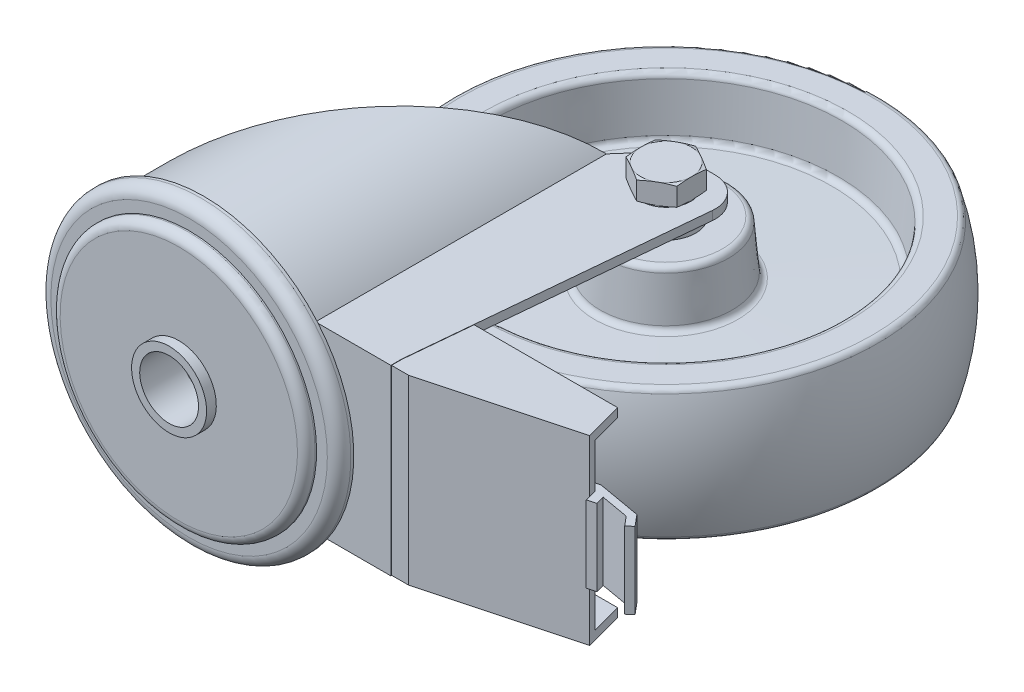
ISO-10303-21;
HEADER;
FILE_DESCRIPTION(('STEP AP214'),'2;1');
FILE_NAME('part.step','',(''),(''),'','','');
FILE_SCHEMA(('AUTOMOTIVE_DESIGN { 1 0 10303 214 1 1 1 1 }'));
ENDSEC;
DATA;
#1=APPLICATION_CONTEXT('core data for automotive mechanical design processes');
#2=APPLICATION_PROTOCOL_DEFINITION('international standard','automotive_design',2000,#1);
#3=PRODUCT_CONTEXT('',#1,'mechanical');
#4=PRODUCT('Part','Part','',(#3));
#5=PRODUCT_RELATED_PRODUCT_CATEGORY('part','',(#4));
#6=PRODUCT_DEFINITION_FORMATION('','',#4);
#7=PRODUCT_DEFINITION_CONTEXT('part definition',#1,'design');
#8=PRODUCT_DEFINITION('design','',#6,#7);
#9=PRODUCT_DEFINITION_SHAPE('','',#8);
#10=(LENGTH_UNIT() NAMED_UNIT(*) SI_UNIT(.MILLI.,.METRE.));
#11=(NAMED_UNIT(*) PLANE_ANGLE_UNIT() SI_UNIT($,.RADIAN.));
#12=(NAMED_UNIT(*) SI_UNIT($,.STERADIAN.) SOLID_ANGLE_UNIT());
#13=UNCERTAINTY_MEASURE_WITH_UNIT(LENGTH_MEASURE(1.E-05),#10,'distance_accuracy_value','');
#14=(GEOMETRIC_REPRESENTATION_CONTEXT(3) GLOBAL_UNCERTAINTY_ASSIGNED_CONTEXT((#13)) GLOBAL_UNIT_ASSIGNED_CONTEXT((#10,
#11,#12)) REPRESENTATION_CONTEXT('',''));
#15=CARTESIAN_POINT('',(0.,0.,0.));
#16=DIRECTION('',(0.,0.,1.));
#17=DIRECTION('',(1.,0.,0.));
#18=AXIS2_PLACEMENT_3D('',#15,#16,#17);
#19=CARTESIAN_POINT('',(36.832662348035,-22.5,-113.));
#20=DIRECTION('',(0.,-1.,0.));
#21=DIRECTION('',(1.,0.,0.));
#22=AXIS2_PLACEMENT_3D('',#19,#20,#21);
#23=PLANE('',#22);
#24=CARTESIAN_POINT('',(56.,-22.5,-113.));
#25=DIRECTION('',(0.,1.,0.));
#26=DIRECTION('',(-1.,0.,0.));
#27=AXIS2_PLACEMENT_3D('',#24,#25,#26);
#28=CIRCLE('',#27,10.);
#29=CARTESIAN_POINT('',(46.,-22.5,-113.));
#30=VERTEX_POINT('',#29);
#31=EDGE_CURVE('E9',#30,#30,#28,.T.);
#32=ORIENTED_EDGE('',*,*,#31,.T.);
#33=EDGE_LOOP('',(#32));
#34=FACE_BOUND('',#33,.T.);
#35=CARTESIAN_POINT('',(56.,-22.5,-113.));
#36=DIRECTION('',(0.,1.,0.));
#37=DIRECTION('',(-1.,0.,0.));
#38=AXIS2_PLACEMENT_3D('',#35,#36,#37);
#39=CIRCLE('',#38,19.167337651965);
#40=CARTESIAN_POINT('',(36.832662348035,-22.5,-113.));
#41=VERTEX_POINT('',#40);
#42=EDGE_CURVE('E3399',#41,#41,#39,.T.);
#43=ORIENTED_EDGE('',*,*,#42,.F.);
#44=EDGE_LOOP('',(#43));
#45=FACE_BOUND('',#44,.T.);
#46=ADVANCED_FACE('F15',(#34,#45),#23,.T.);
#47=CARTESIAN_POINT('',(46.,22.5,-113.));
#48=DIRECTION('',(0.,1.,0.));
#49=DIRECTION('',(-1.,0.,0.));
#50=AXIS2_PLACEMENT_3D('',#47,#48,#49);
#51=PLANE('',#50);
#52=CARTESIAN_POINT('',(56.,22.5,-113.));
#53=DIRECTION('',(0.,1.,0.));
#54=DIRECTION('',(-1.,0.,0.));
#55=AXIS2_PLACEMENT_3D('',#52,#53,#54);
#56=CIRCLE('',#55,19.167337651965);
#57=CARTESIAN_POINT('',(36.832662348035,22.5,-113.));
#58=VERTEX_POINT('',#57);
#59=EDGE_CURVE('E3444',#58,#58,#56,.T.);
#60=ORIENTED_EDGE('',*,*,#59,.T.);
#61=EDGE_LOOP('',(#60));
#62=FACE_BOUND('',#61,.T.);
#63=CARTESIAN_POINT('',(56.,22.5,-113.));
#64=DIRECTION('',(0.,1.,0.));
#65=DIRECTION('',(-1.,0.,0.));
#66=AXIS2_PLACEMENT_3D('',#63,#64,#65);
#67=CIRCLE('',#66,10.);
#68=CARTESIAN_POINT('',(46.,22.5,-113.));
#69=VERTEX_POINT('',#68);
#70=EDGE_CURVE('E25',#69,#69,#67,.T.);
#71=ORIENTED_EDGE('',*,*,#70,.F.);
#72=EDGE_LOOP('',(#71));
#73=FACE_BOUND('',#72,.T.);
#74=ADVANCED_FACE('F2077',(#62,#73),#51,.T.);
#75=CARTESIAN_POINT('',(56.,20.499999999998,-113.));
#76=DIRECTION('',(0.,1.,0.));
#77=DIRECTION('',(-1.,0.,0.));
#78=AXIS2_PLACEMENT_3D('',#75,#76,#77);
#79=TOROIDAL_SURFACE('',#78,19.1673376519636,2.00000000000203);
#80=CARTESIAN_POINT('',(56.,20.674311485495,-113.));
#81=DIRECTION('',(0.,1.,0.));
#82=DIRECTION('',(-1.,0.,0.));
#83=AXIS2_PLACEMENT_3D('',#80,#81,#82);
#84=CIRCLE('',#83,21.159727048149);
#85=CARTESIAN_POINT('',(34.840272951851,20.674311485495,-113.));
#86=VERTEX_POINT('',#85);
#87=EDGE_CURVE('E3441',#86,#86,#84,.T.);
#88=ORIENTED_EDGE('',*,*,#87,.T.);
#89=EDGE_LOOP('',(#88));
#90=FACE_BOUND('',#89,.T.);
#91=ORIENTED_EDGE('',*,*,#59,.F.);
#92=EDGE_LOOP('',(#91));
#93=FACE_BOUND('',#92,.T.);
#94=ADVANCED_FACE('F2088',(#90,#93),#79,.T.);
#95=CARTESIAN_POINT('',(56.,20.674311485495,-113.));
#96=DIRECTION('',(0.,-1.,0.));
#97=DIRECTION('',(1.,0.,0.));
#98=AXIS2_PLACEMENT_3D('',#95,#96,#97);
#99=CONICAL_SURFACE('',#98,21.159727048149,0.0872664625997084);
#100=CARTESIAN_POINT('',(56.,6.0838414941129,-113.));
#101=DIRECTION('',(0.,1.,0.));
#102=DIRECTION('',(-1.,0.,0.));
#103=AXIS2_PLACEMENT_3D('',#100,#101,#102);
#104=CIRCLE('',#103,22.43622776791);
#105=CARTESIAN_POINT('',(33.56377223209,6.0838414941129,-113.));
#106=VERTEX_POINT('',#105);
#107=EDGE_CURVE('E3438',#106,#106,#104,.T.);
#108=ORIENTED_EDGE('',*,*,#107,.T.);
#109=EDGE_LOOP('',(#108));
#110=FACE_BOUND('',#109,.T.);
#111=ORIENTED_EDGE('',*,*,#87,.F.);
#112=EDGE_LOOP('',(#111));
#113=FACE_BOUND('',#112,.T.);
#114=ADVANCED_FACE('F2099',(#110,#113),#99,.T.);
#115=CARTESIAN_POINT('',(56.,6.2581529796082,-113.));
#116=DIRECTION('',(0.,1.,0.));
#117=DIRECTION('',(-1.,0.,0.));
#118=AXIS2_PLACEMENT_3D('',#115,#116,#117);
#119=TOROIDAL_SURFACE('',#118,24.4286171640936,2.00000000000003);
#120=CARTESIAN_POINT('',(56.,4.25937132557,-113.));
#121=DIRECTION('',(0.,1.,0.));
#122=DIRECTION('',(-1.,0.,0.));
#123=AXIS2_PLACEMENT_3D('',#120,#121,#122);
#124=CIRCLE('',#123,24.358818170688);
#125=CARTESIAN_POINT('',(31.641181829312,4.25937132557,-113.));
#126=VERTEX_POINT('',#125);
#127=EDGE_CURVE('E3435',#126,#126,#124,.T.);
#128=ORIENTED_EDGE('',*,*,#127,.T.);
#129=EDGE_LOOP('',(#128));
#130=FACE_BOUND('',#129,.T.);
#131=ORIENTED_EDGE('',*,*,#107,.F.);
#132=EDGE_LOOP('',(#131));
#133=FACE_BOUND('',#132,.T.);
#134=ADVANCED_FACE('F2110',(#130,#133),#119,.F.);
#135=CARTESIAN_POINT('',(56.,4.25937132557,-113.));
#136=DIRECTION('',(0.,-1.,0.));
#137=DIRECTION('',(1.,0.,0.));
#138=AXIS2_PLACEMENT_3D('',#135,#136,#137);
#139=CONICAL_SURFACE('',#138,24.358818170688,1.53588974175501);
#140=CARTESIAN_POINT('',(56.,3.1403400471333,-113.));
#141=DIRECTION('',(0.,1.,0.));
#142=DIRECTION('',(-1.,0.,0.));
#143=AXIS2_PLACEMENT_3D('',#140,#141,#142);
#144=CIRCLE('',#143,56.403681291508);
#145=CARTESIAN_POINT('',(-0.403681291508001,3.1403400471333,-113.));
#146=VERTEX_POINT('',#145);
#147=EDGE_CURVE('E3432',#146,#146,#144,.T.);
#148=ORIENTED_EDGE('',*,*,#147,.T.);
#149=EDGE_LOOP('',(#148));
#150=FACE_BOUND('',#149,.T.);
#151=ORIENTED_EDGE('',*,*,#127,.F.);
#152=EDGE_LOOP('',(#151));
#153=FACE_BOUND('',#152,.T.);
#154=ADVANCED_FACE('F2121',(#150,#153),#139,.T.);
#155=CARTESIAN_POINT('',(56.,5.1391217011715,-113.));
#156=DIRECTION('',(0.,1.,0.));
#157=DIRECTION('',(-1.,0.,0.));
#158=AXIS2_PLACEMENT_3D('',#155,#156,#157);
#159=TOROIDAL_SURFACE('',#158,56.4734802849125,2.);
#160=CARTESIAN_POINT('',(56.,4.9648102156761,-113.));
#161=DIRECTION('',(0.,1.,0.));
#162=DIRECTION('',(-1.,0.,0.));
#163=AXIS2_PLACEMENT_3D('',#160,#161,#162);
#164=CIRCLE('',#163,58.465869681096);
#165=CARTESIAN_POINT('',(-2.46586968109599,4.9648102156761,-113.));
#166=VERTEX_POINT('',#165);
#167=EDGE_CURVE('E3429',#166,#166,#164,.T.);
#168=ORIENTED_EDGE('',*,*,#167,.T.);
#169=EDGE_LOOP('',(#168));
#170=FACE_BOUND('',#169,.T.);
#171=ORIENTED_EDGE('',*,*,#147,.F.);
#172=EDGE_LOOP('',(#171));
#173=FACE_BOUND('',#172,.T.);
#174=ADVANCED_FACE('F2132',(#170,#173),#159,.F.);
#175=CARTESIAN_POINT('',(56.,4.9648102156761,-113.));
#176=DIRECTION('',(0.,1.,0.));
#177=DIRECTION('',(-1.,0.,0.));
#178=AXIS2_PLACEMENT_3D('',#175,#176,#177);
#179=CONICAL_SURFACE('',#178,58.465869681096,0.0872664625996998);
#180=CARTESIAN_POINT('',(56.,20.674311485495,-113.));
#181=DIRECTION('',(0.,1.,0.));
#182=DIRECTION('',(-1.,0.,0.));
#183=AXIS2_PLACEMENT_3D('',#180,#181,#182);
#184=CIRCLE('',#183,59.840272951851);
#185=CARTESIAN_POINT('',(-3.840272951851,20.674311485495,-113.));
#186=VERTEX_POINT('',#185);
#187=EDGE_CURVE('E3426',#186,#186,#184,.T.);
#188=ORIENTED_EDGE('',*,*,#187,.T.);
#189=EDGE_LOOP('',(#188));
#190=FACE_BOUND('',#189,.T.);
#191=ORIENTED_EDGE('',*,*,#167,.F.);
#192=EDGE_LOOP('',(#191));
#193=FACE_BOUND('',#192,.T.);
#194=ADVANCED_FACE('F2143',(#190,#193),#179,.F.);
#195=CARTESIAN_POINT('',(56.,20.499999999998,-113.));
#196=DIRECTION('',(0.,1.,0.));
#197=DIRECTION('',(-1.,0.,0.));
#198=AXIS2_PLACEMENT_3D('',#195,#196,#197);
#199=TOROIDAL_SURFACE('',#198,61.8326623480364,2.00000000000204);
#200=CARTESIAN_POINT('',(56.,22.5,-113.));
#201=DIRECTION('',(0.,1.,0.));
#202=DIRECTION('',(-1.,0.,0.));
#203=AXIS2_PLACEMENT_3D('',#200,#201,#202);
#204=CIRCLE('',#203,61.832662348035);
#205=CARTESIAN_POINT('',(-5.832662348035,22.5,-113.));
#206=VERTEX_POINT('',#205);
#207=EDGE_CURVE('E3423',#206,#206,#204,.T.);
#208=ORIENTED_EDGE('',*,*,#207,.T.);
#209=EDGE_LOOP('',(#208));
#210=FACE_BOUND('',#209,.T.);
#211=ORIENTED_EDGE('',*,*,#187,.F.);
#212=EDGE_LOOP('',(#211));
#213=FACE_BOUND('',#212,.T.);
#214=ADVANCED_FACE('F2154',(#210,#213),#199,.T.);
#215=CARTESIAN_POINT('',(-5.832662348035,22.5,-113.));
#216=DIRECTION('',(0.,1.,0.));
#217=DIRECTION('',(-1.,0.,0.));
#218=AXIS2_PLACEMENT_3D('',#215,#216,#217);
#219=PLANE('',#218);
#220=CARTESIAN_POINT('',(56.,22.5,-113.));
#221=DIRECTION('',(0.,1.,0.));
#222=DIRECTION('',(-1.,0.,0.));
#223=AXIS2_PLACEMENT_3D('',#220,#221,#222);
#224=CIRCLE('',#223,70.062472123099);
#225=CARTESIAN_POINT('',(-14.062472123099,22.5,-113.));
#226=VERTEX_POINT('',#225);
#227=EDGE_CURVE('E3394',#226,#226,#224,.T.);
#228=ORIENTED_EDGE('',*,*,#227,.T.);
#229=EDGE_LOOP('',(#228));
#230=FACE_BOUND('',#229,.T.);
#231=ORIENTED_EDGE('',*,*,#207,.F.);
#232=EDGE_LOOP('',(#231));
#233=FACE_BOUND('',#232,.T.);
#234=ADVANCED_FACE('F2165',(#230,#233),#219,.T.);
#235=CARTESIAN_POINT('',(-13.,-22.5,-113.));
#236=DIRECTION('',(0.,-1.,0.));
#237=DIRECTION('',(1.,0.,0.));
#238=AXIS2_PLACEMENT_3D('',#235,#236,#237);
#239=PLANE('',#238);
#240=CARTESIAN_POINT('',(56.,-22.5,-113.));
#241=DIRECTION('',(0.,1.,0.));
#242=DIRECTION('',(-1.,0.,0.));
#243=AXIS2_PLACEMENT_3D('',#240,#241,#242);
#244=CIRCLE('',#243,61.832662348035);
#245=CARTESIAN_POINT('',(-5.832662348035,-22.5,-113.));
#246=VERTEX_POINT('',#245);
#247=EDGE_CURVE('E3420',#246,#246,#244,.T.);
#248=ORIENTED_EDGE('',*,*,#247,.T.);
#249=EDGE_LOOP('',(#248));
#250=FACE_BOUND('',#249,.T.);
#251=CARTESIAN_POINT('',(56.,-22.5,-113.));
#252=DIRECTION('',(0.,1.,0.));
#253=DIRECTION('',(-1.,0.,0.));
#254=AXIS2_PLACEMENT_3D('',#251,#252,#253);
#255=CIRCLE('',#254,70.062472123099);
#256=CARTESIAN_POINT('',(-14.062472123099,-22.5,-113.));
#257=VERTEX_POINT('',#256);
#258=EDGE_CURVE('E865',#257,#257,#255,.T.);
#259=ORIENTED_EDGE('',*,*,#258,.F.);
#260=EDGE_LOOP('',(#259));
#261=FACE_BOUND('',#260,.T.);
#262=ADVANCED_FACE('F2176',(#250,#261),#239,.T.);
#263=CARTESIAN_POINT('',(56.,-20.499999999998,-113.));
#264=DIRECTION('',(0.,1.,0.));
#265=DIRECTION('',(-1.,0.,0.));
#266=AXIS2_PLACEMENT_3D('',#263,#264,#265);
#267=TOROIDAL_SURFACE('',#266,61.8326623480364,2.00000000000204);
#268=CARTESIAN_POINT('',(56.,-20.674311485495,-113.));
#269=DIRECTION('',(0.,1.,0.));
#270=DIRECTION('',(-1.,0.,0.));
#271=AXIS2_PLACEMENT_3D('',#268,#269,#270);
#272=CIRCLE('',#271,59.840272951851);
#273=CARTESIAN_POINT('',(-3.840272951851,-20.674311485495,-113.));
#274=VERTEX_POINT('',#273);
#275=EDGE_CURVE('E3417',#274,#274,#272,.T.);
#276=ORIENTED_EDGE('',*,*,#275,.T.);
#277=EDGE_LOOP('',(#276));
#278=FACE_BOUND('',#277,.T.);
#279=ORIENTED_EDGE('',*,*,#247,.F.);
#280=EDGE_LOOP('',(#279));
#281=FACE_BOUND('',#280,.T.);
#282=ADVANCED_FACE('F2187',(#278,#281),#267,.T.);
#283=CARTESIAN_POINT('',(56.,-20.674311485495,-113.));
#284=DIRECTION('',(0.,-1.,0.));
#285=DIRECTION('',(1.,0.,0.));
#286=AXIS2_PLACEMENT_3D('',#283,#284,#285);
#287=CONICAL_SURFACE('',#286,59.840272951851,0.0872664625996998);
#288=CARTESIAN_POINT('',(56.,-4.9648102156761,-113.));
#289=DIRECTION('',(0.,1.,0.));
#290=DIRECTION('',(-1.,0.,0.));
#291=AXIS2_PLACEMENT_3D('',#288,#289,#290);
#292=CIRCLE('',#291,58.465869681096);
#293=CARTESIAN_POINT('',(-2.46586968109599,-4.9648102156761,-113.));
#294=VERTEX_POINT('',#293);
#295=EDGE_CURVE('E3414',#294,#294,#292,.T.);
#296=ORIENTED_EDGE('',*,*,#295,.T.);
#297=EDGE_LOOP('',(#296));
#298=FACE_BOUND('',#297,.T.);
#299=ORIENTED_EDGE('',*,*,#275,.F.);
#300=EDGE_LOOP('',(#299));
#301=FACE_BOUND('',#300,.T.);
#302=ADVANCED_FACE('F2198',(#298,#301),#287,.F.);
#303=CARTESIAN_POINT('',(56.,-5.1391217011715,-113.));
#304=DIRECTION('',(0.,1.,0.));
#305=DIRECTION('',(-1.,0.,0.));
#306=AXIS2_PLACEMENT_3D('',#303,#304,#305);
#307=TOROIDAL_SURFACE('',#306,56.4734802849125,2.);
#308=CARTESIAN_POINT('',(56.,-3.1403400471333,-113.));
#309=DIRECTION('',(0.,1.,0.));
#310=DIRECTION('',(-1.,0.,0.));
#311=AXIS2_PLACEMENT_3D('',#308,#309,#310);
#312=CIRCLE('',#311,56.403681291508);
#313=CARTESIAN_POINT('',(-0.403681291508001,-3.1403400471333,-113.));
#314=VERTEX_POINT('',#313);
#315=EDGE_CURVE('E3411',#314,#314,#312,.T.);
#316=ORIENTED_EDGE('',*,*,#315,.T.);
#317=EDGE_LOOP('',(#316));
#318=FACE_BOUND('',#317,.T.);
#319=ORIENTED_EDGE('',*,*,#295,.F.);
#320=EDGE_LOOP('',(#319));
#321=FACE_BOUND('',#320,.T.);
#322=ADVANCED_FACE('F2209',(#318,#321),#307,.F.);
#323=CARTESIAN_POINT('',(56.,-3.1403400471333,-113.));
#324=DIRECTION('',(0.,1.,0.));
#325=DIRECTION('',(-1.,0.,0.));
#326=AXIS2_PLACEMENT_3D('',#323,#324,#325);
#327=CONICAL_SURFACE('',#326,56.403681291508,1.53588974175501);
#328=CARTESIAN_POINT('',(56.,-4.25937132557,-113.));
#329=DIRECTION('',(0.,1.,0.));
#330=DIRECTION('',(-1.,0.,0.));
#331=AXIS2_PLACEMENT_3D('',#328,#329,#330);
#332=CIRCLE('',#331,24.358818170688);
#333=CARTESIAN_POINT('',(31.641181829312,-4.25937132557,-113.));
#334=VERTEX_POINT('',#333);
#335=EDGE_CURVE('E3408',#334,#334,#332,.T.);
#336=ORIENTED_EDGE('',*,*,#335,.T.);
#337=EDGE_LOOP('',(#336));
#338=FACE_BOUND('',#337,.T.);
#339=ORIENTED_EDGE('',*,*,#315,.F.);
#340=EDGE_LOOP('',(#339));
#341=FACE_BOUND('',#340,.T.);
#342=ADVANCED_FACE('F2220',(#338,#341),#327,.T.);
#343=CARTESIAN_POINT('',(56.,-6.2581529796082,-113.));
#344=DIRECTION('',(0.,1.,0.));
#345=DIRECTION('',(-1.,0.,0.));
#346=AXIS2_PLACEMENT_3D('',#343,#344,#345);
#347=TOROIDAL_SURFACE('',#346,24.4286171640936,2.00000000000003);
#348=CARTESIAN_POINT('',(56.,-6.0838414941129,-113.));
#349=DIRECTION('',(0.,1.,0.));
#350=DIRECTION('',(-1.,0.,0.));
#351=AXIS2_PLACEMENT_3D('',#348,#349,#350);
#352=CIRCLE('',#351,22.43622776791);
#353=CARTESIAN_POINT('',(33.56377223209,-6.0838414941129,-113.));
#354=VERTEX_POINT('',#353);
#355=EDGE_CURVE('E3405',#354,#354,#352,.T.);
#356=ORIENTED_EDGE('',*,*,#355,.T.);
#357=EDGE_LOOP('',(#356));
#358=FACE_BOUND('',#357,.T.);
#359=ORIENTED_EDGE('',*,*,#335,.F.);
#360=EDGE_LOOP('',(#359));
#361=FACE_BOUND('',#360,.T.);
#362=ADVANCED_FACE('F2231',(#358,#361),#347,.F.);
#363=CARTESIAN_POINT('',(56.,-6.0838414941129,-113.));
#364=DIRECTION('',(0.,1.,0.));
#365=DIRECTION('',(-1.,0.,0.));
#366=AXIS2_PLACEMENT_3D('',#363,#364,#365);
#367=CONICAL_SURFACE('',#366,22.43622776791,0.0872664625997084);
#368=CARTESIAN_POINT('',(56.,-20.674311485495,-113.));
#369=DIRECTION('',(0.,1.,0.));
#370=DIRECTION('',(-1.,0.,0.));
#371=AXIS2_PLACEMENT_3D('',#368,#369,#370);
#372=CIRCLE('',#371,21.159727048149);
#373=CARTESIAN_POINT('',(34.840272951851,-20.674311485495,-113.));
#374=VERTEX_POINT('',#373);
#375=EDGE_CURVE('E3402',#374,#374,#372,.T.);
#376=ORIENTED_EDGE('',*,*,#375,.T.);
#377=EDGE_LOOP('',(#376));
#378=FACE_BOUND('',#377,.T.);
#379=ORIENTED_EDGE('',*,*,#355,.F.);
#380=EDGE_LOOP('',(#379));
#381=FACE_BOUND('',#380,.T.);
#382=ADVANCED_FACE('F2242',(#378,#381),#367,.T.);
#383=CARTESIAN_POINT('',(56.,-20.499999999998,-113.));
#384=DIRECTION('',(0.,1.,0.));
#385=DIRECTION('',(-1.,0.,0.));
#386=AXIS2_PLACEMENT_3D('',#383,#384,#385);
#387=TOROIDAL_SURFACE('',#386,19.1673376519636,2.00000000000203);
#388=ORIENTED_EDGE('',*,*,#42,.T.);
#389=EDGE_LOOP('',(#388));
#390=FACE_BOUND('',#389,.T.);
#391=ORIENTED_EDGE('',*,*,#375,.F.);
#392=EDGE_LOOP('',(#391));
#393=FACE_BOUND('',#392,.T.);
#394=ADVANCED_FACE('F2253',(#390,#393),#387,.T.);
#395=CARTESIAN_POINT('',(56.,20.5000000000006,-113.));
#396=DIRECTION('',(0.,1.,0.));
#397=DIRECTION('',(-1.,0.,0.));
#398=AXIS2_PLACEMENT_3D('',#395,#396,#397);
#399=TOROIDAL_SURFACE('',#398,70.0624721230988,1.99999999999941);
#400=CARTESIAN_POINT('',(56.,21.061643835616,-113.));
#401=DIRECTION('',(0.,1.,0.));
#402=DIRECTION('',(-1.,0.,0.));
#403=AXIS2_PLACEMENT_3D('',#400,#401,#402);
#404=CIRCLE('',#403,71.981991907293);
#405=CARTESIAN_POINT('',(-15.981991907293,21.061643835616,-113.));
#406=VERTEX_POINT('',#405);
#407=EDGE_CURVE('E3391',#406,#406,#404,.T.);
#408=ORIENTED_EDGE('',*,*,#407,.T.);
#409=EDGE_LOOP('',(#408));
#410=FACE_BOUND('',#409,.T.);
#411=ORIENTED_EDGE('',*,*,#227,.F.);
#412=EDGE_LOOP('',(#411));
#413=FACE_BOUND('',#412,.T.);
#414=ADVANCED_FACE('F2264',(#410,#413),#399,.T.);
#415=CARTESIAN_POINT('',(55.9999999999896,0.,-113.));
#416=DIRECTION('',(0.,1.,0.));
#417=DIRECTION('',(-1.,0.,0.));
#418=AXIS2_PLACEMENT_3D('',#415,#416,#417);
#419=SPHERICAL_SURFACE('',#418,74.9999999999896);
#420=CARTESIAN_POINT('',(56.,-21.061643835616,-113.));
#421=DIRECTION('',(0.,1.,0.));
#422=DIRECTION('',(-1.,0.,0.));
#423=AXIS2_PLACEMENT_3D('',#420,#421,#422);
#424=CIRCLE('',#423,71.981991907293);
#425=CARTESIAN_POINT('',(-15.981991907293,-21.061643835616,-113.));
#426=VERTEX_POINT('',#425);
#427=EDGE_CURVE('E868',#426,#426,#424,.T.);
#428=CARTESIAN_POINT('',(-15.981991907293,-21.061643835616,-113.));
#429=CARTESIAN_POINT('',(-16.1068924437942,-20.6347751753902,-113.));
#430=CARTESIAN_POINT('',(-16.2279949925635,-20.2067952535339,-113.));
#431=CARTESIAN_POINT('',(-16.4625676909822,-19.3487488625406,-113.));
#432=CARTESIAN_POINT('',(-16.5760378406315,-18.9186823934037,-113.));
#433=CARTESIAN_POINT('',(-16.7953093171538,-18.0565988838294,-113.));
#434=CARTESIAN_POINT('',(-16.9011106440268,-17.624581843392,-113.));
#435=CARTESIAN_POINT('',(-17.1050111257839,-16.7587339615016,-113.));
#436=CARTESIAN_POINT('',(-17.2031102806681,-16.3249031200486,-113.));
#437=CARTESIAN_POINT('',(-17.391575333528,-15.4555649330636,-113.));
#438=CARTESIAN_POINT('',(-17.4819412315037,-15.0200575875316,-113.));
#439=CARTESIAN_POINT('',(-17.6549111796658,-14.1475042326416,-113.));
#440=CARTESIAN_POINT('',(-17.7375152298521,-13.7104582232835,-113.));
#441=CARTESIAN_POINT('',(-17.8949353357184,-12.8349658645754,-113.));
#442=CARTESIAN_POINT('',(-17.9697513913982,-12.3965195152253,-113.));
#443=CARTESIAN_POINT('',(-18.1115718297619,-11.5183652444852,-113.));
#444=CARTESIAN_POINT('',(-18.1785762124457,-11.0786573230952,-113.));
#445=CARTESIAN_POINT('',(-18.3047520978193,-10.198119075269,-113.));
#446=CARTESIAN_POINT('',(-18.3639236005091,-9.75728874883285,-113.));
#447=CARTESIAN_POINT('',(-18.4744149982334,-8.87464521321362,-113.));
#448=CARTESIAN_POINT('',(-18.5257348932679,-8.43283200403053,-113.));
#449=CARTESIAN_POINT('',(-18.6205068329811,-7.54836253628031,-113.));
#450=CARTESIAN_POINT('',(-18.6639588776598,-7.10570627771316,-113.));
#451=CARTESIAN_POINT('',(-18.7429813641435,-6.21969081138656,-113.));
#452=CARTESIAN_POINT('',(-18.7785518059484,-5.77633160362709,-113.));
#453=CARTESIAN_POINT('',(-18.8417998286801,-4.88905056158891,-113.));
#454=CARTESIAN_POINT('',(-18.8694774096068,-4.44512872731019,-113.));
#455=CARTESIAN_POINT('',(-18.9169309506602,-3.55686293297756,-113.));
#456=CARTESIAN_POINT('',(-18.9367069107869,-3.11251897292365,-113.));
#457=CARTESIAN_POINT('',(-18.9683509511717,-2.2235495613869,-113.));
#458=CARTESIAN_POINT('',(-18.9802190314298,-1.77892410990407,-113.));
#459=CARTESIAN_POINT('',(-18.996043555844,-0.889532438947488,-113.));
#460=CARTESIAN_POINT('',(-19.,-0.444766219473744,-113.));
#461=CARTESIAN_POINT('',(-19.,0.444766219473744,-113.));
#462=CARTESIAN_POINT('',(-18.996043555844,0.889532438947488,-113.));
#463=CARTESIAN_POINT('',(-18.9802190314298,1.77892410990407,-113.));
#464=CARTESIAN_POINT('',(-18.9683509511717,2.2235495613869,-113.));
#465=CARTESIAN_POINT('',(-18.9367069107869,3.11251897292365,-113.));
#466=CARTESIAN_POINT('',(-18.9169309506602,3.55686293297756,-113.));
#467=CARTESIAN_POINT('',(-18.8694774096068,4.44512872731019,-113.));
#468=CARTESIAN_POINT('',(-18.8417998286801,4.88905056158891,-113.));
#469=CARTESIAN_POINT('',(-18.7785518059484,5.77633160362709,-113.));
#470=CARTESIAN_POINT('',(-18.7429813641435,6.21969081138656,-113.));
#471=CARTESIAN_POINT('',(-18.6639588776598,7.10570627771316,-113.));
#472=CARTESIAN_POINT('',(-18.6205068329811,7.54836253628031,-113.));
#473=CARTESIAN_POINT('',(-18.5257348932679,8.43283200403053,-113.));
#474=CARTESIAN_POINT('',(-18.4744149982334,8.87464521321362,-113.));
#475=CARTESIAN_POINT('',(-18.3639236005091,9.75728874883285,-113.));
#476=CARTESIAN_POINT('',(-18.3047520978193,10.198119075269,-113.));
#477=CARTESIAN_POINT('',(-18.1785762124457,11.0786573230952,-113.));
#478=CARTESIAN_POINT('',(-18.1115718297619,11.5183652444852,-113.));
#479=CARTESIAN_POINT('',(-17.9697513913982,12.3965195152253,-113.));
#480=CARTESIAN_POINT('',(-17.8949353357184,12.8349658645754,-113.));
#481=CARTESIAN_POINT('',(-17.7375152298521,13.7104582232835,-113.));
#482=CARTESIAN_POINT('',(-17.6549111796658,14.1475042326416,-113.));
#483=CARTESIAN_POINT('',(-17.4819412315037,15.0200575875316,-113.));
#484=CARTESIAN_POINT('',(-17.391575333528,15.4555649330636,-113.));
#485=CARTESIAN_POINT('',(-17.2031102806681,16.3249031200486,-113.));
#486=CARTESIAN_POINT('',(-17.1050111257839,16.7587339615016,-113.));
#487=CARTESIAN_POINT('',(-16.9011106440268,17.624581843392,-113.));
#488=CARTESIAN_POINT('',(-16.7953093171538,18.0565988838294,-113.));
#489=CARTESIAN_POINT('',(-16.5760378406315,18.9186823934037,-113.));
#490=CARTESIAN_POINT('',(-16.4625676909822,19.3487488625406,-113.));
#491=CARTESIAN_POINT('',(-16.2279949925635,20.2067952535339,-113.));
#492=CARTESIAN_POINT('',(-16.1068924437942,20.6347751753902,-113.));
#493=CARTESIAN_POINT('',(-15.981991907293,21.061643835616,-113.));
#494=B_SPLINE_CURVE_WITH_KNOTS('',3,(#428,#429,#430,#431,#432,#433,#434,#435,#436,#437,#438,
#439,#440,#441,#442,#443,#444,#445,#446,#447,#448,#449,#450,#451,#452,#453,#454,#455,#456,#457,
#458,#459,#460,#461,#462,#463,#464,#465,#466,#467,#468,#469,#470,#471,#472,#473,#474,#475,#476,
#477,#478,#479,#480,#481,#482,#483,#484,#485,#486,#487,#488,#489,#490,#491,#492,#493),
.UNSPECIFIED.,.F.,.F.,(4,2,2,2,2,2,2,2,2,2,2,2,2,2,2,2,2,2,2,2,2,2,2,2,2,2,2,2,2,2,2,2,4),(0.,
1.33428106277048,2.66856212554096,4.00284318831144,5.33712425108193,6.67140531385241,
8.00568637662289,9.33996743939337,10.6742485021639,12.0085295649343,13.3428106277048,
14.6770916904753,16.0113727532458,17.3456538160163,18.6799348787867,20.0142159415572,
21.3484970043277,22.6827780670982,24.0170591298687,25.3513401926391,26.6856212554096,
28.0199023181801,29.3541833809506,30.6884644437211,32.0227455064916,33.357026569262,
34.6913076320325,36.025588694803,37.3598697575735,38.694150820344,40.0284318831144,
41.3627129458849,42.6969940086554),.UNSPECIFIED.);
#495=EDGE_CURVE('BSEAM2275',#426,#406,#494,.T.);
#496=ORIENTED_EDGE('',*,*,#427,.T.);
#497=ORIENTED_EDGE('',*,*,#407,.F.);
#498=ORIENTED_EDGE('',*,*,#495,.T.);
#499=ORIENTED_EDGE('',*,*,#495,.F.);
#500=EDGE_LOOP('',(#496,#498,#497,#499));
#501=FACE_BOUND('',#500,.T.);
#502=ADVANCED_FACE('F2275',(#501),#419,.T.);
#503=CARTESIAN_POINT('',(56.,-20.5000000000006,-113.));
#504=DIRECTION('',(0.,1.,0.));
#505=DIRECTION('',(-1.,0.,0.));
#506=AXIS2_PLACEMENT_3D('',#503,#504,#505);
#507=TOROIDAL_SURFACE('',#506,70.0624721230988,1.99999999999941);
#508=ORIENTED_EDGE('',*,*,#258,.T.);
#509=EDGE_LOOP('',(#508));
#510=FACE_BOUND('',#509,.T.);
#511=ORIENTED_EDGE('',*,*,#427,.F.);
#512=EDGE_LOOP('',(#511));
#513=FACE_BOUND('',#512,.T.);
#514=ADVANCED_FACE('F1306',(#510,#513),#507,.T.);
#515=CARTESIAN_POINT('',(56.,-45.,-117.9265));
#516=DIRECTION('',(0.,-1.,0.));
#517=DIRECTION('',(-1.,0.,0.));
#518=AXIS2_PLACEMENT_3D('',#515,#516,#517);
#519=PLANE('',#518);
#520=CARTESIAN_POINT('',(56.,-45.,-113.));
#521=DIRECTION('',(0.,1.,0.));
#522=DIRECTION('',(1.,0.,0.));
#523=AXIS2_PLACEMENT_3D('',#520,#521,#522);
#524=CIRCLE('',#523,4.9265);
#525=CARTESIAN_POINT('',(60.9265,-45.,-113.));
#526=VERTEX_POINT('',#525);
#527=EDGE_CURVE('E3348',#526,#526,#524,.T.);
#528=ORIENTED_EDGE('',*,*,#527,.F.);
#529=EDGE_LOOP('',(#528));
#530=FACE_BOUND('',#529,.T.);
#531=ADVANCED_FACE('F612',(#530),#519,.T.);
#532=CARTESIAN_POINT('',(56.,-43.9265,-113.));
#533=DIRECTION('',(0.,1.,0.));
#534=DIRECTION('',(1.,0.,0.));
#535=AXIS2_PLACEMENT_3D('',#532,#533,#534);
#536=CONICAL_SURFACE('',#535,6.,0.785398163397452);
#537=ORIENTED_EDGE('',*,*,#527,.T.);
#538=EDGE_LOOP('',(#537));
#539=FACE_BOUND('',#538,.T.);
#540=CARTESIAN_POINT('',(56.,-43.9265,-113.));
#541=DIRECTION('',(0.,1.,0.));
#542=DIRECTION('',(1.,0.,0.));
#543=AXIS2_PLACEMENT_3D('',#540,#541,#542);
#544=CIRCLE('',#543,6.);
#545=CARTESIAN_POINT('',(62.,-43.9265,-113.));
#546=VERTEX_POINT('',#545);
#547=EDGE_CURVE('E3356',#546,#546,#544,.T.);
#548=ORIENTED_EDGE('',*,*,#547,.F.);
#549=EDGE_LOOP('',(#548));
#550=FACE_BOUND('',#549,.T.);
#551=ADVANCED_FACE('F1305',(#539,#550),#536,.T.);
#552=CARTESIAN_POINT('',(56.,-45.,-113.));
#553=DIRECTION('',(0.,1.,0.));
#554=DIRECTION('',(1.,0.,0.));
#555=AXIS2_PLACEMENT_3D('',#552,#553,#554);
#556=CYLINDRICAL_SURFACE('',#555,6.);
#557=ORIENTED_EDGE('',*,*,#547,.T.);
#558=EDGE_LOOP('',(#557));
#559=FACE_BOUND('',#558,.T.);
#560=CARTESIAN_POINT('',(56.,-43.,-113.));
#561=DIRECTION('',(0.,1.,0.));
#562=DIRECTION('',(1.,0.,0.));
#563=AXIS2_PLACEMENT_3D('',#560,#561,#562);
#564=CIRCLE('',#563,6.);
#565=CARTESIAN_POINT('',(62.,-43.,-113.));
#566=VERTEX_POINT('',#565);
#567=EDGE_CURVE('E1189',#566,#566,#564,.T.);
#568=ORIENTED_EDGE('',*,*,#567,.F.);
#569=EDGE_LOOP('',(#568));
#570=FACE_BOUND('',#569,.T.);
#571=ADVANCED_FACE('F1310',(#559,#570),#556,.T.);
#572=CARTESIAN_POINT('',(56.,38.5,-113.));
#573=DIRECTION('',(0.,1.,0.));
#574=DIRECTION('',(1.,0.,0.));
#575=AXIS2_PLACEMENT_3D('',#572,#573,#574);
#576=PLANE('',#575);
#577=CARTESIAN_POINT('',(56.,38.5,-113.));
#578=DIRECTION('',(0.,1.,0.));
#579=DIRECTION('',(1.,0.,0.));
#580=AXIS2_PLACEMENT_3D('',#577,#578,#579);
#581=CIRCLE('',#580,8.6625);
#582=CARTESIAN_POINT('',(64.6625,38.5,-113.));
#583=VERTEX_POINT('',#582);
#584=CARTESIAN_POINT('',(60.33125,38.5,-120.501945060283));
#585=VERTEX_POINT('',#584);
#586=EDGE_CURVE('E443',#583,#585,#581,.T.);
#587=ORIENTED_EDGE('',*,*,#586,.T.);
#588=CARTESIAN_POINT('',(51.66875,38.5,-120.501945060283));
#589=VERTEX_POINT('',#588);
#590=EDGE_CURVE('E453',#585,#589,#581,.T.);
#591=ORIENTED_EDGE('',*,*,#590,.T.);
#592=CARTESIAN_POINT('',(47.3375,38.5,-113.));
#593=VERTEX_POINT('',#592);
#594=EDGE_CURVE('E457',#589,#593,#581,.T.);
#595=ORIENTED_EDGE('',*,*,#594,.T.);
#596=CARTESIAN_POINT('',(51.66875,38.5,-105.498054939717));
#597=VERTEX_POINT('',#596);
#598=EDGE_CURVE('E3371',#593,#597,#581,.T.);
#599=ORIENTED_EDGE('',*,*,#598,.T.);
#600=CARTESIAN_POINT('',(60.33125,38.5,-105.498054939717));
#601=VERTEX_POINT('',#600);
#602=EDGE_CURVE('E446',#597,#601,#581,.T.);
#603=ORIENTED_EDGE('',*,*,#602,.T.);
#604=EDGE_CURVE('E435',#601,#583,#581,.T.);
#605=ORIENTED_EDGE('',*,*,#604,.T.);
#606=EDGE_LOOP('',(#587,#591,#595,#599,#603,#605));
#607=FACE_BOUND('',#606,.T.);
#608=ADVANCED_FACE('F441',(#607),#576,.T.);
#609=CARTESIAN_POINT('',(56.,-43.,-119.));
#610=DIRECTION('',(0.,1.,0.));
#611=DIRECTION('',(1.,0.,0.));
#612=AXIS2_PLACEMENT_3D('',#609,#610,#611);
#613=PLANE('',#612);
#614=CARTESIAN_POINT('',(56.,-43.,-113.));
#615=DIRECTION('',(0.,1.,0.));
#616=DIRECTION('',(1.,0.,0.));
#617=AXIS2_PLACEMENT_3D('',#614,#615,#616);
#618=CIRCLE('',#617,8.315);
#619=CARTESIAN_POINT('',(64.315,-43.,-113.));
#620=VERTEX_POINT('',#619);
#621=EDGE_CURVE('E858',#620,#620,#618,.T.);
#622=ORIENTED_EDGE('',*,*,#621,.F.);
#623=EDGE_LOOP('',(#622));
#624=FACE_BOUND('',#623,.T.);
#625=ORIENTED_EDGE('',*,*,#567,.T.);
#626=EDGE_LOOP('',(#625));
#627=FACE_BOUND('',#626,.T.);
#628=ADVANCED_FACE('F569',(#624,#627),#613,.F.);
#629=CARTESIAN_POINT('',(56.,38.5,-113.));
#630=DIRECTION('',(0.,-1.,0.));
#631=DIRECTION('',(-1.,0.,0.));
#632=AXIS2_PLACEMENT_3D('',#629,#630,#631);
#633=CONICAL_SURFACE('',#632,8.6625,1.30899693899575);
#634=CARTESIAN_POINT('',(47.3375,36.5837908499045,-99.769723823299));
#635=CARTESIAN_POINT('',(47.3375,36.6718654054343,-100.162716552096));
#636=CARTESIAN_POINT('',(47.3375,36.7588628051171,-100.555955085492));
#637=CARTESIAN_POINT('',(47.3375,36.9301218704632,-101.343044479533));
#638=CARTESIAN_POINT('',(47.3375,37.0143834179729,-101.736895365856));
#639=CARTESIAN_POINT('',(47.3375,37.1796626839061,-102.52568299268));
#640=CARTESIAN_POINT('',(47.3375,37.2606771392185,-102.920620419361));
#641=CARTESIAN_POINT('',(47.3375,37.4185877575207,-103.711317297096));
#642=CARTESIAN_POINT('',(47.3375,37.495483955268,-104.107076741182));
#643=CARTESIAN_POINT('',(47.3375,37.6435847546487,-104.896404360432));
#644=CARTESIAN_POINT('',(47.3375,37.7148297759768,-105.289964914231));
#645=CARTESIAN_POINT('',(47.3375,37.851099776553,-106.078159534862));
#646=CARTESIAN_POINT('',(47.3375,37.9161248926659,-106.472793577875));
#647=CARTESIAN_POINT('',(47.3375,38.0384909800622,-107.263211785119));
#648=CARTESIAN_POINT('',(47.3375,38.0958328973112,-107.658995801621));
#649=CARTESIAN_POINT('',(47.3375,38.2011428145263,-108.451823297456));
#650=CARTESIAN_POINT('',(47.3375,38.2491108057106,-108.848866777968));
#651=CARTESIAN_POINT('',(47.3375,38.3343145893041,-109.648692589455));
#652=CARTESIAN_POINT('',(47.3375,38.3714220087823,-110.051488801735));
#653=CARTESIAN_POINT('',(47.3375,38.4323447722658,-110.858093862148));
#654=CARTESIAN_POINT('',(47.3375,38.4561604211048,-111.261902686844));
#655=CARTESIAN_POINT('',(47.3375,38.4891106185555,-112.069947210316));
#656=CARTESIAN_POINT('',(47.3375,38.4982518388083,-112.474182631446));
#657=CARTESIAN_POINT('',(47.3375,38.5012911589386,-113.282711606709));
#658=CARTESIAN_POINT('',(47.3375,38.4951892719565,-113.687005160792));
#659=CARTESIAN_POINT('',(47.3375,38.468085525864,-114.496553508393));
#660=CARTESIAN_POINT('',(47.3375,38.4470295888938,-114.901806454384));
#661=CARTESIAN_POINT('',(47.3375,38.3912196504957,-115.711359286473));
#662=CARTESIAN_POINT('',(47.3375,38.3564653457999,-116.115659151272));
#663=CARTESIAN_POINT('',(47.3375,38.2750142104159,-116.9233024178));
#664=CARTESIAN_POINT('',(47.3375,38.2283095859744,-117.326645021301));
#665=CARTESIAN_POINT('',(47.3375,38.1249012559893,-118.13203217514));
#666=CARTESIAN_POINT('',(47.3375,38.068197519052,-118.5340767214));
#667=CARTESIAN_POINT('',(47.3375,37.9506304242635,-119.310329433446));
#668=CARTESIAN_POINT('',(47.3375,37.8902912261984,-119.684617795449));
#669=CARTESIAN_POINT('',(47.3375,37.7637562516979,-120.432208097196));
#670=CARTESIAN_POINT('',(47.3375,37.697560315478,-120.805510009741));
#671=CARTESIAN_POINT('',(47.3375,37.5603817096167,-121.551263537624));
#672=CARTESIAN_POINT('',(47.3375,37.4893986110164,-121.923715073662));
#673=CARTESIAN_POINT('',(47.3375,37.3435257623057,-122.667854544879));
#674=CARTESIAN_POINT('',(47.3375,37.2686359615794,-123.039542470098));
#675=CARTESIAN_POINT('',(47.3375,37.1156395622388,-123.782341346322));
#676=CARTESIAN_POINT('',(47.3375,37.0375322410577,-124.153452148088));
#677=CARTESIAN_POINT('',(47.3375,36.8786765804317,-124.895108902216));
#678=CARTESIAN_POINT('',(47.3375,36.7979282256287,-125.26565485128));
#679=CARTESIAN_POINT('',(47.3375,36.5524343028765,-126.376521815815));
#680=CARTESIAN_POINT('',(47.3375,36.3844293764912,-127.116122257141));
#681=CARTESIAN_POINT('',(47.3375,36.0440377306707,-128.586649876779));
#682=CARTESIAN_POINT('',(47.3375,35.8717102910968,-129.317590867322));
#683=CARTESIAN_POINT('',(47.3375,35.5227370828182,-130.778453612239));
#684=CARTESIAN_POINT('',(47.3375,35.3460912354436,-131.508375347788));
#685=CARTESIAN_POINT('',(47.3375,34.9898327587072,-132.966538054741));
#686=CARTESIAN_POINT('',(47.3375,34.8102240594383,-133.694779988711));
#687=CARTESIAN_POINT('',(47.3375,34.4485541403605,-135.150629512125));
#688=CARTESIAN_POINT('',(47.3375,34.2664930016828,-135.878237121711));
#689=CARTESIAN_POINT('',(47.3375,34.0835628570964,-136.605623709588));
#690=B_SPLINE_CURVE_WITH_KNOTS('',3,(#634,#635,#636,#637,#638,#639,#640,#641,#642,#643,#644,
#645,#646,#647,#648,#649,#650,#651,#652,#653,#654,#655,#656,#657,#658,#659,#660,#661,#662,#663,
#664,#665,#666,#667,#668,#669,#670,#671,#672,#673,#674,#675,#676,#677,#678,#679,#680,#681,#682,
#683,#684,#685,#686,#687,#688,#689),.UNSPECIFIED.,.F.,.F.,(4,2,2,2,2,2,2,2,2,2,2,2,2,2,2,2,2,2,
2,2,2,2,2,2,2,2,2,4),(0.,1.20822828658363,2.41650868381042,3.62597434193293,4.83542979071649,
6.03526153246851,7.23506686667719,8.4347243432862,9.63438294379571,10.847696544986,
12.0609823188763,13.2737163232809,14.4864492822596,15.703590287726,16.9207582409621,
18.1387220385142,19.3566896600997,20.4939973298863,21.6313360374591,22.768776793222,
23.9062322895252,25.0439446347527,26.1816635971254,28.4569473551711,30.7098731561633,
32.9628400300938,35.2130266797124,37.4631390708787),.UNSPECIFIED.);
#691=CARTESIAN_POINT('',(47.3375,38.1409230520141,-118.001296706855));
#692=VERTEX_POINT('',#691);
#693=EDGE_CURVE('E1267',#593,#692,#690,.T.);
#694=ORIENTED_EDGE('',*,*,#693,.F.);
#695=ORIENTED_EDGE('',*,*,#594,.F.);
#696=CARTESIAN_POINT('',(47.3373,38.1408921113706,-118.001181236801));
#697=CARTESIAN_POINT('',(47.697048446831,38.1965683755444,-118.20888209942));
#698=CARTESIAN_POINT('',(48.0574491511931,38.2471132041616,-118.416959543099));
#699=CARTESIAN_POINT('',(48.7795233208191,38.3359156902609,-118.833849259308));
#700=CARTESIAN_POINT('',(49.1411972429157,38.3741683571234,-119.042661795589));
#701=CARTESIAN_POINT('',(49.8636250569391,38.4361533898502,-119.459755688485));
#702=CARTESIAN_POINT('',(50.224374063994,38.4599596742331,-119.668034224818));
#703=CARTESIAN_POINT('',(50.946332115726,38.4918814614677,-120.084856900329));
#704=CARTESIAN_POINT('',(51.307541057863,38.5000000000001,-120.293400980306));
#705=CARTESIAN_POINT('',(52.0299589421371,38.5000000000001,-120.710489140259));
#706=CARTESIAN_POINT('',(52.3911678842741,38.4918814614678,-120.919033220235));
#707=CARTESIAN_POINT('',(53.1131259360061,38.4599596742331,-121.335855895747));
#708=CARTESIAN_POINT('',(53.473874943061,38.4361533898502,-121.54413443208));
#709=CARTESIAN_POINT('',(54.1963027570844,38.3741683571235,-121.961228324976));
#710=CARTESIAN_POINT('',(54.557976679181,38.3359156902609,-122.170040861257));
#711=CARTESIAN_POINT('',(55.280050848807,38.2471132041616,-122.586930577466));
#712=CARTESIAN_POINT('',(55.6404515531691,38.1965683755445,-122.795008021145));
#713=CARTESIAN_POINT('',(56.0002,38.1408921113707,-123.002708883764));
#714=B_SPLINE_CURVE_WITH_KNOTS('',3,(#696,#697,#698,#699,#700,#701,#702,#703,#704,#705,#706,
#707,#708,#709,#710,#711,#712,#713),.UNSPECIFIED.,.F.,.F.,(4,2,2,2,2,2,2,2,4),(0.,
1.25741465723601,2.51533918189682,3.76677172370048,5.01796208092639,6.2691524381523,
7.52058497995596,8.77850950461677,10.0359241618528),.UNSPECIFIED.);
#715=EDGE_CURVE('E1281',#692,#589,#714,.T.);
#716=ORIENTED_EDGE('',*,*,#715,.F.);
#717=EDGE_LOOP('',(#694,#695,#716));
#718=FACE_BOUND('',#717,.T.);
#719=ADVANCED_FACE('F1318',(#718),#633,.T.);
#720=CARTESIAN_POINT('',(47.3375,38.1409230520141,-107.998703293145));
#721=VERTEX_POINT('',#720);
#722=EDGE_CURVE('E3374',#721,#593,#690,.T.);
#723=ORIENTED_EDGE('',*,*,#722,.F.);
#724=CARTESIAN_POINT('',(56.0002,38.1408921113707,-102.997291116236));
#725=CARTESIAN_POINT('',(55.640451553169,38.1965683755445,-103.204991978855));
#726=CARTESIAN_POINT('',(55.2800508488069,38.2471132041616,-103.413069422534));
#727=CARTESIAN_POINT('',(54.5579766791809,38.3359156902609,-103.829959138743));
#728=CARTESIAN_POINT('',(54.1963027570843,38.3741683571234,-104.038771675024));
#729=CARTESIAN_POINT('',(53.473874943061,38.4361533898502,-104.45586556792));
#730=CARTESIAN_POINT('',(53.1131259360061,38.4599596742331,-104.664144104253));
#731=CARTESIAN_POINT('',(52.3911678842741,38.4918814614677,-105.080966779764));
#732=CARTESIAN_POINT('',(52.029958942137,38.5,-105.289510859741));
#733=CARTESIAN_POINT('',(51.307541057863,38.5,-105.706599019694));
#734=CARTESIAN_POINT('',(50.946332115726,38.4918814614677,-105.91514309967));
#735=CARTESIAN_POINT('',(50.224374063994,38.4599596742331,-106.331965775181));
#736=CARTESIAN_POINT('',(49.8636250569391,38.4361533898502,-106.540244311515));
#737=CARTESIAN_POINT('',(49.1411972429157,38.3741683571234,-106.957338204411));
#738=CARTESIAN_POINT('',(48.7795233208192,38.3359156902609,-107.166150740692));
#739=CARTESIAN_POINT('',(48.0574491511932,38.2471132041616,-107.583040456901));
#740=CARTESIAN_POINT('',(47.697048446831,38.1965683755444,-107.79111790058));
#741=CARTESIAN_POINT('',(47.3373,38.1408921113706,-107.998818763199));
#742=B_SPLINE_CURVE_WITH_KNOTS('',3,(#724,#725,#726,#727,#728,#729,#730,#731,#732,#733,#734,
#735,#736,#737,#738,#739,#740,#741),.UNSPECIFIED.,.F.,.F.,(4,2,2,2,2,2,2,2,4),(0.,
1.25741465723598,2.51533918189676,3.7667717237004,5.01796208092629,6.26915243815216,
7.52058497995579,8.77850950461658,10.0359241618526),.UNSPECIFIED.);
#743=EDGE_CURVE('E1260',#597,#721,#742,.T.);
#744=ORIENTED_EDGE('',*,*,#743,.F.);
#745=ORIENTED_EDGE('',*,*,#598,.F.);
#746=EDGE_LOOP('',(#723,#744,#745));
#747=FACE_BOUND('',#746,.T.);
#748=ADVANCED_FACE('F1253',(#747),#633,.T.);
#749=CARTESIAN_POINT('',(56.,38.1409230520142,-102.99740658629));
#750=VERTEX_POINT('',#749);
#751=EDGE_CURVE('E3376',#750,#597,#742,.T.);
#752=ORIENTED_EDGE('',*,*,#751,.F.);
#753=CARTESIAN_POINT('',(64.6627,38.1408921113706,-107.998818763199));
#754=CARTESIAN_POINT('',(64.3029515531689,38.1965683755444,-107.79111790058));
#755=CARTESIAN_POINT('',(63.9425508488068,38.2471132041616,-107.583040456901));
#756=CARTESIAN_POINT('',(63.2204766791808,38.3359156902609,-107.166150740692));
#757=CARTESIAN_POINT('',(62.8588027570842,38.3741683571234,-106.957338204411));
#758=CARTESIAN_POINT('',(62.1363749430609,38.4361533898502,-106.540244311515));
#759=CARTESIAN_POINT('',(61.775625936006,38.4599596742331,-106.331965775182));
#760=CARTESIAN_POINT('',(61.053667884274,38.4918814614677,-105.915143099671));
#761=CARTESIAN_POINT('',(60.692458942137,38.5000000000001,-105.706599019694));
#762=CARTESIAN_POINT('',(59.9700410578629,38.5000000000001,-105.289510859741));
#763=CARTESIAN_POINT('',(59.6088321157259,38.4918814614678,-105.080966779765));
#764=CARTESIAN_POINT('',(58.8868740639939,38.4599596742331,-104.664144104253));
#765=CARTESIAN_POINT('',(58.526125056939,38.4361533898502,-104.45586556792));
#766=CARTESIAN_POINT('',(57.8036972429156,38.3741683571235,-104.038771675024));
#767=CARTESIAN_POINT('',(57.4420233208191,38.3359156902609,-103.829959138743));
#768=CARTESIAN_POINT('',(56.7199491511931,38.2471132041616,-103.413069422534));
#769=CARTESIAN_POINT('',(56.359548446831,38.1965683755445,-103.204991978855));
#770=CARTESIAN_POINT('',(55.9998,38.1408921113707,-102.997291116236));
#771=B_SPLINE_CURVE_WITH_KNOTS('',3,(#753,#754,#755,#756,#757,#758,#759,#760,#761,#762,#763,
#764,#765,#766,#767,#768,#769,#770),.UNSPECIFIED.,.F.,.F.,(4,2,2,2,2,2,2,2,4),(0.,
1.25741465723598,2.51533918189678,3.76677172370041,5.01796208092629,6.26915243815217,
7.52058497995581,8.7785095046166,10.0359241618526),.UNSPECIFIED.);
#772=EDGE_CURVE('E1236',#601,#750,#771,.T.);
#773=ORIENTED_EDGE('',*,*,#772,.F.);
#774=ORIENTED_EDGE('',*,*,#602,.F.);
#775=EDGE_LOOP('',(#752,#773,#774));
#776=FACE_BOUND('',#775,.T.);
#777=ADVANCED_FACE('F1252',(#776),#633,.T.);
#778=CARTESIAN_POINT('',(64.6625,38.1409230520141,-107.998703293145));
#779=VERTEX_POINT('',#778);
#780=EDGE_CURVE('E437',#779,#601,#771,.T.);
#781=ORIENTED_EDGE('',*,*,#780,.F.);
#782=CARTESIAN_POINT('',(64.6625,36.5837908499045,-99.769723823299));
#783=CARTESIAN_POINT('',(64.6625,36.6718654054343,-100.162716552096));
#784=CARTESIAN_POINT('',(64.6625,36.7588628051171,-100.555955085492));
#785=CARTESIAN_POINT('',(64.6625,36.9301218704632,-101.343044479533));
#786=CARTESIAN_POINT('',(64.6625,37.0143834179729,-101.736895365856));
#787=CARTESIAN_POINT('',(64.6625,37.1796626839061,-102.52568299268));
#788=CARTESIAN_POINT('',(64.6625,37.2606771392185,-102.920620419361));
#789=CARTESIAN_POINT('',(64.6625,37.4185877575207,-103.711317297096));
#790=CARTESIAN_POINT('',(64.6625,37.495483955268,-104.107076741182));
#791=CARTESIAN_POINT('',(64.6625,37.6435847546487,-104.896404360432));
#792=CARTESIAN_POINT('',(64.6625,37.7148297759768,-105.289964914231));
#793=CARTESIAN_POINT('',(64.6625,37.851099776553,-106.078159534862));
#794=CARTESIAN_POINT('',(64.6625,37.9161248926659,-106.472793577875));
#795=CARTESIAN_POINT('',(64.6625,38.0384909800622,-107.263211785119));
#796=CARTESIAN_POINT('',(64.6625,38.0958328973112,-107.658995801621));
#797=CARTESIAN_POINT('',(64.6625,38.2011428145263,-108.451823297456));
#798=CARTESIAN_POINT('',(64.6625,38.2491108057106,-108.848866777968));
#799=CARTESIAN_POINT('',(64.6625,38.3343145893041,-109.648692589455));
#800=CARTESIAN_POINT('',(64.6625,38.3714220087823,-110.051488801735));
#801=CARTESIAN_POINT('',(64.6625,38.4323447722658,-110.858093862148));
#802=CARTESIAN_POINT('',(64.6625,38.4561604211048,-111.261902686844));
#803=CARTESIAN_POINT('',(64.6625,38.4891106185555,-112.069947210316));
#804=CARTESIAN_POINT('',(64.6625,38.4982518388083,-112.474182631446));
#805=CARTESIAN_POINT('',(64.6625,38.5012911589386,-113.282711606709));
#806=CARTESIAN_POINT('',(64.6625,38.4951892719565,-113.687005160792));
#807=CARTESIAN_POINT('',(64.6625,38.468085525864,-114.496553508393));
#808=CARTESIAN_POINT('',(64.6625,38.4470295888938,-114.901806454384));
#809=CARTESIAN_POINT('',(64.6625,38.3912196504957,-115.711359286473));
#810=CARTESIAN_POINT('',(64.6625,38.3564653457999,-116.115659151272));
#811=CARTESIAN_POINT('',(64.6625,38.2750142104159,-116.9233024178));
#812=CARTESIAN_POINT('',(64.6625,38.2283095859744,-117.326645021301));
#813=CARTESIAN_POINT('',(64.6625,38.1249012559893,-118.13203217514));
#814=CARTESIAN_POINT('',(64.6625,38.068197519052,-118.5340767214));
#815=CARTESIAN_POINT('',(64.6625,37.9506304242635,-119.310329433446));
#816=CARTESIAN_POINT('',(64.6625,37.8902912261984,-119.684617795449));
#817=CARTESIAN_POINT('',(64.6625,37.7637562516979,-120.432208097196));
#818=CARTESIAN_POINT('',(64.6625,37.697560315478,-120.805510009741));
#819=CARTESIAN_POINT('',(64.6625,37.5603817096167,-121.551263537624));
#820=CARTESIAN_POINT('',(64.6625,37.4893986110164,-121.923715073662));
#821=CARTESIAN_POINT('',(64.6625,37.3435257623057,-122.667854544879));
#822=CARTESIAN_POINT('',(64.6625,37.2686359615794,-123.039542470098));
#823=CARTESIAN_POINT('',(64.6625,37.1156395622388,-123.782341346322));
#824=CARTESIAN_POINT('',(64.6625,37.0375322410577,-124.153452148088));
#825=CARTESIAN_POINT('',(64.6625,36.8786765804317,-124.895108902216));
#826=CARTESIAN_POINT('',(64.6625,36.7979282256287,-125.26565485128));
#827=CARTESIAN_POINT('',(64.6625,36.5524343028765,-126.376521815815));
#828=CARTESIAN_POINT('',(64.6625,36.3844293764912,-127.116122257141));
#829=CARTESIAN_POINT('',(64.6625,36.0440377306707,-128.586649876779));
#830=CARTESIAN_POINT('',(64.6625,35.8717102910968,-129.317590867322));
#831=CARTESIAN_POINT('',(64.6625,35.5227370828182,-130.778453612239));
#832=CARTESIAN_POINT('',(64.6625,35.3460912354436,-131.508375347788));
#833=CARTESIAN_POINT('',(64.6625,34.9898327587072,-132.966538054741));
#834=CARTESIAN_POINT('',(64.6625,34.8102240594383,-133.694779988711));
#835=CARTESIAN_POINT('',(64.6625,34.4485541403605,-135.150629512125));
#836=CARTESIAN_POINT('',(64.6625,34.2664930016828,-135.878237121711));
#837=CARTESIAN_POINT('',(64.6625,34.0835628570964,-136.605623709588));
#838=B_SPLINE_CURVE_WITH_KNOTS('',3,(#782,#783,#784,#785,#786,#787,#788,#789,#790,#791,#792,
#793,#794,#795,#796,#797,#798,#799,#800,#801,#802,#803,#804,#805,#806,#807,#808,#809,#810,#811,
#812,#813,#814,#815,#816,#817,#818,#819,#820,#821,#822,#823,#824,#825,#826,#827,#828,#829,#830,
#831,#832,#833,#834,#835,#836,#837),.UNSPECIFIED.,.F.,.F.,(4,2,2,2,2,2,2,2,2,2,2,2,2,2,2,2,2,2,
2,2,2,2,2,2,2,2,2,4),(0.,1.20822828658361,2.41650868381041,3.62597434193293,4.83542979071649,
6.0352615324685,7.23506686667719,8.4347243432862,9.63438294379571,10.847696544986,
12.0609823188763,13.2737163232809,14.4864492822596,15.703590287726,16.9207582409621,
18.1387220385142,19.3566896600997,20.4939973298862,21.6313360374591,22.768776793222,
23.9062322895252,25.0439446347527,26.1816635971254,28.4569473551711,30.7098731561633,
32.9628400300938,35.2130266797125,37.4631390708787),.UNSPECIFIED.);
#839=EDGE_CURVE('E421',#583,#779,#838,.F.);
#840=ORIENTED_EDGE('',*,*,#839,.F.);
#841=ORIENTED_EDGE('',*,*,#604,.F.);
#842=EDGE_LOOP('',(#781,#840,#841));
#843=FACE_BOUND('',#842,.T.);
#844=ADVANCED_FACE('F434',(#843),#633,.T.);
#845=CARTESIAN_POINT('',(55.9998,38.1408921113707,-123.002708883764));
#846=CARTESIAN_POINT('',(56.359548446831,38.1965683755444,-122.795008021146));
#847=CARTESIAN_POINT('',(56.7199491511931,38.2471132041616,-122.586930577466));
#848=CARTESIAN_POINT('',(57.442023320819,38.3359156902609,-122.170040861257));
#849=CARTESIAN_POINT('',(57.8036972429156,38.3741683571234,-121.961228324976));
#850=CARTESIAN_POINT('',(58.526125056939,38.4361533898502,-121.54413443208));
#851=CARTESIAN_POINT('',(58.8868740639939,38.4599596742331,-121.335855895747));
#852=CARTESIAN_POINT('',(59.6088321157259,38.4918814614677,-120.919033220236));
#853=CARTESIAN_POINT('',(59.9700410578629,38.5,-120.710489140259));
#854=CARTESIAN_POINT('',(60.692458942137,38.5,-120.293400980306));
#855=CARTESIAN_POINT('',(61.053667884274,38.4918814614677,-120.08485690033));
#856=CARTESIAN_POINT('',(61.775625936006,38.4599596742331,-119.668034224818));
#857=CARTESIAN_POINT('',(62.1363749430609,38.4361533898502,-119.459755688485));
#858=CARTESIAN_POINT('',(62.8588027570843,38.3741683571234,-119.042661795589));
#859=CARTESIAN_POINT('',(63.2204766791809,38.3359156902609,-118.833849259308));
#860=CARTESIAN_POINT('',(63.9425508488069,38.2471132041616,-118.416959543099));
#861=CARTESIAN_POINT('',(64.302951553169,38.1965683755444,-118.20888209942));
#862=CARTESIAN_POINT('',(64.6627,38.1408921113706,-118.001181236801));
#863=B_SPLINE_CURVE_WITH_KNOTS('',3,(#845,#846,#847,#848,#849,#850,#851,#852,#853,#854,#855,
#856,#857,#858,#859,#860,#861,#862),.UNSPECIFIED.,.F.,.F.,(4,2,2,2,2,2,2,2,4),(0.,
1.25741465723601,2.51533918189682,3.76677172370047,5.01796208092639,6.26915243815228,
7.52058497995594,8.77850950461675,10.0359241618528),.UNSPECIFIED.);
#864=CARTESIAN_POINT('',(64.6625,38.1409230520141,-118.001296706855));
#865=VERTEX_POINT('',#864);
#866=EDGE_CURVE('E450',#585,#865,#863,.T.);
#867=ORIENTED_EDGE('',*,*,#866,.F.);
#868=ORIENTED_EDGE('',*,*,#586,.F.);
#869=EDGE_CURVE('E417',#865,#583,#838,.F.);
#870=ORIENTED_EDGE('',*,*,#869,.F.);
#871=EDGE_LOOP('',(#867,#868,#870));
#872=FACE_BOUND('',#871,.T.);
#873=ADVANCED_FACE('F449',(#872),#633,.T.);
#874=CARTESIAN_POINT('',(56.,38.1409230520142,-123.00259341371));
#875=VERTEX_POINT('',#874);
#876=EDGE_CURVE('E1274',#589,#875,#714,.T.);
#877=ORIENTED_EDGE('',*,*,#876,.F.);
#878=ORIENTED_EDGE('',*,*,#590,.F.);
#879=EDGE_CURVE('E3347',#875,#585,#863,.T.);
#880=ORIENTED_EDGE('',*,*,#879,.F.);
#881=EDGE_LOOP('',(#877,#878,#880));
#882=FACE_BOUND('',#881,.T.);
#883=ADVANCED_FACE('F1300',(#882),#633,.T.);
#884=CARTESIAN_POINT('',(56.,-43.,-113.));
#885=DIRECTION('',(0.,1.,0.));
#886=DIRECTION('',(1.,0.,0.));
#887=AXIS2_PLACEMENT_3D('',#884,#885,#886);
#888=CYLINDRICAL_SURFACE('',#887,8.315);
#889=CARTESIAN_POINT('',(56.,-39.25,-113.));
#890=DIRECTION('',(0.,1.,0.));
#891=DIRECTION('',(1.,0.,0.));
#892=AXIS2_PLACEMENT_3D('',#889,#890,#891);
#893=CIRCLE('',#892,8.315);
#894=CARTESIAN_POINT('',(64.315,-39.25,-113.));
#895=VERTEX_POINT('',#894);
#896=EDGE_CURVE('E856',#895,#895,#893,.T.);
#897=ORIENTED_EDGE('',*,*,#896,.F.);
#898=EDGE_LOOP('',(#897));
#899=FACE_BOUND('',#898,.T.);
#900=ORIENTED_EDGE('',*,*,#621,.T.);
#901=EDGE_LOOP('',(#900));
#902=FACE_BOUND('',#901,.T.);
#903=ADVANCED_FACE('F1298',(#899,#902),#888,.T.);
#904=CARTESIAN_POINT('',(47.3375,31.6,-118.001296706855));
#905=DIRECTION('',(0.499999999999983,0.,0.866025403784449));
#906=DIRECTION('',(-0.866025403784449,0.,0.499999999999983));
#907=AXIS2_PLACEMENT_3D('',#904,#905,#906);
#908=PLANE('',#907);
#909=ORIENTED_EDGE('',*,*,#715,.T.);
#910=ORIENTED_EDGE('',*,*,#876,.T.);
#911=DIRECTION('',(0.,1.,0.));
#912=VECTOR('',#911,1.);
#913=CARTESIAN_POINT('',(56.,31.6,-123.00259341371));
#914=LINE('',#913,#912);
#915=CARTESIAN_POINT('',(56.,31.9590769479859,-123.00259341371));
#916=VERTEX_POINT('',#915);
#917=EDGE_CURVE('E1201',#916,#875,#914,.T.);
#918=ORIENTED_EDGE('',*,*,#917,.F.);
#919=CARTESIAN_POINT('',(56.0002,31.9591078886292,-123.002708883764));
#920=CARTESIAN_POINT('',(55.6404515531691,31.9034316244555,-122.795008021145));
#921=CARTESIAN_POINT('',(55.280050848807,31.8528867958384,-122.586930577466));
#922=CARTESIAN_POINT('',(54.557976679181,31.7640843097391,-122.170040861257));
#923=CARTESIAN_POINT('',(54.1963027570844,31.7258316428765,-121.961228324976));
#924=CARTESIAN_POINT('',(53.473874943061,31.6638466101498,-121.54413443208));
#925=CARTESIAN_POINT('',(53.1131259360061,31.6400403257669,-121.335855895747));
#926=CARTESIAN_POINT('',(52.3911678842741,31.6081185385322,-120.919033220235));
#927=CARTESIAN_POINT('',(52.0299589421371,31.5999999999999,-120.710489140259));
#928=CARTESIAN_POINT('',(51.307541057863,31.5999999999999,-120.293400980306));
#929=CARTESIAN_POINT('',(50.946332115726,31.6081185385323,-120.084856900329));
#930=CARTESIAN_POINT('',(50.224374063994,31.6400403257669,-119.668034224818));
#931=CARTESIAN_POINT('',(49.8636250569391,31.6638466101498,-119.459755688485));
#932=CARTESIAN_POINT('',(49.1411972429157,31.7258316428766,-119.042661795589));
#933=CARTESIAN_POINT('',(48.7795233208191,31.7640843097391,-118.833849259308));
#934=CARTESIAN_POINT('',(48.0574491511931,31.8528867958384,-118.416959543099));
#935=CARTESIAN_POINT('',(47.697048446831,31.9034316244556,-118.20888209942));
#936=CARTESIAN_POINT('',(47.3373,31.9591078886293,-118.001181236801));
#937=B_SPLINE_CURVE_WITH_KNOTS('',3,(#919,#920,#921,#922,#923,#924,#925,#926,#927,#928,#929,
#930,#931,#932,#933,#934,#935,#936),.UNSPECIFIED.,.F.,.F.,(4,2,2,2,2,2,2,2,4),(0.,
1.25741465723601,2.51533918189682,3.76677172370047,5.01796208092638,6.26915243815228,
7.52058497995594,8.77850950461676,10.0359241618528),.UNSPECIFIED.);
#938=CARTESIAN_POINT('',(51.66875,31.6,-120.501945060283));
#939=VERTEX_POINT('',#938);
#940=EDGE_CURVE('E1282',#916,#939,#937,.T.);
#941=ORIENTED_EDGE('',*,*,#940,.T.);
#942=CARTESIAN_POINT('',(47.3375,31.9590769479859,-118.001296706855));
#943=VERTEX_POINT('',#942);
#944=EDGE_CURVE('E1283',#939,#943,#937,.T.);
#945=ORIENTED_EDGE('',*,*,#944,.T.);
#946=DIRECTION('',(0.,1.,0.));
#947=VECTOR('',#946,1.);
#948=CARTESIAN_POINT('',(47.3375,31.6,-118.001296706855));
#949=LINE('',#948,#947);
#950=EDGE_CURVE('E1200',#943,#692,#949,.T.);
#951=ORIENTED_EDGE('',*,*,#950,.T.);
#952=EDGE_LOOP('',(#909,#910,#918,#941,#945,#951));
#953=FACE_BOUND('',#952,.T.);
#954=ADVANCED_FACE('F1293',(#953),#908,.F.);
#955=CARTESIAN_POINT('',(47.3375,31.6,-107.998703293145));
#956=DIRECTION('',(1.,0.,0.));
#957=DIRECTION('',(0.,-1.,0.));
#958=AXIS2_PLACEMENT_3D('',#955,#956,#957);
#959=PLANE('',#958);
#960=ORIENTED_EDGE('',*,*,#722,.T.);
#961=ORIENTED_EDGE('',*,*,#693,.T.);
#962=ORIENTED_EDGE('',*,*,#950,.F.);
#963=CARTESIAN_POINT('',(47.3375,33.5162091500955,-99.769723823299));
#964=CARTESIAN_POINT('',(47.3375,33.4281345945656,-100.162716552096));
#965=CARTESIAN_POINT('',(47.3375,33.3411371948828,-100.555955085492));
#966=CARTESIAN_POINT('',(47.3375,33.1698781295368,-101.343044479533));
#967=CARTESIAN_POINT('',(47.3375,33.0856165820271,-101.736895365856));
#968=CARTESIAN_POINT('',(47.3375,32.9203373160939,-102.52568299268));
#969=CARTESIAN_POINT('',(47.3375,32.8393228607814,-102.920620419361));
#970=CARTESIAN_POINT('',(47.3375,32.6814122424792,-103.711317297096));
#971=CARTESIAN_POINT('',(47.3375,32.604516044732,-104.107076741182));
#972=CARTESIAN_POINT('',(47.3375,32.4564152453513,-104.896404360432));
#973=CARTESIAN_POINT('',(47.3375,32.3851702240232,-105.289964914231));
#974=CARTESIAN_POINT('',(47.3375,32.2489002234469,-106.078159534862));
#975=CARTESIAN_POINT('',(47.3375,32.1838751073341,-106.472793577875));
#976=CARTESIAN_POINT('',(47.3375,32.0615090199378,-107.263211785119));
#977=CARTESIAN_POINT('',(47.3375,32.0041671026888,-107.658995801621));
#978=CARTESIAN_POINT('',(47.3375,31.8988571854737,-108.451823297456));
#979=CARTESIAN_POINT('',(47.3375,31.8508891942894,-108.848866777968));
#980=CARTESIAN_POINT('',(47.3375,31.7656854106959,-109.648692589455));
#981=CARTESIAN_POINT('',(47.3375,31.7285779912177,-110.051488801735));
#982=CARTESIAN_POINT('',(47.3375,31.6676552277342,-110.858093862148));
#983=CARTESIAN_POINT('',(47.3375,31.6438395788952,-111.261902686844));
#984=CARTESIAN_POINT('',(47.3375,31.6108893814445,-112.069947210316));
#985=CARTESIAN_POINT('',(47.3375,31.6017481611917,-112.474182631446));
#986=CARTESIAN_POINT('',(47.3375,31.5987088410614,-113.282711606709));
#987=CARTESIAN_POINT('',(47.3375,31.6048107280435,-113.687005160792));
#988=CARTESIAN_POINT('',(47.3375,31.631914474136,-114.496553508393));
#989=CARTESIAN_POINT('',(47.3375,31.6529704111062,-114.901806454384));
#990=CARTESIAN_POINT('',(47.3375,31.7087803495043,-115.711359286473));
#991=CARTESIAN_POINT('',(47.3375,31.7435346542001,-116.115659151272));
#992=CARTESIAN_POINT('',(47.3375,31.8249857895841,-116.9233024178));
#993=CARTESIAN_POINT('',(47.3375,31.8716904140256,-117.326645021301));
#994=CARTESIAN_POINT('',(47.3375,31.9750987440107,-118.13203217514));
#995=CARTESIAN_POINT('',(47.3375,32.031802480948,-118.5340767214));
#996=CARTESIAN_POINT('',(47.3375,32.1493695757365,-119.310329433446));
#997=CARTESIAN_POINT('',(47.3375,32.2097087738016,-119.684617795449));
#998=CARTESIAN_POINT('',(47.3375,32.3362437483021,-120.432208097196));
#999=CARTESIAN_POINT('',(47.3375,32.402439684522,-120.805510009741));
#1000=CARTESIAN_POINT('',(47.3375,32.5396182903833,-121.551263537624));
#1001=CARTESIAN_POINT('',(47.3375,32.6106013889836,-121.923715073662));
#1002=CARTESIAN_POINT('',(47.3375,32.7564742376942,-122.667854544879));
#1003=CARTESIAN_POINT('',(47.3375,32.8313640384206,-123.039542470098));
#1004=CARTESIAN_POINT('',(47.3375,32.9843604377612,-123.782341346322));
#1005=CARTESIAN_POINT('',(47.3375,33.0624677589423,-124.153452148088));
#1006=CARTESIAN_POINT('',(47.3375,33.2213234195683,-124.895108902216));
#1007=CARTESIAN_POINT('',(47.3375,33.3020717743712,-125.26565485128));
#1008=CARTESIAN_POINT('',(47.3375,33.5475656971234,-126.376521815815));
#1009=CARTESIAN_POINT('',(47.3375,33.7155706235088,-127.116122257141));
#1010=CARTESIAN_POINT('',(47.3375,34.0559622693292,-128.586649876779));
#1011=CARTESIAN_POINT('',(47.3375,34.2282897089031,-129.317590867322));
#1012=CARTESIAN_POINT('',(47.3375,34.5772629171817,-130.778453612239));
#1013=CARTESIAN_POINT('',(47.3375,34.7539087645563,-131.508375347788));
#1014=CARTESIAN_POINT('',(47.3375,35.1101672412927,-132.966538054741));
#1015=CARTESIAN_POINT('',(47.3375,35.2897759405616,-133.694779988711));
#1016=CARTESIAN_POINT('',(47.3375,35.6514458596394,-135.150629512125));
#1017=CARTESIAN_POINT('',(47.3375,35.8335069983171,-135.878237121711));
#1018=CARTESIAN_POINT('',(47.3375,36.0164371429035,-136.605623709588));
#1019=B_SPLINE_CURVE_WITH_KNOTS('',3,(#963,#964,#965,#966,#967,#968,#969,#970,#971,#972,#973,
#974,#975,#976,#977,#978,#979,#980,#981,#982,#983,#984,#985,#986,#987,#988,#989,#990,#991,#992,
#993,#994,#995,#996,#997,#998,#999,#1000,#1001,#1002,#1003,#1004,#1005,#1006,#1007,#1008,#1009,
#1010,#1011,#1012,#1013,#1014,#1015,#1016,#1017,#1018),.UNSPECIFIED.,.F.,.F.,(4,2,2,2,2,2,2,2,2,
2,2,2,2,2,2,2,2,2,2,2,2,2,2,2,2,2,2,4),(0.,1.20822828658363,2.41650868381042,3.62597434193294,
4.8354297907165,6.03526153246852,7.23506686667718,8.43472434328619,9.6343829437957,
10.847696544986,12.0609823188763,13.2737163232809,14.4864492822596,15.703590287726,
16.9207582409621,18.1387220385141,19.3566896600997,20.4939973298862,21.6313360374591,
22.768776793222,23.9062322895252,25.0439446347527,26.1816635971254,28.4569473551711,
30.7098731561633,32.9628400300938,35.2130266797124,37.4631390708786),.UNSPECIFIED.);
#1020=CARTESIAN_POINT('',(47.3375,31.6,-113.));
#1021=VERTEX_POINT('',#1020);
#1022=EDGE_CURVE('E3382',#943,#1021,#1019,.F.);
#1023=ORIENTED_EDGE('',*,*,#1022,.T.);
#1024=CARTESIAN_POINT('',(47.3375,31.9590769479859,-107.998703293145));
#1025=VERTEX_POINT('',#1024);
#1026=EDGE_CURVE('E3381',#1021,#1025,#1019,.F.);
#1027=ORIENTED_EDGE('',*,*,#1026,.T.);
#1028=DIRECTION('',(0.,1.,0.));
#1029=VECTOR('',#1028,1.);
#1030=CARTESIAN_POINT('',(47.3375,31.6,-107.998703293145));
#1031=LINE('',#1030,#1029);
#1032=EDGE_CURVE('E1197',#1025,#721,#1031,.T.);
#1033=ORIENTED_EDGE('',*,*,#1032,.T.);
#1034=EDGE_LOOP('',(#960,#961,#962,#1023,#1027,#1033));
#1035=FACE_BOUND('',#1034,.T.);
#1036=ADVANCED_FACE('F1297',(#1035),#959,.F.);
#1037=CARTESIAN_POINT('',(56.,31.6,-102.99740658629));
#1038=DIRECTION('',(0.499999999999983,0.,-0.866025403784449));
#1039=DIRECTION('',(0.866025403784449,0.,0.499999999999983));
#1040=AXIS2_PLACEMENT_3D('',#1037,#1038,#1039);
#1041=PLANE('',#1040);
#1042=ORIENTED_EDGE('',*,*,#751,.T.);
#1043=ORIENTED_EDGE('',*,*,#743,.T.);
#1044=ORIENTED_EDGE('',*,*,#1032,.F.);
#1045=CARTESIAN_POINT('',(47.3373,31.9591078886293,-107.998818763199));
#1046=CARTESIAN_POINT('',(47.697048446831,31.9034316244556,-107.79111790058));
#1047=CARTESIAN_POINT('',(48.0574491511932,31.8528867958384,-107.583040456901));
#1048=CARTESIAN_POINT('',(48.7795233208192,31.7640843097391,-107.166150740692));
#1049=CARTESIAN_POINT('',(49.1411972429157,31.7258316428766,-106.957338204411));
#1050=CARTESIAN_POINT('',(49.8636250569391,31.6638466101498,-106.540244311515));
#1051=CARTESIAN_POINT('',(50.224374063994,31.6400403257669,-106.331965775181));
#1052=CARTESIAN_POINT('',(50.946332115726,31.6081185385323,-105.91514309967));
#1053=CARTESIAN_POINT('',(51.307541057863,31.6,-105.706599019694));
#1054=CARTESIAN_POINT('',(52.029958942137,31.6,-105.289510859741));
#1055=CARTESIAN_POINT('',(52.3911678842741,31.6081185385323,-105.080966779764));
#1056=CARTESIAN_POINT('',(53.1131259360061,31.6400403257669,-104.664144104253));
#1057=CARTESIAN_POINT('',(53.473874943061,31.6638466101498,-104.45586556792));
#1058=CARTESIAN_POINT('',(54.1963027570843,31.7258316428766,-104.038771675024));
#1059=CARTESIAN_POINT('',(54.5579766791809,31.7640843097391,-103.829959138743));
#1060=CARTESIAN_POINT('',(55.2800508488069,31.8528867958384,-103.413069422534));
#1061=CARTESIAN_POINT('',(55.640451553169,31.9034316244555,-103.204991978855));
#1062=CARTESIAN_POINT('',(56.0002,31.9591078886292,-102.997291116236));
#1063=B_SPLINE_CURVE_WITH_KNOTS('',3,(#1045,#1046,#1047,#1048,#1049,#1050,#1051,#1052,#1053,
#1054,#1055,#1056,#1057,#1058,#1059,#1060,#1061,#1062),.UNSPECIFIED.,.F.,.F.,(4,2,2,2,2,2,2,2,
4),(0.,1.25741465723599,2.51533918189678,3.76677172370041,5.01796208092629,6.26915243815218,
7.52058497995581,8.77850950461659,10.0359241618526),.UNSPECIFIED.);
#1064=CARTESIAN_POINT('',(51.66875,31.6,-105.498054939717));
#1065=VERTEX_POINT('',#1064);
#1066=EDGE_CURVE('E3377',#1025,#1065,#1063,.T.);
#1067=ORIENTED_EDGE('',*,*,#1066,.T.);
#1068=CARTESIAN_POINT('',(56.,31.9590769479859,-102.99740658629));
#1069=VERTEX_POINT('',#1068);
#1070=EDGE_CURVE('E1243',#1065,#1069,#1063,.T.);
#1071=ORIENTED_EDGE('',*,*,#1070,.T.);
#1072=DIRECTION('',(0.,1.,0.));
#1073=VECTOR('',#1072,1.);
#1074=CARTESIAN_POINT('',(56.,31.6,-102.99740658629));
#1075=LINE('',#1074,#1073);
#1076=EDGE_CURVE('E1194',#1069,#750,#1075,.T.);
#1077=ORIENTED_EDGE('',*,*,#1076,.T.);
#1078=EDGE_LOOP('',(#1042,#1043,#1044,#1067,#1071,#1077));
#1079=FACE_BOUND('',#1078,.T.);
#1080=ADVANCED_FACE('F1226',(#1079),#1041,.F.);
#1081=CARTESIAN_POINT('',(64.6625,31.6,-107.998703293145));
#1082=DIRECTION('',(-0.499999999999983,0.,-0.866025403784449));
#1083=DIRECTION('',(0.866025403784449,0.,-0.499999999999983));
#1084=AXIS2_PLACEMENT_3D('',#1081,#1082,#1083);
#1085=PLANE('',#1084);
#1086=ORIENTED_EDGE('',*,*,#780,.T.);
#1087=ORIENTED_EDGE('',*,*,#772,.T.);
#1088=ORIENTED_EDGE('',*,*,#1076,.F.);
#1089=CARTESIAN_POINT('',(55.9998,31.9591078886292,-102.997291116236));
#1090=CARTESIAN_POINT('',(56.359548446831,31.9034316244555,-103.204991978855));
#1091=CARTESIAN_POINT('',(56.7199491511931,31.8528867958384,-103.413069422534));
#1092=CARTESIAN_POINT('',(57.4420233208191,31.7640843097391,-103.829959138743));
#1093=CARTESIAN_POINT('',(57.8036972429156,31.7258316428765,-104.038771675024));
#1094=CARTESIAN_POINT('',(58.526125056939,31.6638466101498,-104.45586556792));
#1095=CARTESIAN_POINT('',(58.8868740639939,31.6400403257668,-104.664144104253));
#1096=CARTESIAN_POINT('',(59.6088321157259,31.6081185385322,-105.080966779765));
#1097=CARTESIAN_POINT('',(59.9700410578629,31.5999999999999,-105.289510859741));
#1098=CARTESIAN_POINT('',(60.692458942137,31.5999999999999,-105.706599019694));
#1099=CARTESIAN_POINT('',(61.053667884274,31.6081185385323,-105.915143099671));
#1100=CARTESIAN_POINT('',(61.775625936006,31.6400403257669,-106.331965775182));
#1101=CARTESIAN_POINT('',(62.1363749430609,31.6638466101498,-106.540244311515));
#1102=CARTESIAN_POINT('',(62.8588027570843,31.7258316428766,-106.957338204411));
#1103=CARTESIAN_POINT('',(63.2204766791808,31.7640843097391,-107.166150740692));
#1104=CARTESIAN_POINT('',(63.9425508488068,31.8528867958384,-107.583040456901));
#1105=CARTESIAN_POINT('',(64.3029515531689,31.9034316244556,-107.79111790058));
#1106=CARTESIAN_POINT('',(64.6627,31.9591078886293,-107.998818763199));
#1107=B_SPLINE_CURVE_WITH_KNOTS('',3,(#1089,#1090,#1091,#1092,#1093,#1094,#1095,#1096,#1097,
#1098,#1099,#1100,#1101,#1102,#1103,#1104,#1105,#1106),.UNSPECIFIED.,.F.,.F.,(4,2,2,2,2,2,2,2,
4),(0.,1.25741465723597,2.51533918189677,3.7667717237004,5.01796208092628,6.26915243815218,
7.5205849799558,8.77850950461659,10.0359241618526),.UNSPECIFIED.);
#1108=CARTESIAN_POINT('',(60.33125,31.6,-105.498054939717));
#1109=VERTEX_POINT('',#1108);
#1110=EDGE_CURVE('E1242',#1069,#1109,#1107,.T.);
#1111=ORIENTED_EDGE('',*,*,#1110,.T.);
#1112=CARTESIAN_POINT('',(64.6625,31.9590769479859,-107.998703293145));
#1113=VERTEX_POINT('',#1112);
#1114=EDGE_CURVE('E428',#1109,#1113,#1107,.T.);
#1115=ORIENTED_EDGE('',*,*,#1114,.T.);
#1116=DIRECTION('',(0.,1.,0.));
#1117=VECTOR('',#1116,1.);
#1118=CARTESIAN_POINT('',(64.6625,31.6,-107.998703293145));
#1119=LINE('',#1118,#1117);
#1120=EDGE_CURVE('E1192',#1113,#779,#1119,.T.);
#1121=ORIENTED_EDGE('',*,*,#1120,.T.);
#1122=EDGE_LOOP('',(#1086,#1087,#1088,#1111,#1115,#1121));
#1123=FACE_BOUND('',#1122,.T.);
#1124=ADVANCED_FACE('F1221',(#1123),#1085,.F.);
#1125=CARTESIAN_POINT('',(64.6625,31.6,-118.001296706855));
#1126=DIRECTION('',(-1.,0.,0.));
#1127=DIRECTION('',(0.,1.,0.));
#1128=AXIS2_PLACEMENT_3D('',#1125,#1126,#1127);
#1129=PLANE('',#1128);
#1130=ORIENTED_EDGE('',*,*,#869,.T.);
#1131=ORIENTED_EDGE('',*,*,#839,.T.);
#1132=ORIENTED_EDGE('',*,*,#1120,.F.);
#1133=CARTESIAN_POINT('',(64.6625,33.5162091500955,-99.769723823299));
#1134=CARTESIAN_POINT('',(64.6625,33.4281345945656,-100.162716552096));
#1135=CARTESIAN_POINT('',(64.6625,33.3411371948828,-100.555955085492));
#1136=CARTESIAN_POINT('',(64.6625,33.1698781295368,-101.343044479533));
#1137=CARTESIAN_POINT('',(64.6625,33.0856165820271,-101.736895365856));
#1138=CARTESIAN_POINT('',(64.6625,32.9203373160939,-102.52568299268));
#1139=CARTESIAN_POINT('',(64.6625,32.8393228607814,-102.920620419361));
#1140=CARTESIAN_POINT('',(64.6625,32.6814122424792,-103.711317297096));
#1141=CARTESIAN_POINT('',(64.6625,32.604516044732,-104.107076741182));
#1142=CARTESIAN_POINT('',(64.6625,32.4564152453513,-104.896404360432));
#1143=CARTESIAN_POINT('',(64.6625,32.3851702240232,-105.289964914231));
#1144=CARTESIAN_POINT('',(64.6625,32.2489002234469,-106.078159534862));
#1145=CARTESIAN_POINT('',(64.6625,32.1838751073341,-106.472793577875));
#1146=CARTESIAN_POINT('',(64.6625,32.0615090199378,-107.263211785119));
#1147=CARTESIAN_POINT('',(64.6625,32.0041671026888,-107.658995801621));
#1148=CARTESIAN_POINT('',(64.6625,31.8988571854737,-108.451823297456));
#1149=CARTESIAN_POINT('',(64.6625,31.8508891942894,-108.848866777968));
#1150=CARTESIAN_POINT('',(64.6625,31.7656854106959,-109.648692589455));
#1151=CARTESIAN_POINT('',(64.6625,31.7285779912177,-110.051488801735));
#1152=CARTESIAN_POINT('',(64.6625,31.6676552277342,-110.858093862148));
#1153=CARTESIAN_POINT('',(64.6625,31.6438395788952,-111.261902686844));
#1154=CARTESIAN_POINT('',(64.6625,31.6108893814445,-112.069947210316));
#1155=CARTESIAN_POINT('',(64.6625,31.6017481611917,-112.474182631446));
#1156=CARTESIAN_POINT('',(64.6625,31.5987088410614,-113.282711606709));
#1157=CARTESIAN_POINT('',(64.6625,31.6048107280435,-113.687005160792));
#1158=CARTESIAN_POINT('',(64.6625,31.631914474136,-114.496553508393));
#1159=CARTESIAN_POINT('',(64.6625,31.6529704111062,-114.901806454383));
#1160=CARTESIAN_POINT('',(64.6625,31.7087803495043,-115.711359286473));
#1161=CARTESIAN_POINT('',(64.6625,31.7435346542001,-116.115659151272));
#1162=CARTESIAN_POINT('',(64.6625,31.8249857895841,-116.9233024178));
#1163=CARTESIAN_POINT('',(64.6625,31.8716904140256,-117.326645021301));
#1164=CARTESIAN_POINT('',(64.6625,31.9750987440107,-118.13203217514));
#1165=CARTESIAN_POINT('',(64.6625,32.031802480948,-118.5340767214));
#1166=CARTESIAN_POINT('',(64.6625,32.1493695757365,-119.310329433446));
#1167=CARTESIAN_POINT('',(64.6625,32.2097087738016,-119.684617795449));
#1168=CARTESIAN_POINT('',(64.6625,32.3362437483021,-120.432208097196));
#1169=CARTESIAN_POINT('',(64.6625,32.4024396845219,-120.805510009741));
#1170=CARTESIAN_POINT('',(64.6625,32.5396182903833,-121.551263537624));
#1171=CARTESIAN_POINT('',(64.6625,32.6106013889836,-121.923715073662));
#1172=CARTESIAN_POINT('',(64.6625,32.7564742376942,-122.667854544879));
#1173=CARTESIAN_POINT('',(64.6625,32.8313640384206,-123.039542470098));
#1174=CARTESIAN_POINT('',(64.6625,32.9843604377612,-123.782341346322));
#1175=CARTESIAN_POINT('',(64.6625,33.0624677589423,-124.153452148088));
#1176=CARTESIAN_POINT('',(64.6625,33.2213234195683,-124.895108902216));
#1177=CARTESIAN_POINT('',(64.6625,33.3020717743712,-125.26565485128));
#1178=CARTESIAN_POINT('',(64.6625,33.5475656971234,-126.376521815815));
#1179=CARTESIAN_POINT('',(64.6625,33.7155706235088,-127.116122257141));
#1180=CARTESIAN_POINT('',(64.6625,34.0559622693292,-128.586649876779));
#1181=CARTESIAN_POINT('',(64.6625,34.2282897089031,-129.317590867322));
#1182=CARTESIAN_POINT('',(64.6625,34.5772629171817,-130.778453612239));
#1183=CARTESIAN_POINT('',(64.6625,34.7539087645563,-131.508375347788));
#1184=CARTESIAN_POINT('',(64.6625,35.1101672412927,-132.966538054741));
#1185=CARTESIAN_POINT('',(64.6625,35.2897759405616,-133.694779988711));
#1186=CARTESIAN_POINT('',(64.6625,35.6514458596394,-135.150629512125));
#1187=CARTESIAN_POINT('',(64.6625,35.8335069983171,-135.878237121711));
#1188=CARTESIAN_POINT('',(64.6625,36.0164371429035,-136.605623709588));
#1189=B_SPLINE_CURVE_WITH_KNOTS('',3,(#1133,#1134,#1135,#1136,#1137,#1138,#1139,#1140,#1141,
#1142,#1143,#1144,#1145,#1146,#1147,#1148,#1149,#1150,#1151,#1152,#1153,#1154,#1155,#1156,#1157,
#1158,#1159,#1160,#1161,#1162,#1163,#1164,#1165,#1166,#1167,#1168,#1169,#1170,#1171,#1172,#1173,
#1174,#1175,#1176,#1177,#1178,#1179,#1180,#1181,#1182,#1183,#1184,#1185,#1186,#1187,#1188),
.UNSPECIFIED.,.F.,.F.,(4,2,2,2,2,2,2,2,2,2,2,2,2,2,2,2,2,2,2,2,2,2,2,2,2,2,2,4),(0.,
1.20822828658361,2.41650868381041,3.62597434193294,4.8354297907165,6.03526153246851,
7.23506686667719,8.43472434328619,9.6343829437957,10.847696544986,12.0609823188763,
13.2737163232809,14.4864492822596,15.7035902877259,16.9207582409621,18.1387220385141,
19.3566896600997,20.4939973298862,21.6313360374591,22.768776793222,23.9062322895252,
25.0439446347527,26.1816635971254,28.4569473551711,30.7098731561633,32.9628400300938,
35.2130266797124,37.4631390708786),.UNSPECIFIED.);
#1190=CARTESIAN_POINT('',(64.6625,31.6,-113.));
#1191=VERTEX_POINT('',#1190);
#1192=EDGE_CURVE('E438',#1113,#1191,#1189,.T.);
#1193=ORIENTED_EDGE('',*,*,#1192,.T.);
#1194=CARTESIAN_POINT('',(64.6625,31.9590769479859,-118.001296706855));
#1195=VERTEX_POINT('',#1194);
#1196=EDGE_CURVE('E1204',#1191,#1195,#1189,.T.);
#1197=ORIENTED_EDGE('',*,*,#1196,.T.);
#1198=DIRECTION('',(0.,1.,0.));
#1199=VECTOR('',#1198,1.);
#1200=CARTESIAN_POINT('',(64.6625,31.6,-118.001296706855));
#1201=LINE('',#1200,#1199);
#1202=EDGE_CURVE('E424',#1195,#865,#1201,.T.);
#1203=ORIENTED_EDGE('',*,*,#1202,.T.);
#1204=EDGE_LOOP('',(#1130,#1131,#1132,#1193,#1197,#1203));
#1205=FACE_BOUND('',#1204,.T.);
#1206=ADVANCED_FACE('F419',(#1205),#1129,.F.);
#1207=CARTESIAN_POINT('',(56.,31.6,-123.00259341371));
#1208=DIRECTION('',(-0.499999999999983,0.,0.866025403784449));
#1209=DIRECTION('',(-0.866025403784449,0.,-0.499999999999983));
#1210=AXIS2_PLACEMENT_3D('',#1207,#1208,#1209);
#1211=PLANE('',#1210);
#1212=ORIENTED_EDGE('',*,*,#879,.T.);
#1213=ORIENTED_EDGE('',*,*,#866,.T.);
#1214=ORIENTED_EDGE('',*,*,#1202,.F.);
#1215=CARTESIAN_POINT('',(64.6627,31.9591078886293,-118.001181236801));
#1216=CARTESIAN_POINT('',(64.302951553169,31.9034316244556,-118.20888209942));
#1217=CARTESIAN_POINT('',(63.9425508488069,31.8528867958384,-118.416959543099));
#1218=CARTESIAN_POINT('',(63.2204766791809,31.7640843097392,-118.833849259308));
#1219=CARTESIAN_POINT('',(62.8588027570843,31.7258316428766,-119.042661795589));
#1220=CARTESIAN_POINT('',(62.1363749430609,31.6638466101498,-119.459755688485));
#1221=CARTESIAN_POINT('',(61.775625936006,31.6400403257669,-119.668034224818));
#1222=CARTESIAN_POINT('',(61.053667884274,31.6081185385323,-120.08485690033));
#1223=CARTESIAN_POINT('',(60.692458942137,31.6,-120.293400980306));
#1224=CARTESIAN_POINT('',(59.9700410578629,31.6,-120.710489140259));
#1225=CARTESIAN_POINT('',(59.6088321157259,31.6081185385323,-120.919033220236));
#1226=CARTESIAN_POINT('',(58.8868740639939,31.6400403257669,-121.335855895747));
#1227=CARTESIAN_POINT('',(58.526125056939,31.6638466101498,-121.54413443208));
#1228=CARTESIAN_POINT('',(57.8036972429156,31.7258316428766,-121.961228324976));
#1229=CARTESIAN_POINT('',(57.442023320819,31.7640843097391,-122.170040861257));
#1230=CARTESIAN_POINT('',(56.7199491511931,31.8528867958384,-122.586930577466));
#1231=CARTESIAN_POINT('',(56.359548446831,31.9034316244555,-122.795008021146));
#1232=CARTESIAN_POINT('',(55.9998,31.9591078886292,-123.002708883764));
#1233=B_SPLINE_CURVE_WITH_KNOTS('',3,(#1215,#1216,#1217,#1218,#1219,#1220,#1221,#1222,#1223,
#1224,#1225,#1226,#1227,#1228,#1229,#1230,#1231,#1232),.UNSPECIFIED.,.F.,.F.,(4,2,2,2,2,2,2,2,
4),(0.,1.25741465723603,2.51533918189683,3.76677172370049,5.01796208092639,6.2691524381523,
7.52058497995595,8.77850950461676,10.0359241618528),.UNSPECIFIED.);
#1234=CARTESIAN_POINT('',(60.33125,31.6,-120.501945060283));
#1235=VERTEX_POINT('',#1234);
#1236=EDGE_CURVE('E3345',#1195,#1235,#1233,.T.);
#1237=ORIENTED_EDGE('',*,*,#1236,.T.);
#1238=EDGE_CURVE('E1288',#1235,#916,#1233,.T.);
#1239=ORIENTED_EDGE('',*,*,#1238,.T.);
#1240=ORIENTED_EDGE('',*,*,#917,.T.);
#1241=EDGE_LOOP('',(#1212,#1213,#1214,#1237,#1239,#1240));
#1242=FACE_BOUND('',#1241,.T.);
#1243=ADVANCED_FACE('F570',(#1242),#1211,.F.);
#1244=CARTESIAN_POINT('',(0.,0.,-11.8));
#1245=DIRECTION('',(0.,0.,1.));
#1246=DIRECTION('',(0.,1.,0.));
#1247=AXIS2_PLACEMENT_3D('',#1244,#1245,#1246);
#1248=CYLINDRICAL_SURFACE('',#1247,43.35);
#1249=CARTESIAN_POINT('',(0.,0.,-6.8));
#1250=DIRECTION('',(0.,0.,1.));
#1251=DIRECTION('',(0.,1.,0.));
#1252=AXIS2_PLACEMENT_3D('',#1249,#1250,#1251);
#1253=CIRCLE('',#1252,43.35);
#1254=CARTESIAN_POINT('',(0.,43.35,-6.8));
#1255=VERTEX_POINT('',#1254);
#1256=EDGE_CURVE('E1128',#1255,#1255,#1253,.T.);
#1257=ORIENTED_EDGE('',*,*,#1256,.T.);
#1258=EDGE_LOOP('',(#1257));
#1259=FACE_BOUND('',#1258,.T.);
#1260=CARTESIAN_POINT('',(0.,0.,-6.3));
#1261=DIRECTION('',(0.,0.,1.));
#1262=DIRECTION('',(0.,1.,0.));
#1263=AXIS2_PLACEMENT_3D('',#1260,#1261,#1262);
#1264=CIRCLE('',#1263,43.35);
#1265=CARTESIAN_POINT('',(0.,43.35,-6.3));
#1266=VERTEX_POINT('',#1265);
#1267=EDGE_CURVE('E1130',#1266,#1266,#1264,.T.);
#1268=ORIENTED_EDGE('',*,*,#1267,.F.);
#1269=EDGE_LOOP('',(#1268));
#1270=FACE_BOUND('',#1269,.T.);
#1271=ADVANCED_FACE('F649',(#1259,#1270),#1248,.T.);
#1272=CARTESIAN_POINT('',(56.,-39.25,-121.315));
#1273=DIRECTION('',(0.,1.,0.));
#1274=DIRECTION('',(1.,0.,0.));
#1275=AXIS2_PLACEMENT_3D('',#1272,#1273,#1274);
#1276=PLANE('',#1275);
#1277=CARTESIAN_POINT('',(56.,-39.25,-113.));
#1278=DIRECTION('',(0.,1.,0.));
#1279=DIRECTION('',(1.,0.,0.));
#1280=AXIS2_PLACEMENT_3D('',#1277,#1278,#1279);
#1281=CIRCLE('',#1280,8.6625);
#1282=CARTESIAN_POINT('',(64.6625,-39.25,-113.));
#1283=VERTEX_POINT('',#1282);
#1284=CARTESIAN_POINT('',(60.33125,-39.25,-120.501945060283));
#1285=VERTEX_POINT('',#1284);
#1286=EDGE_CURVE('E813',#1283,#1285,#1281,.T.);
#1287=ORIENTED_EDGE('',*,*,#1286,.F.);
#1288=CARTESIAN_POINT('',(60.33125,-39.25,-105.498054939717));
#1289=VERTEX_POINT('',#1288);
#1290=EDGE_CURVE('E807',#1289,#1283,#1281,.T.);
#1291=ORIENTED_EDGE('',*,*,#1290,.F.);
#1292=CARTESIAN_POINT('',(51.66875,-39.25,-105.498054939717));
#1293=VERTEX_POINT('',#1292);
#1294=EDGE_CURVE('E859',#1293,#1289,#1281,.T.);
#1295=ORIENTED_EDGE('',*,*,#1294,.F.);
#1296=CARTESIAN_POINT('',(47.3375,-39.25,-113.));
#1297=VERTEX_POINT('',#1296);
#1298=EDGE_CURVE('E854',#1297,#1293,#1281,.T.);
#1299=ORIENTED_EDGE('',*,*,#1298,.F.);
#1300=CARTESIAN_POINT('',(51.66875,-39.25,-120.501945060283));
#1301=VERTEX_POINT('',#1300);
#1302=EDGE_CURVE('E848',#1301,#1297,#1281,.T.);
#1303=ORIENTED_EDGE('',*,*,#1302,.F.);
#1304=EDGE_CURVE('E853',#1285,#1301,#1281,.T.);
#1305=ORIENTED_EDGE('',*,*,#1304,.F.);
#1306=EDGE_LOOP('',(#1287,#1291,#1295,#1299,#1303,#1305));
#1307=FACE_BOUND('',#1306,.T.);
#1308=ORIENTED_EDGE('',*,*,#896,.T.);
#1309=EDGE_LOOP('',(#1308));
#1310=FACE_BOUND('',#1309,.T.);
#1311=ADVANCED_FACE('F486',(#1307,#1310),#1276,.F.);
#1312=CARTESIAN_POINT('',(0.,0.,-6.29999999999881));
#1313=DIRECTION('',(0.,0.,1.));
#1314=DIRECTION('',(0.,1.,0.));
#1315=AXIS2_PLACEMENT_3D('',#1312,#1313,#1314);
#1316=TOROIDAL_SURFACE('',#1315,40.3500000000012,2.99999999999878);
#1317=ORIENTED_EDGE('',*,*,#1267,.T.);
#1318=EDGE_LOOP('',(#1317));
#1319=FACE_BOUND('',#1318,.T.);
#1320=CARTESIAN_POINT('',(0.,0.,-3.3));
#1321=DIRECTION('',(0.,0.,1.));
#1322=DIRECTION('',(0.,1.,0.));
#1323=AXIS2_PLACEMENT_3D('',#1320,#1321,#1322);
#1324=CIRCLE('',#1323,40.35);
#1325=CARTESIAN_POINT('',(0.,40.35,-3.3));
#1326=VERTEX_POINT('',#1325);
#1327=EDGE_CURVE('E721',#1326,#1326,#1324,.T.);
#1328=ORIENTED_EDGE('',*,*,#1327,.F.);
#1329=EDGE_LOOP('',(#1328));
#1330=FACE_BOUND('',#1329,.T.);
#1331=ADVANCED_FACE('F633',(#1319,#1330),#1316,.T.);
#1332=CARTESIAN_POINT('',(56.,32.0642219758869,-113.));
#1333=DIRECTION('',(0.,1.,0.));
#1334=DIRECTION('',(1.,0.,0.));
#1335=AXIS2_PLACEMENT_3D('',#1332,#1333,#1334);
#1336=CONICAL_SURFACE('',#1335,10.395,1.30899693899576);
#1337=ORIENTED_EDGE('',*,*,#1238,.F.);
#1338=CARTESIAN_POINT('',(56.,31.6,-113.));
#1339=DIRECTION('',(0.,1.,0.));
#1340=DIRECTION('',(1.,0.,0.));
#1341=AXIS2_PLACEMENT_3D('',#1338,#1339,#1340);
#1342=CIRCLE('',#1341,8.6625);
#1343=EDGE_CURVE('E3336',#1235,#939,#1342,.T.);
#1344=ORIENTED_EDGE('',*,*,#1343,.T.);
#1345=ORIENTED_EDGE('',*,*,#940,.F.);
#1346=EDGE_LOOP('',(#1337,#1344,#1345));
#1347=FACE_BOUND('',#1346,.T.);
#1348=ADVANCED_FACE('F646',(#1347),#1336,.T.);
#1349=ORIENTED_EDGE('',*,*,#944,.F.);
#1350=EDGE_CURVE('E3332',#939,#1021,#1342,.T.);
#1351=ORIENTED_EDGE('',*,*,#1350,.T.);
#1352=ORIENTED_EDGE('',*,*,#1022,.F.);
#1353=EDGE_LOOP('',(#1349,#1351,#1352));
#1354=FACE_BOUND('',#1353,.T.);
#1355=ADVANCED_FACE('F655',(#1354),#1336,.T.);
#1356=ORIENTED_EDGE('',*,*,#1026,.F.);
#1357=EDGE_CURVE('E3331',#1021,#1065,#1342,.T.);
#1358=ORIENTED_EDGE('',*,*,#1357,.T.);
#1359=ORIENTED_EDGE('',*,*,#1066,.F.);
#1360=EDGE_LOOP('',(#1356,#1358,#1359));
#1361=FACE_BOUND('',#1360,.T.);
#1362=ADVANCED_FACE('F2338',(#1361),#1336,.T.);
#1363=ORIENTED_EDGE('',*,*,#1070,.F.);
#1364=EDGE_CURVE('E3324',#1065,#1109,#1342,.T.);
#1365=ORIENTED_EDGE('',*,*,#1364,.T.);
#1366=ORIENTED_EDGE('',*,*,#1110,.F.);
#1367=EDGE_LOOP('',(#1363,#1365,#1366));
#1368=FACE_BOUND('',#1367,.T.);
#1369=ADVANCED_FACE('F2349',(#1368),#1336,.T.);
#1370=ORIENTED_EDGE('',*,*,#1114,.F.);
#1371=EDGE_CURVE('E3318',#1109,#1191,#1342,.T.);
#1372=ORIENTED_EDGE('',*,*,#1371,.T.);
#1373=ORIENTED_EDGE('',*,*,#1192,.F.);
#1374=EDGE_LOOP('',(#1370,#1372,#1373));
#1375=FACE_BOUND('',#1374,.T.);
#1376=ADVANCED_FACE('F696',(#1375),#1336,.T.);
#1377=ORIENTED_EDGE('',*,*,#1236,.F.);
#1378=ORIENTED_EDGE('',*,*,#1196,.F.);
#1379=EDGE_CURVE('E447',#1191,#1235,#1342,.T.);
#1380=ORIENTED_EDGE('',*,*,#1379,.T.);
#1381=EDGE_LOOP('',(#1377,#1378,#1380));
#1382=FACE_BOUND('',#1381,.T.);
#1383=ADVANCED_FACE('F658',(#1382),#1336,.T.);
#1384=CARTESIAN_POINT('',(-43.35,0.,-6.8));
#1385=DIRECTION('',(0.,0.,1.));
#1386=DIRECTION('',(0.,1.,0.));
#1387=AXIS2_PLACEMENT_3D('',#1384,#1385,#1386);
#1388=PLANE('',#1387);
#1389=CARTESIAN_POINT('',(0.,0.,-6.8));
#1390=DIRECTION('',(0.,0.,1.));
#1391=DIRECTION('',(0.,1.,0.));
#1392=AXIS2_PLACEMENT_3D('',#1389,#1390,#1391);
#1393=CIRCLE('',#1392,47.);
#1394=CARTESIAN_POINT('',(0.,47.,-6.8));
#1395=VERTEX_POINT('',#1394);
#1396=EDGE_CURVE('E1126',#1395,#1395,#1393,.T.);
#1397=ORIENTED_EDGE('',*,*,#1396,.T.);
#1398=EDGE_LOOP('',(#1397));
#1399=FACE_BOUND('',#1398,.T.);
#1400=ORIENTED_EDGE('',*,*,#1256,.F.);
#1401=EDGE_LOOP('',(#1400));
#1402=FACE_BOUND('',#1401,.T.);
#1403=ADVANCED_FACE('F676',(#1399,#1402),#1388,.T.);
#1404=CARTESIAN_POINT('',(56.,-39.25,-113.));
#1405=DIRECTION('',(0.,1.,0.));
#1406=DIRECTION('',(1.,0.,0.));
#1407=AXIS2_PLACEMENT_3D('',#1404,#1405,#1406);
#1408=CONICAL_SURFACE('',#1407,8.6625,1.30899693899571);
#1409=CARTESIAN_POINT('',(64.6627,-38.8908921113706,-107.998818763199));
#1410=CARTESIAN_POINT('',(64.3029515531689,-38.9465683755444,-107.79111790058));
#1411=CARTESIAN_POINT('',(63.9425508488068,-38.9971132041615,-107.583040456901));
#1412=CARTESIAN_POINT('',(63.2204766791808,-39.0859156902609,-107.166150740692));
#1413=CARTESIAN_POINT('',(62.8588027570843,-39.1241683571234,-106.957338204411));
#1414=CARTESIAN_POINT('',(62.1363749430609,-39.1861533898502,-106.540244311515));
#1415=CARTESIAN_POINT('',(61.775625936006,-39.2099596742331,-106.331965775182));
#1416=CARTESIAN_POINT('',(61.053667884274,-39.2418814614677,-105.915143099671));
#1417=CARTESIAN_POINT('',(60.692458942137,-39.2500000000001,-105.706599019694));
#1418=CARTESIAN_POINT('',(59.9700410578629,-39.2500000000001,-105.289510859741));
#1419=CARTESIAN_POINT('',(59.6088321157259,-39.2418814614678,-105.080966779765));
#1420=CARTESIAN_POINT('',(58.8868740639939,-39.2099596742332,-104.664144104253));
#1421=CARTESIAN_POINT('',(58.526125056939,-39.1861533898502,-104.45586556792));
#1422=CARTESIAN_POINT('',(57.8036972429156,-39.1241683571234,-104.038771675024));
#1423=CARTESIAN_POINT('',(57.4420233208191,-39.0859156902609,-103.829959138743));
#1424=CARTESIAN_POINT('',(56.7199491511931,-38.9971132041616,-103.413069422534));
#1425=CARTESIAN_POINT('',(56.359548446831,-38.9465683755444,-103.204991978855));
#1426=CARTESIAN_POINT('',(55.9998,-38.8908921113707,-102.997291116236));
#1427=B_SPLINE_CURVE_WITH_KNOTS('',3,(#1409,#1410,#1411,#1412,#1413,#1414,#1415,#1416,#1417,
#1418,#1419,#1420,#1421,#1422,#1423,#1424,#1425,#1426),.UNSPECIFIED.,.F.,.F.,(4,2,2,2,2,2,2,2,
4),(0.,1.25741465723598,2.51533918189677,3.76677172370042,5.0179620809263,6.26915243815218,
7.52058497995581,8.77850950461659,10.0359241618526),.UNSPECIFIED.);
#1428=CARTESIAN_POINT('',(56.,-38.8909230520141,-102.99740658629));
#1429=VERTEX_POINT('',#1428);
#1430=EDGE_CURVE('E832',#1289,#1429,#1427,.T.);
#1431=ORIENTED_EDGE('',*,*,#1430,.T.);
#1432=CARTESIAN_POINT('',(56.0002,-38.8908921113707,-102.997291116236));
#1433=CARTESIAN_POINT('',(55.640451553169,-38.9465683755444,-103.204991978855));
#1434=CARTESIAN_POINT('',(55.2800508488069,-38.9971132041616,-103.413069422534));
#1435=CARTESIAN_POINT('',(54.5579766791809,-39.0859156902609,-103.829959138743));
#1436=CARTESIAN_POINT('',(54.1963027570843,-39.1241683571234,-104.038771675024));
#1437=CARTESIAN_POINT('',(53.473874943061,-39.1861533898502,-104.45586556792));
#1438=CARTESIAN_POINT('',(53.1131259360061,-39.2099596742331,-104.664144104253));
#1439=CARTESIAN_POINT('',(52.3911678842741,-39.2418814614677,-105.080966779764));
#1440=CARTESIAN_POINT('',(52.029958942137,-39.25,-105.289510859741));
#1441=CARTESIAN_POINT('',(51.307541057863,-39.25,-105.706599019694));
#1442=CARTESIAN_POINT('',(50.946332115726,-39.2418814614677,-105.91514309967));
#1443=CARTESIAN_POINT('',(50.224374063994,-39.2099596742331,-106.331965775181));
#1444=CARTESIAN_POINT('',(49.8636250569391,-39.1861533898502,-106.540244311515));
#1445=CARTESIAN_POINT('',(49.1411972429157,-39.1241683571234,-106.957338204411));
#1446=CARTESIAN_POINT('',(48.7795233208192,-39.0859156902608,-107.166150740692));
#1447=CARTESIAN_POINT('',(48.0574491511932,-38.9971132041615,-107.583040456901));
#1448=CARTESIAN_POINT('',(47.697048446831,-38.9465683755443,-107.79111790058));
#1449=CARTESIAN_POINT('',(47.3373,-38.8908921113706,-107.998818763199));
#1450=B_SPLINE_CURVE_WITH_KNOTS('',3,(#1432,#1433,#1434,#1435,#1436,#1437,#1438,#1439,#1440,
#1441,#1442,#1443,#1444,#1445,#1446,#1447,#1448,#1449),.UNSPECIFIED.,.F.,.F.,(4,2,2,2,2,2,2,2,
4),(0.,1.25741465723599,2.51533918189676,3.7667717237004,5.01796208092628,6.26915243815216,
7.52058497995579,8.77850950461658,10.0359241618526),.UNSPECIFIED.);
#1451=EDGE_CURVE('E503',#1429,#1293,#1450,.T.);
#1452=ORIENTED_EDGE('',*,*,#1451,.T.);
#1453=ORIENTED_EDGE('',*,*,#1294,.T.);
#1454=EDGE_LOOP('',(#1431,#1452,#1453));
#1455=FACE_BOUND('',#1454,.T.);
#1456=ADVANCED_FACE('F687',(#1455),#1408,.T.);
#1457=CARTESIAN_POINT('',(47.3375,-38.890923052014,-107.998703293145));
#1458=VERTEX_POINT('',#1457);
#1459=EDGE_CURVE('E525',#1293,#1458,#1450,.T.);
#1460=ORIENTED_EDGE('',*,*,#1459,.T.);
#1461=CARTESIAN_POINT('',(47.3375,-37.3337908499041,-99.769723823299));
#1462=CARTESIAN_POINT('',(47.3375,-37.421865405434,-100.162716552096));
#1463=CARTESIAN_POINT('',(47.3375,-37.5088628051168,-100.555955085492));
#1464=CARTESIAN_POINT('',(47.3375,-37.6801218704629,-101.343044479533));
#1465=CARTESIAN_POINT('',(47.3375,-37.7643834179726,-101.736895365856));
#1466=CARTESIAN_POINT('',(47.3375,-37.9296626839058,-102.52568299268));
#1467=CARTESIAN_POINT('',(47.3375,-38.0106771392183,-102.920620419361));
#1468=CARTESIAN_POINT('',(47.3375,-38.1685877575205,-103.711317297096));
#1469=CARTESIAN_POINT('',(47.3375,-38.2454839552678,-104.107076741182));
#1470=CARTESIAN_POINT('',(47.3375,-38.3935847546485,-104.896404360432));
#1471=CARTESIAN_POINT('',(47.3375,-38.4648297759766,-105.289964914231));
#1472=CARTESIAN_POINT('',(47.3375,-38.6010997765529,-106.078159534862));
#1473=CARTESIAN_POINT('',(47.3375,-38.6661248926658,-106.472793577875));
#1474=CARTESIAN_POINT('',(47.3375,-38.7884909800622,-107.263211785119));
#1475=CARTESIAN_POINT('',(47.3375,-38.8458328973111,-107.658995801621));
#1476=CARTESIAN_POINT('',(47.3375,-38.9511428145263,-108.451823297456));
#1477=CARTESIAN_POINT('',(47.3375,-38.9991108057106,-108.848866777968));
#1478=CARTESIAN_POINT('',(47.3375,-39.0843145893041,-109.648692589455));
#1479=CARTESIAN_POINT('',(47.3375,-39.1214220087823,-110.051488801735));
#1480=CARTESIAN_POINT('',(47.3375,-39.1823447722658,-110.858093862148));
#1481=CARTESIAN_POINT('',(47.3375,-39.2061604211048,-111.261902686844));
#1482=CARTESIAN_POINT('',(47.3375,-39.2391106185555,-112.069947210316));
#1483=CARTESIAN_POINT('',(47.3375,-39.2482518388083,-112.474182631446));
#1484=CARTESIAN_POINT('',(47.3375,-39.2512911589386,-113.282711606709));
#1485=CARTESIAN_POINT('',(47.3375,-39.2451892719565,-113.687005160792));
#1486=CARTESIAN_POINT('',(47.3375,-39.218085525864,-114.496553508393));
#1487=CARTESIAN_POINT('',(47.3375,-39.1970295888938,-114.901806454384));
#1488=CARTESIAN_POINT('',(47.3375,-39.1412196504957,-115.711359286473));
#1489=CARTESIAN_POINT('',(47.3375,-39.1064653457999,-116.115659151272));
#1490=CARTESIAN_POINT('',(47.3375,-39.0250142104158,-116.9233024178));
#1491=CARTESIAN_POINT('',(47.3375,-38.9783095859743,-117.326645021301));
#1492=CARTESIAN_POINT('',(47.3375,-38.8749012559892,-118.13203217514));
#1493=CARTESIAN_POINT('',(47.3375,-38.8181975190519,-118.5340767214));
#1494=CARTESIAN_POINT('',(47.3375,-38.7006304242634,-119.310329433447));
#1495=CARTESIAN_POINT('',(47.3375,-38.6402912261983,-119.684617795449));
#1496=CARTESIAN_POINT('',(47.3375,-38.5137562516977,-120.432208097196));
#1497=CARTESIAN_POINT('',(47.3375,-38.4475603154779,-120.805510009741));
#1498=CARTESIAN_POINT('',(47.3375,-38.3103817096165,-121.551263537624));
#1499=CARTESIAN_POINT('',(47.3375,-38.2393986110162,-121.923715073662));
#1500=CARTESIAN_POINT('',(47.3375,-38.0935257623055,-122.667854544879));
#1501=CARTESIAN_POINT('',(47.3375,-38.0186359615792,-123.039542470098));
#1502=CARTESIAN_POINT('',(47.3375,-37.8656395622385,-123.782341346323));
#1503=CARTESIAN_POINT('',(47.3375,-37.7875322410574,-124.153452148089));
#1504=CARTESIAN_POINT('',(47.3375,-37.6286765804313,-124.895108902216));
#1505=CARTESIAN_POINT('',(47.3375,-37.5479282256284,-125.26565485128));
#1506=CARTESIAN_POINT('',(47.3375,-37.3024343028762,-126.376521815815));
#1507=CARTESIAN_POINT('',(47.3375,-37.1344293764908,-127.116122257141));
#1508=CARTESIAN_POINT('',(47.3375,-36.7940377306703,-128.586649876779));
#1509=CARTESIAN_POINT('',(47.3375,-36.6217102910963,-129.317590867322));
#1510=CARTESIAN_POINT('',(47.3375,-36.2727370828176,-130.778453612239));
#1511=CARTESIAN_POINT('',(47.3375,-36.096091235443,-131.508375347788));
#1512=CARTESIAN_POINT('',(47.3375,-35.7398327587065,-132.966538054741));
#1513=CARTESIAN_POINT('',(47.3375,-35.5602240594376,-133.694779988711));
#1514=CARTESIAN_POINT('',(47.3375,-35.1985541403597,-135.150629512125));
#1515=CARTESIAN_POINT('',(47.3375,-35.016493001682,-135.878237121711));
#1516=CARTESIAN_POINT('',(47.3375,-34.8335628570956,-136.605623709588));
#1517=B_SPLINE_CURVE_WITH_KNOTS('',3,(#1461,#1462,#1463,#1464,#1465,#1466,#1467,#1468,#1469,
#1470,#1471,#1472,#1473,#1474,#1475,#1476,#1477,#1478,#1479,#1480,#1481,#1482,#1483,#1484,#1485,
#1486,#1487,#1488,#1489,#1490,#1491,#1492,#1493,#1494,#1495,#1496,#1497,#1498,#1499,#1500,#1501,
#1502,#1503,#1504,#1505,#1506,#1507,#1508,#1509,#1510,#1511,#1512,#1513,#1514,#1515,#1516),
.UNSPECIFIED.,.F.,.F.,(4,2,2,2,2,2,2,2,2,2,2,2,2,2,2,2,2,2,2,2,2,2,2,2,2,2,2,4),(0.,
1.20822828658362,2.41650868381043,3.62597434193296,4.83542979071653,6.03526153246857,
7.23506686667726,8.43472434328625,9.63438294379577,10.8476965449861,12.0609823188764,
13.273716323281,14.4864492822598,15.7035902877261,16.9207582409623,18.1387220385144,
19.3566896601,20.4939973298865,21.6313360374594,22.7687767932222,23.9062322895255,
25.043944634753,26.1816635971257,28.4569473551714,30.7098731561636,32.962840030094,
35.2130266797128,37.4631390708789),.UNSPECIFIED.);
#1518=EDGE_CURVE('E524',#1458,#1297,#1517,.T.);
#1519=ORIENTED_EDGE('',*,*,#1518,.T.);
#1520=ORIENTED_EDGE('',*,*,#1298,.T.);
#1521=EDGE_LOOP('',(#1460,#1519,#1520));
#1522=FACE_BOUND('',#1521,.T.);
#1523=ADVANCED_FACE('F485',(#1522),#1408,.T.);
#1524=ORIENTED_EDGE('',*,*,#1302,.T.);
#1525=CARTESIAN_POINT('',(47.3375,-38.890923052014,-118.001296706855));
#1526=VERTEX_POINT('',#1525);
#1527=EDGE_CURVE('E517',#1297,#1526,#1517,.T.);
#1528=ORIENTED_EDGE('',*,*,#1527,.T.);
#1529=CARTESIAN_POINT('',(47.3373,-38.8908921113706,-118.001181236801));
#1530=CARTESIAN_POINT('',(47.697048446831,-38.9465683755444,-118.20888209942));
#1531=CARTESIAN_POINT('',(48.0574491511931,-38.9971132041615,-118.416959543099));
#1532=CARTESIAN_POINT('',(48.7795233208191,-39.0859156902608,-118.833849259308));
#1533=CARTESIAN_POINT('',(49.1411972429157,-39.1241683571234,-119.042661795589));
#1534=CARTESIAN_POINT('',(49.8636250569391,-39.1861533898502,-119.459755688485));
#1535=CARTESIAN_POINT('',(50.224374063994,-39.2099596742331,-119.668034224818));
#1536=CARTESIAN_POINT('',(50.946332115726,-39.2418814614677,-120.084856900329));
#1537=CARTESIAN_POINT('',(51.307541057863,-39.2500000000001,-120.293400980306));
#1538=CARTESIAN_POINT('',(52.0299589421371,-39.2500000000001,-120.710489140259));
#1539=CARTESIAN_POINT('',(52.3911678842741,-39.2418814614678,-120.919033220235));
#1540=CARTESIAN_POINT('',(53.1131259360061,-39.2099596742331,-121.335855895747));
#1541=CARTESIAN_POINT('',(53.473874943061,-39.1861533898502,-121.54413443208));
#1542=CARTESIAN_POINT('',(54.1963027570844,-39.1241683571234,-121.961228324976));
#1543=CARTESIAN_POINT('',(54.557976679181,-39.0859156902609,-122.170040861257));
#1544=CARTESIAN_POINT('',(55.280050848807,-38.9971132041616,-122.586930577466));
#1545=CARTESIAN_POINT('',(55.6404515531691,-38.9465683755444,-122.795008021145));
#1546=CARTESIAN_POINT('',(56.0002,-38.8908921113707,-123.002708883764));
#1547=B_SPLINE_CURVE_WITH_KNOTS('',3,(#1529,#1530,#1531,#1532,#1533,#1534,#1535,#1536,#1537,
#1538,#1539,#1540,#1541,#1542,#1543,#1544,#1545,#1546),.UNSPECIFIED.,.F.,.F.,(4,2,2,2,2,2,2,2,
4),(0.,1.25741465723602,2.51533918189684,3.76677172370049,5.01796208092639,6.26915243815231,
7.52058497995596,8.77850950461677,10.0359241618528),.UNSPECIFIED.);
#1548=EDGE_CURVE('E516',#1526,#1301,#1547,.T.);
#1549=ORIENTED_EDGE('',*,*,#1548,.T.);
#1550=EDGE_LOOP('',(#1524,#1528,#1549));
#1551=FACE_BOUND('',#1550,.T.);
#1552=ADVANCED_FACE('F847',(#1551),#1408,.T.);
#1553=ORIENTED_EDGE('',*,*,#1304,.T.);
#1554=CARTESIAN_POINT('',(56.,-38.8909230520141,-123.00259341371));
#1555=VERTEX_POINT('',#1554);
#1556=EDGE_CURVE('E510',#1301,#1555,#1547,.T.);
#1557=ORIENTED_EDGE('',*,*,#1556,.T.);
#1558=CARTESIAN_POINT('',(55.9998,-38.8908921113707,-123.002708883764));
#1559=CARTESIAN_POINT('',(56.359548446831,-38.9465683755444,-122.795008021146));
#1560=CARTESIAN_POINT('',(56.7199491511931,-38.9971132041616,-122.586930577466));
#1561=CARTESIAN_POINT('',(57.4420233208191,-39.0859156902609,-122.170040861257));
#1562=CARTESIAN_POINT('',(57.8036972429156,-39.1241683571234,-121.961228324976));
#1563=CARTESIAN_POINT('',(58.526125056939,-39.1861533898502,-121.54413443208));
#1564=CARTESIAN_POINT('',(58.8868740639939,-39.2099596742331,-121.335855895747));
#1565=CARTESIAN_POINT('',(59.6088321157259,-39.2418814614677,-120.919033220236));
#1566=CARTESIAN_POINT('',(59.9700410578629,-39.25,-120.710489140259));
#1567=CARTESIAN_POINT('',(60.692458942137,-39.25,-120.293400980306));
#1568=CARTESIAN_POINT('',(61.053667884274,-39.2418814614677,-120.08485690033));
#1569=CARTESIAN_POINT('',(61.775625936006,-39.2099596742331,-119.668034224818));
#1570=CARTESIAN_POINT('',(62.1363749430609,-39.1861533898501,-119.459755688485));
#1571=CARTESIAN_POINT('',(62.8588027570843,-39.1241683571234,-119.042661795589));
#1572=CARTESIAN_POINT('',(63.2204766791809,-39.0859156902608,-118.833849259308));
#1573=CARTESIAN_POINT('',(63.9425508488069,-38.9971132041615,-118.416959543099));
#1574=CARTESIAN_POINT('',(64.302951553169,-38.9465683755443,-118.20888209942));
#1575=CARTESIAN_POINT('',(64.6627,-38.8908921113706,-118.001181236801));
#1576=B_SPLINE_CURVE_WITH_KNOTS('',3,(#1558,#1559,#1560,#1561,#1562,#1563,#1564,#1565,#1566,
#1567,#1568,#1569,#1570,#1571,#1572,#1573,#1574,#1575),.UNSPECIFIED.,.F.,.F.,(4,2,2,2,2,2,2,2,
4),(0.,1.25741465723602,2.51533918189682,3.76677172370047,5.01796208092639,6.26915243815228,
7.52058497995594,8.77850950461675,10.0359241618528),.UNSPECIFIED.);
#1577=EDGE_CURVE('E831',#1555,#1285,#1576,.T.);
#1578=ORIENTED_EDGE('',*,*,#1577,.T.);
#1579=EDGE_LOOP('',(#1553,#1557,#1578));
#1580=FACE_BOUND('',#1579,.T.);
#1581=ADVANCED_FACE('F695',(#1580),#1408,.T.);
#1582=ORIENTED_EDGE('',*,*,#1286,.T.);
#1583=CARTESIAN_POINT('',(64.6625,-38.890923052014,-118.001296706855));
#1584=VERTEX_POINT('',#1583);
#1585=EDGE_CURVE('E497',#1285,#1584,#1576,.T.);
#1586=ORIENTED_EDGE('',*,*,#1585,.T.);
#1587=CARTESIAN_POINT('',(64.6625,-37.3337908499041,-99.769723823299));
#1588=CARTESIAN_POINT('',(64.6625,-37.421865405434,-100.162716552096));
#1589=CARTESIAN_POINT('',(64.6625,-37.5088628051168,-100.555955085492));
#1590=CARTESIAN_POINT('',(64.6625,-37.6801218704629,-101.343044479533));
#1591=CARTESIAN_POINT('',(64.6625,-37.7643834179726,-101.736895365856));
#1592=CARTESIAN_POINT('',(64.6625,-37.9296626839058,-102.52568299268));
#1593=CARTESIAN_POINT('',(64.6625,-38.0106771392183,-102.920620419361));
#1594=CARTESIAN_POINT('',(64.6625,-38.1685877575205,-103.711317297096));
#1595=CARTESIAN_POINT('',(64.6625,-38.2454839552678,-104.107076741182));
#1596=CARTESIAN_POINT('',(64.6625,-38.3935847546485,-104.896404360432));
#1597=CARTESIAN_POINT('',(64.6625,-38.4648297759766,-105.289964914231));
#1598=CARTESIAN_POINT('',(64.6625,-38.6010997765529,-106.078159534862));
#1599=CARTESIAN_POINT('',(64.6625,-38.6661248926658,-106.472793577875));
#1600=CARTESIAN_POINT('',(64.6625,-38.7884909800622,-107.263211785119));
#1601=CARTESIAN_POINT('',(64.6625,-38.8458328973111,-107.658995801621));
#1602=CARTESIAN_POINT('',(64.6625,-38.9511428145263,-108.451823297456));
#1603=CARTESIAN_POINT('',(64.6625,-38.9991108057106,-108.848866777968));
#1604=CARTESIAN_POINT('',(64.6625,-39.0843145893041,-109.648692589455));
#1605=CARTESIAN_POINT('',(64.6625,-39.1214220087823,-110.051488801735));
#1606=CARTESIAN_POINT('',(64.6625,-39.1823447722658,-110.858093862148));
#1607=CARTESIAN_POINT('',(64.6625,-39.2061604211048,-111.261902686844));
#1608=CARTESIAN_POINT('',(64.6625,-39.2391106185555,-112.069947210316));
#1609=CARTESIAN_POINT('',(64.6625,-39.2482518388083,-112.474182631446));
#1610=CARTESIAN_POINT('',(64.6625,-39.2512911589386,-113.282711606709));
#1611=CARTESIAN_POINT('',(64.6625,-39.2451892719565,-113.687005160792));
#1612=CARTESIAN_POINT('',(64.6625,-39.218085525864,-114.496553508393));
#1613=CARTESIAN_POINT('',(64.6625,-39.1970295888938,-114.901806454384));
#1614=CARTESIAN_POINT('',(64.6625,-39.1412196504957,-115.711359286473));
#1615=CARTESIAN_POINT('',(64.6625,-39.1064653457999,-116.115659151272));
#1616=CARTESIAN_POINT('',(64.6625,-39.0250142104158,-116.9233024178));
#1617=CARTESIAN_POINT('',(64.6625,-38.9783095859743,-117.326645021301));
#1618=CARTESIAN_POINT('',(64.6625,-38.8749012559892,-118.13203217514));
#1619=CARTESIAN_POINT('',(64.6625,-38.8181975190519,-118.5340767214));
#1620=CARTESIAN_POINT('',(64.6625,-38.7006304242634,-119.310329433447));
#1621=CARTESIAN_POINT('',(64.6625,-38.6402912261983,-119.684617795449));
#1622=CARTESIAN_POINT('',(64.6625,-38.5137562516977,-120.432208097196));
#1623=CARTESIAN_POINT('',(64.6625,-38.4475603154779,-120.805510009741));
#1624=CARTESIAN_POINT('',(64.6625,-38.3103817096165,-121.551263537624));
#1625=CARTESIAN_POINT('',(64.6625,-38.2393986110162,-121.923715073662));
#1626=CARTESIAN_POINT('',(64.6625,-38.0935257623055,-122.667854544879));
#1627=CARTESIAN_POINT('',(64.6625,-38.0186359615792,-123.039542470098));
#1628=CARTESIAN_POINT('',(64.6625,-37.8656395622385,-123.782341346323));
#1629=CARTESIAN_POINT('',(64.6625,-37.7875322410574,-124.153452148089));
#1630=CARTESIAN_POINT('',(64.6625,-37.6286765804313,-124.895108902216));
#1631=CARTESIAN_POINT('',(64.6625,-37.5479282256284,-125.26565485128));
#1632=CARTESIAN_POINT('',(64.6625,-37.3024343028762,-126.376521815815));
#1633=CARTESIAN_POINT('',(64.6625,-37.1344293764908,-127.116122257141));
#1634=CARTESIAN_POINT('',(64.6625,-36.7940377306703,-128.586649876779));
#1635=CARTESIAN_POINT('',(64.6625,-36.6217102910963,-129.317590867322));
#1636=CARTESIAN_POINT('',(64.6625,-36.2727370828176,-130.778453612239));
#1637=CARTESIAN_POINT('',(64.6625,-36.096091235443,-131.508375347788));
#1638=CARTESIAN_POINT('',(64.6625,-35.7398327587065,-132.966538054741));
#1639=CARTESIAN_POINT('',(64.6625,-35.5602240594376,-133.694779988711));
#1640=CARTESIAN_POINT('',(64.6625,-35.1985541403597,-135.150629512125));
#1641=CARTESIAN_POINT('',(64.6625,-35.016493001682,-135.878237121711));
#1642=CARTESIAN_POINT('',(64.6625,-34.8335628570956,-136.605623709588));
#1643=B_SPLINE_CURVE_WITH_KNOTS('',3,(#1587,#1588,#1589,#1590,#1591,#1592,#1593,#1594,#1595,
#1596,#1597,#1598,#1599,#1600,#1601,#1602,#1603,#1604,#1605,#1606,#1607,#1608,#1609,#1610,#1611,
#1612,#1613,#1614,#1615,#1616,#1617,#1618,#1619,#1620,#1621,#1622,#1623,#1624,#1625,#1626,#1627,
#1628,#1629,#1630,#1631,#1632,#1633,#1634,#1635,#1636,#1637,#1638,#1639,#1640,#1641,#1642),
.UNSPECIFIED.,.F.,.F.,(4,2,2,2,2,2,2,2,2,2,2,2,2,2,2,2,2,2,2,2,2,2,2,2,2,2,2,4),(0.,
1.20822828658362,2.41650868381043,3.62597434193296,4.83542979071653,6.03526153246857,
7.23506686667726,8.43472434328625,9.63438294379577,10.8476965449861,12.0609823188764,
13.273716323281,14.4864492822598,15.7035902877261,16.9207582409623,18.1387220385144,
19.3566896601,20.4939973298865,21.6313360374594,22.7687767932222,23.9062322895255,
25.043944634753,26.1816635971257,28.4569473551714,30.7098731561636,32.962840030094,
35.2130266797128,37.4631390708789),.UNSPECIFIED.);
#1644=EDGE_CURVE('E455',#1584,#1283,#1643,.F.);
#1645=ORIENTED_EDGE('',*,*,#1644,.T.);
#1646=EDGE_LOOP('',(#1582,#1586,#1645));
#1647=FACE_BOUND('',#1646,.T.);
#1648=ADVANCED_FACE('F483',(#1647),#1408,.T.);
#1649=CARTESIAN_POINT('',(64.6625,-38.890923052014,-107.998703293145));
#1650=VERTEX_POINT('',#1649);
#1651=EDGE_CURVE('E452',#1283,#1650,#1643,.F.);
#1652=ORIENTED_EDGE('',*,*,#1651,.T.);
#1653=EDGE_CURVE('E467',#1650,#1289,#1427,.T.);
#1654=ORIENTED_EDGE('',*,*,#1653,.T.);
#1655=ORIENTED_EDGE('',*,*,#1290,.T.);
#1656=EDGE_LOOP('',(#1652,#1654,#1655));
#1657=FACE_BOUND('',#1656,.T.);
#1658=ADVANCED_FACE('F477',(#1657),#1408,.T.);
#1659=CARTESIAN_POINT('',(-12.75,0.,-3.3));
#1660=DIRECTION('',(0.,0.,1.));
#1661=DIRECTION('',(0.,1.,0.));
#1662=AXIS2_PLACEMENT_3D('',#1659,#1660,#1661);
#1663=PLANE('',#1662);
#1664=ORIENTED_EDGE('',*,*,#1327,.T.);
#1665=EDGE_LOOP('',(#1664));
#1666=FACE_BOUND('',#1665,.T.);
#1667=CARTESIAN_POINT('',(0.,0.,-3.3));
#1668=DIRECTION('',(0.,0.,1.));
#1669=DIRECTION('',(0.,1.,0.));
#1670=AXIS2_PLACEMENT_3D('',#1667,#1668,#1669);
#1671=CIRCLE('',#1670,12.75);
#1672=CARTESIAN_POINT('',(0.,12.75,-3.3));
#1673=VERTEX_POINT('',#1672);
#1674=EDGE_CURVE('E711',#1673,#1673,#1671,.T.);
#1675=ORIENTED_EDGE('',*,*,#1674,.F.);
#1676=EDGE_LOOP('',(#1675));
#1677=FACE_BOUND('',#1676,.T.);
#1678=ADVANCED_FACE('F482',(#1666,#1677),#1663,.T.);
#1679=CARTESIAN_POINT('',(56.,31.6,-121.6625));
#1680=DIRECTION('',(0.,-1.,0.));
#1681=DIRECTION('',(-1.,0.,0.));
#1682=AXIS2_PLACEMENT_3D('',#1679,#1680,#1681);
#1683=PLANE('',#1682);
#1684=CARTESIAN_POINT('',(56.,31.6,-113.));
#1685=DIRECTION('',(0.,1.,0.));
#1686=DIRECTION('',(1.,0.,0.));
#1687=AXIS2_PLACEMENT_3D('',#1684,#1685,#1686);
#1688=CIRCLE('',#1687,8.315);
#1689=CARTESIAN_POINT('',(64.315,31.6,-113.));
#1690=VERTEX_POINT('',#1689);
#1691=EDGE_CURVE('E3328',#1690,#1690,#1688,.T.);
#1692=ORIENTED_EDGE('',*,*,#1691,.T.);
#1693=EDGE_LOOP('',(#1692));
#1694=FACE_BOUND('',#1693,.T.);
#1695=ORIENTED_EDGE('',*,*,#1379,.F.);
#1696=ORIENTED_EDGE('',*,*,#1371,.F.);
#1697=ORIENTED_EDGE('',*,*,#1364,.F.);
#1698=ORIENTED_EDGE('',*,*,#1357,.F.);
#1699=ORIENTED_EDGE('',*,*,#1350,.F.);
#1700=ORIENTED_EDGE('',*,*,#1343,.F.);
#1701=EDGE_LOOP('',(#1695,#1696,#1697,#1698,#1699,#1700));
#1702=FACE_BOUND('',#1701,.T.);
#1703=ADVANCED_FACE('F606',(#1694,#1702),#1683,.T.);
#1704=CARTESIAN_POINT('',(0.,0.,-10.799999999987));
#1705=DIRECTION('',(0.,0.,1.));
#1706=DIRECTION('',(0.,1.,0.));
#1707=AXIS2_PLACEMENT_3D('',#1704,#1705,#1706);
#1708=TOROIDAL_SURFACE('',#1707,47.000000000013,3.99999999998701);
#1709=CARTESIAN_POINT('',(0.,0.,-10.8));
#1710=DIRECTION('',(0.,0.,1.));
#1711=DIRECTION('',(0.,1.,0.));
#1712=AXIS2_PLACEMENT_3D('',#1709,#1710,#1711);
#1713=CIRCLE('',#1712,51.);
#1714=CARTESIAN_POINT('',(0.,51.,-10.8));
#1715=VERTEX_POINT('',#1714);
#1716=EDGE_CURVE('E1123',#1715,#1715,#1713,.T.);
#1717=ORIENTED_EDGE('',*,*,#1716,.T.);
#1718=EDGE_LOOP('',(#1717));
#1719=FACE_BOUND('',#1718,.T.);
#1720=ORIENTED_EDGE('',*,*,#1396,.F.);
#1721=EDGE_LOOP('',(#1720));
#1722=FACE_BOUND('',#1721,.T.);
#1723=ADVANCED_FACE('F596',(#1719,#1722),#1708,.T.);
#1724=CARTESIAN_POINT('',(64.6625,-39.25,-107.998703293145));
#1725=DIRECTION('',(-0.499999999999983,0.,-0.866025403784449));
#1726=DIRECTION('',(0.866025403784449,0.,-0.499999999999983));
#1727=AXIS2_PLACEMENT_3D('',#1724,#1725,#1726);
#1728=PLANE('',#1727);
#1729=DIRECTION('',(0.,1.,0.));
#1730=VECTOR('',#1729,1.);
#1731=CARTESIAN_POINT('',(56.,-39.25,-102.99740658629));
#1732=LINE('',#1731,#1730);
#1733=CARTESIAN_POINT('',(56.,-31.3590769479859,-102.99740658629));
#1734=VERTEX_POINT('',#1733);
#1735=EDGE_CURVE('E778',#1429,#1734,#1732,.T.);
#1736=ORIENTED_EDGE('',*,*,#1735,.F.);
#1737=ORIENTED_EDGE('',*,*,#1430,.F.);
#1738=ORIENTED_EDGE('',*,*,#1653,.F.);
#1739=DIRECTION('',(0.,1.,0.));
#1740=VECTOR('',#1739,1.);
#1741=CARTESIAN_POINT('',(64.6625,-39.25,-107.998703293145));
#1742=LINE('',#1741,#1740);
#1743=CARTESIAN_POINT('',(64.6625,-31.359076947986,-107.998703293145));
#1744=VERTEX_POINT('',#1743);
#1745=EDGE_CURVE('E772',#1650,#1744,#1742,.T.);
#1746=ORIENTED_EDGE('',*,*,#1745,.T.);
#1747=CARTESIAN_POINT('',(55.9998,-31.3591078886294,-102.997291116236));
#1748=CARTESIAN_POINT('',(56.359548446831,-31.3034316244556,-103.204991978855));
#1749=CARTESIAN_POINT('',(56.7199491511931,-31.2528867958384,-103.413069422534));
#1750=CARTESIAN_POINT('',(57.4420233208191,-31.1640843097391,-103.829959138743));
#1751=CARTESIAN_POINT('',(57.8036972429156,-31.1258316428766,-104.038771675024));
#1752=CARTESIAN_POINT('',(58.526125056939,-31.0638466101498,-104.45586556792));
#1753=CARTESIAN_POINT('',(58.8868740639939,-31.0400403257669,-104.664144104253));
#1754=CARTESIAN_POINT('',(59.6088321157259,-31.0081185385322,-105.080966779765));
#1755=CARTESIAN_POINT('',(59.9700410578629,-30.9999999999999,-105.289510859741));
#1756=CARTESIAN_POINT('',(60.692458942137,-30.9999999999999,-105.706599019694));
#1757=CARTESIAN_POINT('',(61.053667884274,-31.0081185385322,-105.915143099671));
#1758=CARTESIAN_POINT('',(61.775625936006,-31.0400403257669,-106.331965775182));
#1759=CARTESIAN_POINT('',(62.1363749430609,-31.0638466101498,-106.540244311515));
#1760=CARTESIAN_POINT('',(62.8588027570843,-31.1258316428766,-106.957338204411));
#1761=CARTESIAN_POINT('',(63.2204766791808,-31.1640843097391,-107.166150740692));
#1762=CARTESIAN_POINT('',(63.9425508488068,-31.2528867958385,-107.583040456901));
#1763=CARTESIAN_POINT('',(64.3029515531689,-31.3034316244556,-107.79111790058));
#1764=CARTESIAN_POINT('',(64.6627,-31.3591078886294,-107.998818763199));
#1765=B_SPLINE_CURVE_WITH_KNOTS('',3,(#1747,#1748,#1749,#1750,#1751,#1752,#1753,#1754,#1755,
#1756,#1757,#1758,#1759,#1760,#1761,#1762,#1763,#1764),.UNSPECIFIED.,.F.,.F.,(4,2,2,2,2,2,2,2,
4),(0.,1.25741465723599,2.51533918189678,3.76677172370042,5.0179620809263,6.26915243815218,
7.52058497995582,8.77850950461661,10.0359241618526),.UNSPECIFIED.);
#1766=CARTESIAN_POINT('',(60.33125,-31.,-105.498054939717));
#1767=VERTEX_POINT('',#1766);
#1768=EDGE_CURVE('E584',#1767,#1744,#1765,.T.);
#1769=ORIENTED_EDGE('',*,*,#1768,.F.);
#1770=EDGE_CURVE('E591',#1734,#1767,#1765,.T.);
#1771=ORIENTED_EDGE('',*,*,#1770,.F.);
#1772=EDGE_LOOP('',(#1736,#1737,#1738,#1746,#1769,#1771));
#1773=FACE_BOUND('',#1772,.T.);
#1774=ADVANCED_FACE('F593',(#1773),#1728,.F.);
#1775=CARTESIAN_POINT('',(56.,-39.25,-102.99740658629));
#1776=DIRECTION('',(0.499999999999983,0.,-0.866025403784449));
#1777=DIRECTION('',(0.866025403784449,0.,0.499999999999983));
#1778=AXIS2_PLACEMENT_3D('',#1775,#1776,#1777);
#1779=PLANE('',#1778);
#1780=DIRECTION('',(0.,1.,0.));
#1781=VECTOR('',#1780,1.);
#1782=CARTESIAN_POINT('',(47.3375,-39.25,-107.998703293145));
#1783=LINE('',#1782,#1781);
#1784=CARTESIAN_POINT('',(47.3375,-31.359076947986,-107.998703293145));
#1785=VERTEX_POINT('',#1784);
#1786=EDGE_CURVE('E781',#1458,#1785,#1783,.T.);
#1787=ORIENTED_EDGE('',*,*,#1786,.F.);
#1788=ORIENTED_EDGE('',*,*,#1459,.F.);
#1789=ORIENTED_EDGE('',*,*,#1451,.F.);
#1790=ORIENTED_EDGE('',*,*,#1735,.T.);
#1791=CARTESIAN_POINT('',(47.3373,-31.3591078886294,-107.998818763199));
#1792=CARTESIAN_POINT('',(47.697048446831,-31.3034316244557,-107.79111790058));
#1793=CARTESIAN_POINT('',(48.0574491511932,-31.2528867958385,-107.583040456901));
#1794=CARTESIAN_POINT('',(48.7795233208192,-31.1640843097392,-107.166150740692));
#1795=CARTESIAN_POINT('',(49.1411972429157,-31.1258316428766,-106.957338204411));
#1796=CARTESIAN_POINT('',(49.8636250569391,-31.0638466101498,-106.540244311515));
#1797=CARTESIAN_POINT('',(50.224374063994,-31.0400403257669,-106.331965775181));
#1798=CARTESIAN_POINT('',(50.946332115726,-31.0081185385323,-105.91514309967));
#1799=CARTESIAN_POINT('',(51.307541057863,-31.,-105.706599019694));
#1800=CARTESIAN_POINT('',(52.029958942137,-31.,-105.289510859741));
#1801=CARTESIAN_POINT('',(52.3911678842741,-31.0081185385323,-105.080966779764));
#1802=CARTESIAN_POINT('',(53.1131259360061,-31.0400403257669,-104.664144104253));
#1803=CARTESIAN_POINT('',(53.473874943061,-31.0638466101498,-104.45586556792));
#1804=CARTESIAN_POINT('',(54.1963027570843,-31.1258316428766,-104.038771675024));
#1805=CARTESIAN_POINT('',(54.5579766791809,-31.1640843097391,-103.829959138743));
#1806=CARTESIAN_POINT('',(55.2800508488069,-31.2528867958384,-103.413069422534));
#1807=CARTESIAN_POINT('',(55.640451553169,-31.3034316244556,-103.204991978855));
#1808=CARTESIAN_POINT('',(56.0002,-31.3591078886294,-102.997291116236));
#1809=B_SPLINE_CURVE_WITH_KNOTS('',3,(#1791,#1792,#1793,#1794,#1795,#1796,#1797,#1798,#1799,
#1800,#1801,#1802,#1803,#1804,#1805,#1806,#1807,#1808),.UNSPECIFIED.,.F.,.F.,(4,2,2,2,2,2,2,2,
4),(0.,1.25741465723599,2.51533918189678,3.76677172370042,5.01796208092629,6.26915243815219,
7.52058497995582,8.7785095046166,10.0359241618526),.UNSPECIFIED.);
#1810=CARTESIAN_POINT('',(51.66875,-31.,-105.498054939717));
#1811=VERTEX_POINT('',#1810);
#1812=EDGE_CURVE('E547',#1811,#1734,#1809,.T.);
#1813=ORIENTED_EDGE('',*,*,#1812,.F.);
#1814=EDGE_CURVE('E546',#1785,#1811,#1809,.T.);
#1815=ORIENTED_EDGE('',*,*,#1814,.F.);
#1816=EDGE_LOOP('',(#1787,#1788,#1789,#1790,#1813,#1815));
#1817=FACE_BOUND('',#1816,.T.);
#1818=ADVANCED_FACE('F531',(#1817),#1779,.F.);
#1819=CARTESIAN_POINT('',(47.3375,-39.25,-107.998703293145));
#1820=DIRECTION('',(1.,0.,0.));
#1821=DIRECTION('',(0.,-1.,0.));
#1822=AXIS2_PLACEMENT_3D('',#1819,#1820,#1821);
#1823=PLANE('',#1822);
#1824=DIRECTION('',(0.,1.,0.));
#1825=VECTOR('',#1824,1.);
#1826=CARTESIAN_POINT('',(47.3375,-39.25,-118.001296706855));
#1827=LINE('',#1826,#1825);
#1828=CARTESIAN_POINT('',(47.3375,-31.359076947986,-118.001296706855));
#1829=VERTEX_POINT('',#1828);
#1830=EDGE_CURVE('E784',#1526,#1829,#1827,.T.);
#1831=ORIENTED_EDGE('',*,*,#1830,.F.);
#1832=ORIENTED_EDGE('',*,*,#1527,.F.);
#1833=ORIENTED_EDGE('',*,*,#1518,.F.);
#1834=ORIENTED_EDGE('',*,*,#1786,.T.);
#1835=CARTESIAN_POINT('',(47.3375,-32.9162091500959,-99.769723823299));
#1836=CARTESIAN_POINT('',(47.3375,-32.828134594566,-100.162716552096));
#1837=CARTESIAN_POINT('',(47.3375,-32.7411371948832,-100.555955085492));
#1838=CARTESIAN_POINT('',(47.3375,-32.5698781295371,-101.343044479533));
#1839=CARTESIAN_POINT('',(47.3375,-32.4856165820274,-101.736895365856));
#1840=CARTESIAN_POINT('',(47.3375,-32.3203373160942,-102.52568299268));
#1841=CARTESIAN_POINT('',(47.3375,-32.2393228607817,-102.920620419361));
#1842=CARTESIAN_POINT('',(47.3375,-32.0814122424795,-103.711317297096));
#1843=CARTESIAN_POINT('',(47.3375,-32.0045160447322,-104.107076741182));
#1844=CARTESIAN_POINT('',(47.3375,-31.8564152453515,-104.896404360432));
#1845=CARTESIAN_POINT('',(47.3375,-31.7851702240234,-105.289964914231));
#1846=CARTESIAN_POINT('',(47.3375,-31.6489002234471,-106.078159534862));
#1847=CARTESIAN_POINT('',(47.3375,-31.5838751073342,-106.472793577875));
#1848=CARTESIAN_POINT('',(47.3375,-31.4615090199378,-107.263211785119));
#1849=CARTESIAN_POINT('',(47.3375,-31.4041671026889,-107.658995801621));
#1850=CARTESIAN_POINT('',(47.3375,-31.2988571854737,-108.451823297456));
#1851=CARTESIAN_POINT('',(47.3375,-31.2508891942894,-108.848866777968));
#1852=CARTESIAN_POINT('',(47.3375,-31.1656854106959,-109.648692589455));
#1853=CARTESIAN_POINT('',(47.3375,-31.1285779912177,-110.051488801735));
#1854=CARTESIAN_POINT('',(47.3375,-31.0676552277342,-110.858093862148));
#1855=CARTESIAN_POINT('',(47.3375,-31.0438395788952,-111.261902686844));
#1856=CARTESIAN_POINT('',(47.3375,-31.0108893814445,-112.069947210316));
#1857=CARTESIAN_POINT('',(47.3375,-31.0017481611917,-112.474182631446));
#1858=CARTESIAN_POINT('',(47.3375,-30.9987088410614,-113.282711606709));
#1859=CARTESIAN_POINT('',(47.3375,-31.0048107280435,-113.687005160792));
#1860=CARTESIAN_POINT('',(47.3375,-31.031914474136,-114.496553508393));
#1861=CARTESIAN_POINT('',(47.3375,-31.0529704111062,-114.901806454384));
#1862=CARTESIAN_POINT('',(47.3375,-31.1087803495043,-115.711359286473));
#1863=CARTESIAN_POINT('',(47.3375,-31.1435346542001,-116.115659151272));
#1864=CARTESIAN_POINT('',(47.3375,-31.2249857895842,-116.9233024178));
#1865=CARTESIAN_POINT('',(47.3375,-31.2716904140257,-117.326645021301));
#1866=CARTESIAN_POINT('',(47.3375,-31.3750987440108,-118.132032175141));
#1867=CARTESIAN_POINT('',(47.3375,-31.4318024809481,-118.5340767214));
#1868=CARTESIAN_POINT('',(47.3375,-31.5493695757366,-119.310329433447));
#1869=CARTESIAN_POINT('',(47.3375,-31.6097087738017,-119.684617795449));
#1870=CARTESIAN_POINT('',(47.3375,-31.7362437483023,-120.432208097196));
#1871=CARTESIAN_POINT('',(47.3375,-31.8024396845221,-120.805510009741));
#1872=CARTESIAN_POINT('',(47.3375,-31.9396182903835,-121.551263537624));
#1873=CARTESIAN_POINT('',(47.3375,-32.0106013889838,-121.923715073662));
#1874=CARTESIAN_POINT('',(47.3375,-32.1564742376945,-122.667854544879));
#1875=CARTESIAN_POINT('',(47.3375,-32.2313640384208,-123.039542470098));
#1876=CARTESIAN_POINT('',(47.3375,-32.3843604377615,-123.782341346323));
#1877=CARTESIAN_POINT('',(47.3375,-32.4624677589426,-124.153452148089));
#1878=CARTESIAN_POINT('',(47.3375,-32.6213234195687,-124.895108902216));
#1879=CARTESIAN_POINT('',(47.3375,-32.7020717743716,-125.26565485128));
#1880=CARTESIAN_POINT('',(47.3375,-32.9475656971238,-126.376521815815));
#1881=CARTESIAN_POINT('',(47.3375,-33.1155706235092,-127.116122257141));
#1882=CARTESIAN_POINT('',(47.3375,-33.4559622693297,-128.586649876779));
#1883=CARTESIAN_POINT('',(47.3375,-33.6282897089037,-129.317590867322));
#1884=CARTESIAN_POINT('',(47.3375,-33.9772629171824,-130.778453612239));
#1885=CARTESIAN_POINT('',(47.3375,-34.153908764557,-131.508375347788));
#1886=CARTESIAN_POINT('',(47.3375,-34.5101672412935,-132.966538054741));
#1887=CARTESIAN_POINT('',(47.3375,-34.6897759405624,-133.694779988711));
#1888=CARTESIAN_POINT('',(47.3375,-35.0514458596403,-135.150629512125));
#1889=CARTESIAN_POINT('',(47.3375,-35.233506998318,-135.878237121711));
#1890=CARTESIAN_POINT('',(47.3375,-35.4164371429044,-136.605623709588));
#1891=B_SPLINE_CURVE_WITH_KNOTS('',3,(#1835,#1836,#1837,#1838,#1839,#1840,#1841,#1842,#1843,
#1844,#1845,#1846,#1847,#1848,#1849,#1850,#1851,#1852,#1853,#1854,#1855,#1856,#1857,#1858,#1859,
#1860,#1861,#1862,#1863,#1864,#1865,#1866,#1867,#1868,#1869,#1870,#1871,#1872,#1873,#1874,#1875,
#1876,#1877,#1878,#1879,#1880,#1881,#1882,#1883,#1884,#1885,#1886,#1887,#1888,#1889,#1890),
.UNSPECIFIED.,.F.,.F.,(4,2,2,2,2,2,2,2,2,2,2,2,2,2,2,2,2,2,2,2,2,2,2,2,2,2,2,4),(0.,
1.20822828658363,2.41650868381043,3.62597434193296,4.83542979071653,6.03526153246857,
7.23506686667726,8.43472434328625,9.63438294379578,10.8476965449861,12.0609823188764,
13.273716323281,14.4864492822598,15.7035902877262,16.9207582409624,18.1387220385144,
19.3566896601,20.4939973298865,21.6313360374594,22.7687767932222,23.9062322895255,
25.043944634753,26.1816635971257,28.4569473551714,30.7098731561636,32.962840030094,
35.2130266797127,37.4631390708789),.UNSPECIFIED.);
#1892=CARTESIAN_POINT('',(47.3375,-31.,-113.));
#1893=VERTEX_POINT('',#1892);
#1894=EDGE_CURVE('E536',#1893,#1785,#1891,.F.);
#1895=ORIENTED_EDGE('',*,*,#1894,.F.);
#1896=EDGE_CURVE('E545',#1829,#1893,#1891,.F.);
#1897=ORIENTED_EDGE('',*,*,#1896,.F.);
#1898=EDGE_LOOP('',(#1831,#1832,#1833,#1834,#1895,#1897));
#1899=FACE_BOUND('',#1898,.T.);
#1900=ADVANCED_FACE('F528',(#1899),#1823,.F.);
#1901=CARTESIAN_POINT('',(47.3375,-39.25,-118.001296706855));
#1902=DIRECTION('',(0.499999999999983,0.,0.866025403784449));
#1903=DIRECTION('',(-0.866025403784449,0.,0.499999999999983));
#1904=AXIS2_PLACEMENT_3D('',#1901,#1902,#1903);
#1905=PLANE('',#1904);
#1906=DIRECTION('',(0.,1.,0.));
#1907=VECTOR('',#1906,1.);
#1908=CARTESIAN_POINT('',(56.,-39.25,-123.00259341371));
#1909=LINE('',#1908,#1907);
#1910=CARTESIAN_POINT('',(56.,-31.3590769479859,-123.00259341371));
#1911=VERTEX_POINT('',#1910);
#1912=EDGE_CURVE('E785',#1555,#1911,#1909,.T.);
#1913=ORIENTED_EDGE('',*,*,#1912,.F.);
#1914=ORIENTED_EDGE('',*,*,#1556,.F.);
#1915=ORIENTED_EDGE('',*,*,#1548,.F.);
#1916=ORIENTED_EDGE('',*,*,#1830,.T.);
#1917=CARTESIAN_POINT('',(56.0002,-31.3591078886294,-123.002708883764));
#1918=CARTESIAN_POINT('',(55.6404515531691,-31.3034316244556,-122.795008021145));
#1919=CARTESIAN_POINT('',(55.280050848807,-31.2528867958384,-122.586930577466));
#1920=CARTESIAN_POINT('',(54.557976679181,-31.1640843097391,-122.170040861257));
#1921=CARTESIAN_POINT('',(54.1963027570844,-31.1258316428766,-121.961228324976));
#1922=CARTESIAN_POINT('',(53.473874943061,-31.0638466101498,-121.54413443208));
#1923=CARTESIAN_POINT('',(53.1131259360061,-31.0400403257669,-121.335855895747));
#1924=CARTESIAN_POINT('',(52.3911678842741,-31.0081185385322,-120.919033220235));
#1925=CARTESIAN_POINT('',(52.0299589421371,-30.9999999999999,-120.710489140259));
#1926=CARTESIAN_POINT('',(51.307541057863,-30.9999999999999,-120.293400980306));
#1927=CARTESIAN_POINT('',(50.946332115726,-31.0081185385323,-120.084856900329));
#1928=CARTESIAN_POINT('',(50.224374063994,-31.0400403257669,-119.668034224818));
#1929=CARTESIAN_POINT('',(49.8636250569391,-31.0638466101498,-119.459755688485));
#1930=CARTESIAN_POINT('',(49.1411972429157,-31.1258316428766,-119.042661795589));
#1931=CARTESIAN_POINT('',(48.7795233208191,-31.1640843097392,-118.833849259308));
#1932=CARTESIAN_POINT('',(48.0574491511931,-31.2528867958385,-118.416959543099));
#1933=CARTESIAN_POINT('',(47.697048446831,-31.3034316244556,-118.20888209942));
#1934=CARTESIAN_POINT('',(47.3373,-31.3591078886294,-118.001181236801));
#1935=B_SPLINE_CURVE_WITH_KNOTS('',3,(#1917,#1918,#1919,#1920,#1921,#1922,#1923,#1924,#1925,
#1926,#1927,#1928,#1929,#1930,#1931,#1932,#1933,#1934),.UNSPECIFIED.,.F.,.F.,(4,2,2,2,2,2,2,2,
4),(0.,1.25741465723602,2.51533918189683,3.76677172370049,5.0179620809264,6.2691524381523,
7.52058497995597,8.77850950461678,10.0359241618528),.UNSPECIFIED.);
#1936=CARTESIAN_POINT('',(51.66875,-31.,-120.501945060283));
#1937=VERTEX_POINT('',#1936);
#1938=EDGE_CURVE('E553',#1937,#1829,#1935,.T.);
#1939=ORIENTED_EDGE('',*,*,#1938,.F.);
#1940=EDGE_CURVE('E800',#1911,#1937,#1935,.T.);
#1941=ORIENTED_EDGE('',*,*,#1940,.F.);
#1942=EDGE_LOOP('',(#1913,#1914,#1915,#1916,#1939,#1941));
#1943=FACE_BOUND('',#1942,.T.);
#1944=ADVANCED_FACE('F487',(#1943),#1905,.F.);
#1945=CARTESIAN_POINT('',(56.,-39.25,-123.00259341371));
#1946=DIRECTION('',(-0.499999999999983,0.,0.866025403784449));
#1947=DIRECTION('',(-0.866025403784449,0.,-0.499999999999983));
#1948=AXIS2_PLACEMENT_3D('',#1945,#1946,#1947);
#1949=PLANE('',#1948);
#1950=DIRECTION('',(0.,1.,0.));
#1951=VECTOR('',#1950,1.);
#1952=CARTESIAN_POINT('',(64.6625,-39.25,-118.001296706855));
#1953=LINE('',#1952,#1951);
#1954=CARTESIAN_POINT('',(64.6625,-31.359076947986,-118.001296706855));
#1955=VERTEX_POINT('',#1954);
#1956=EDGE_CURVE('E34',#1584,#1955,#1953,.T.);
#1957=ORIENTED_EDGE('',*,*,#1956,.F.);
#1958=ORIENTED_EDGE('',*,*,#1585,.F.);
#1959=ORIENTED_EDGE('',*,*,#1577,.F.);
#1960=ORIENTED_EDGE('',*,*,#1912,.T.);
#1961=CARTESIAN_POINT('',(64.6627,-31.3591078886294,-118.001181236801));
#1962=CARTESIAN_POINT('',(64.302951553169,-31.3034316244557,-118.20888209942));
#1963=CARTESIAN_POINT('',(63.9425508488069,-31.2528867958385,-118.416959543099));
#1964=CARTESIAN_POINT('',(63.2204766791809,-31.1640843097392,-118.833849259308));
#1965=CARTESIAN_POINT('',(62.8588027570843,-31.1258316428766,-119.042661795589));
#1966=CARTESIAN_POINT('',(62.1363749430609,-31.0638466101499,-119.459755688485));
#1967=CARTESIAN_POINT('',(61.775625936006,-31.0400403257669,-119.668034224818));
#1968=CARTESIAN_POINT('',(61.053667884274,-31.0081185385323,-120.08485690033));
#1969=CARTESIAN_POINT('',(60.692458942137,-31.,-120.293400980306));
#1970=CARTESIAN_POINT('',(59.9700410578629,-31.,-120.710489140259));
#1971=CARTESIAN_POINT('',(59.6088321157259,-31.0081185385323,-120.919033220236));
#1972=CARTESIAN_POINT('',(58.8868740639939,-31.0400403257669,-121.335855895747));
#1973=CARTESIAN_POINT('',(58.526125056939,-31.0638466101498,-121.54413443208));
#1974=CARTESIAN_POINT('',(57.8036972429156,-31.1258316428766,-121.961228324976));
#1975=CARTESIAN_POINT('',(57.442023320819,-31.1640843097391,-122.170040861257));
#1976=CARTESIAN_POINT('',(56.7199491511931,-31.2528867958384,-122.586930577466));
#1977=CARTESIAN_POINT('',(56.359548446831,-31.3034316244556,-122.795008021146));
#1978=CARTESIAN_POINT('',(55.9998,-31.3591078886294,-123.002708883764));
#1979=B_SPLINE_CURVE_WITH_KNOTS('',3,(#1961,#1962,#1963,#1964,#1965,#1966,#1967,#1968,#1969,
#1970,#1971,#1972,#1973,#1974,#1975,#1976,#1977,#1978),.UNSPECIFIED.,.F.,.F.,(4,2,2,2,2,2,2,2,
4),(0.,1.25741465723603,2.51533918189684,3.7667717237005,5.01796208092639,6.26915243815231,
7.52058497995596,8.77850950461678,10.0359241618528),.UNSPECIFIED.);
#1980=CARTESIAN_POINT('',(60.33125,-31.,-120.501945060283));
#1981=VERTEX_POINT('',#1980);
#1982=EDGE_CURVE('E801',#1981,#1911,#1979,.T.);
#1983=ORIENTED_EDGE('',*,*,#1982,.F.);
#1984=EDGE_CURVE('E804',#1955,#1981,#1979,.T.);
#1985=ORIENTED_EDGE('',*,*,#1984,.F.);
#1986=EDGE_LOOP('',(#1957,#1958,#1959,#1960,#1983,#1985));
#1987=FACE_BOUND('',#1986,.T.);
#1988=ADVANCED_FACE('F568',(#1987),#1949,.F.);
#1989=CARTESIAN_POINT('',(64.6625,-39.25,-118.001296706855));
#1990=DIRECTION('',(-1.,0.,0.));
#1991=DIRECTION('',(0.,1.,0.));
#1992=AXIS2_PLACEMENT_3D('',#1989,#1990,#1991);
#1993=PLANE('',#1992);
#1994=ORIENTED_EDGE('',*,*,#1745,.F.);
#1995=ORIENTED_EDGE('',*,*,#1651,.F.);
#1996=ORIENTED_EDGE('',*,*,#1644,.F.);
#1997=ORIENTED_EDGE('',*,*,#1956,.T.);
#1998=CARTESIAN_POINT('',(64.6625,-32.9162091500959,-99.769723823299));
#1999=CARTESIAN_POINT('',(64.6625,-32.828134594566,-100.162716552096));
#2000=CARTESIAN_POINT('',(64.6625,-32.7411371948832,-100.555955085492));
#2001=CARTESIAN_POINT('',(64.6625,-32.5698781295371,-101.343044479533));
#2002=CARTESIAN_POINT('',(64.6625,-32.4856165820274,-101.736895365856));
#2003=CARTESIAN_POINT('',(64.6625,-32.3203373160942,-102.52568299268));
#2004=CARTESIAN_POINT('',(64.6625,-32.2393228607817,-102.920620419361));
#2005=CARTESIAN_POINT('',(64.6625,-32.0814122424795,-103.711317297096));
#2006=CARTESIAN_POINT('',(64.6625,-32.0045160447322,-104.107076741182));
#2007=CARTESIAN_POINT('',(64.6625,-31.8564152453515,-104.896404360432));
#2008=CARTESIAN_POINT('',(64.6625,-31.7851702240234,-105.289964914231));
#2009=CARTESIAN_POINT('',(64.6625,-31.6489002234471,-106.078159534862));
#2010=CARTESIAN_POINT('',(64.6625,-31.5838751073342,-106.472793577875));
#2011=CARTESIAN_POINT('',(64.6625,-31.4615090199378,-107.263211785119));
#2012=CARTESIAN_POINT('',(64.6625,-31.4041671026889,-107.658995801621));
#2013=CARTESIAN_POINT('',(64.6625,-31.2988571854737,-108.451823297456));
#2014=CARTESIAN_POINT('',(64.6625,-31.2508891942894,-108.848866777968));
#2015=CARTESIAN_POINT('',(64.6625,-31.1656854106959,-109.648692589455));
#2016=CARTESIAN_POINT('',(64.6625,-31.1285779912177,-110.051488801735));
#2017=CARTESIAN_POINT('',(64.6625,-31.0676552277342,-110.858093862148));
#2018=CARTESIAN_POINT('',(64.6625,-31.0438395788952,-111.261902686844));
#2019=CARTESIAN_POINT('',(64.6625,-31.0108893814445,-112.069947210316));
#2020=CARTESIAN_POINT('',(64.6625,-31.0017481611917,-112.474182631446));
#2021=CARTESIAN_POINT('',(64.6625,-30.9987088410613,-113.282711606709));
#2022=CARTESIAN_POINT('',(64.6625,-31.0048107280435,-113.687005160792));
#2023=CARTESIAN_POINT('',(64.6625,-31.031914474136,-114.496553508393));
#2024=CARTESIAN_POINT('',(64.6625,-31.0529704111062,-114.901806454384));
#2025=CARTESIAN_POINT('',(64.6625,-31.1087803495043,-115.711359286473));
#2026=CARTESIAN_POINT('',(64.6625,-31.1435346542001,-116.115659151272));
#2027=CARTESIAN_POINT('',(64.6625,-31.2249857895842,-116.9233024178));
#2028=CARTESIAN_POINT('',(64.6625,-31.2716904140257,-117.326645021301));
#2029=CARTESIAN_POINT('',(64.6625,-31.3750987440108,-118.132032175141));
#2030=CARTESIAN_POINT('',(64.6625,-31.4318024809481,-118.5340767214));
#2031=CARTESIAN_POINT('',(64.6625,-31.5493695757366,-119.310329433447));
#2032=CARTESIAN_POINT('',(64.6625,-31.6097087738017,-119.684617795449));
#2033=CARTESIAN_POINT('',(64.6625,-31.7362437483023,-120.432208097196));
#2034=CARTESIAN_POINT('',(64.6625,-31.8024396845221,-120.805510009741));
#2035=CARTESIAN_POINT('',(64.6625,-31.9396182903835,-121.551263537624));
#2036=CARTESIAN_POINT('',(64.6625,-32.0106013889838,-121.923715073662));
#2037=CARTESIAN_POINT('',(64.6625,-32.1564742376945,-122.667854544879));
#2038=CARTESIAN_POINT('',(64.6625,-32.2313640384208,-123.039542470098));
#2039=CARTESIAN_POINT('',(64.6625,-32.3843604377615,-123.782341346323));
#2040=CARTESIAN_POINT('',(64.6625,-32.4624677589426,-124.153452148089));
#2041=CARTESIAN_POINT('',(64.6625,-32.6213234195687,-124.895108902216));
#2042=CARTESIAN_POINT('',(64.6625,-32.7020717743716,-125.26565485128));
#2043=CARTESIAN_POINT('',(64.6625,-32.9475656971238,-126.376521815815));
#2044=CARTESIAN_POINT('',(64.6625,-33.1155706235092,-127.116122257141));
#2045=CARTESIAN_POINT('',(64.6625,-33.4559622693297,-128.586649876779));
#2046=CARTESIAN_POINT('',(64.6625,-33.6282897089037,-129.317590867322));
#2047=CARTESIAN_POINT('',(64.6625,-33.9772629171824,-130.778453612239));
#2048=CARTESIAN_POINT('',(64.6625,-34.153908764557,-131.508375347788));
#2049=CARTESIAN_POINT('',(64.6625,-34.5101672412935,-132.966538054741));
#2050=CARTESIAN_POINT('',(64.6625,-34.6897759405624,-133.694779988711));
#2051=CARTESIAN_POINT('',(64.6625,-35.0514458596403,-135.150629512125));
#2052=CARTESIAN_POINT('',(64.6625,-35.233506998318,-135.878237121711));
#2053=CARTESIAN_POINT('',(64.6625,-35.4164371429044,-136.605623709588));
#2054=B_SPLINE_CURVE_WITH_KNOTS('',3,(#1998,#1999,#2000,#2001,#2002,#2003,#2004,#2005,#2006,
#2007,#2008,#2009,#2010,#2011,#2012,#2013,#2014,#2015,#2016,#2017,#2018,#2019,#2020,#2021,#2022,
#2023,#2024,#2025,#2026,#2027,#2028,#2029,#2030,#2031,#2032,#2033,#2034,#2035,#2036,#2037,#2038,
#2039,#2040,#2041,#2042,#2043,#2044,#2045,#2046,#2047,#2048,#2049,#2050,#2051,#2052,#2053),
.UNSPECIFIED.,.F.,.F.,(4,2,2,2,2,2,2,2,2,2,2,2,2,2,2,2,2,2,2,2,2,2,2,2,2,2,2,4),(0.,
1.20822828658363,2.41650868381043,3.62597434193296,4.83542979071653,6.03526153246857,
7.23506686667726,8.43472434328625,9.63438294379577,10.8476965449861,12.0609823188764,
13.273716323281,14.4864492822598,15.7035902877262,16.9207582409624,18.1387220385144,
19.3566896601,20.4939973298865,21.6313360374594,22.7687767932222,23.9062322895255,
25.043944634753,26.1816635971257,28.4569473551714,30.7098731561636,32.962840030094,
35.2130266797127,37.4631390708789),.UNSPECIFIED.);
#2055=CARTESIAN_POINT('',(64.6625,-31.,-113.));
#2056=VERTEX_POINT('',#2055);
#2057=EDGE_CURVE('E576',#2056,#1955,#2054,.T.);
#2058=ORIENTED_EDGE('',*,*,#2057,.F.);
#2059=EDGE_CURVE('E592',#1744,#2056,#2054,.T.);
#2060=ORIENTED_EDGE('',*,*,#2059,.F.);
#2061=EDGE_LOOP('',(#1994,#1995,#1996,#1997,#2058,#2060));
#2062=FACE_BOUND('',#2061,.T.);
#2063=ADVANCED_FACE('F474',(#2062),#1993,.F.);
#2064=CARTESIAN_POINT('',(0.,0.,-11.8));
#2065=DIRECTION('',(0.,0.,1.));
#2066=DIRECTION('',(0.,1.,0.));
#2067=AXIS2_PLACEMENT_3D('',#2064,#2065,#2066);
#2068=CYLINDRICAL_SURFACE('',#2067,12.75);
#2069=ORIENTED_EDGE('',*,*,#1674,.T.);
#2070=EDGE_LOOP('',(#2069));
#2071=FACE_BOUND('',#2070,.T.);
#2072=CARTESIAN_POINT('',(0.,0.,0.));
#2073=DIRECTION('',(0.,0.,1.));
#2074=DIRECTION('',(0.,1.,0.));
#2075=AXIS2_PLACEMENT_3D('',#2072,#2073,#2074);
#2076=CIRCLE('',#2075,12.75);
#2077=CARTESIAN_POINT('',(0.,12.75,0.));
#2078=VERTEX_POINT('',#2077);
#2079=EDGE_CURVE('E714',#2078,#2078,#2076,.T.);
#2080=ORIENTED_EDGE('',*,*,#2079,.F.);
#2081=EDGE_LOOP('',(#2080));
#2082=FACE_BOUND('',#2081,.T.);
#2083=ADVANCED_FACE('F609',(#2071,#2082),#2068,.T.);
#2084=CARTESIAN_POINT('',(56.,-45.,-113.));
#2085=DIRECTION('',(0.,1.,0.));
#2086=DIRECTION('',(1.,0.,0.));
#2087=AXIS2_PLACEMENT_3D('',#2084,#2085,#2086);
#2088=CYLINDRICAL_SURFACE('',#2087,8.315);
#2089=CARTESIAN_POINT('',(56.,31.,-113.));
#2090=DIRECTION('',(0.,-1.,0.));
#2091=DIRECTION('',(-1.,0.,0.));
#2092=AXIS2_PLACEMENT_3D('',#2089,#2090,#2091);
#2093=CIRCLE('',#2092,8.315);
#2094=CARTESIAN_POINT('',(47.685,31.,-113.));
#2095=VERTEX_POINT('',#2094);
#2096=EDGE_CURVE('E766',#2095,#2095,#2093,.F.);
#2097=ORIENTED_EDGE('',*,*,#2096,.T.);
#2098=EDGE_LOOP('',(#2097));
#2099=FACE_BOUND('',#2098,.T.);
#2100=ORIENTED_EDGE('',*,*,#1691,.F.);
#2101=EDGE_LOOP('',(#2100));
#2102=FACE_BOUND('',#2101,.T.);
#2103=ADVANCED_FACE('F683',(#2099,#2102),#2088,.T.);
#2104=CARTESIAN_POINT('',(0.,0.,-11.8));
#2105=DIRECTION('',(0.,0.,1.));
#2106=DIRECTION('',(0.,1.,0.));
#2107=AXIS2_PLACEMENT_3D('',#2104,#2105,#2106);
#2108=CYLINDRICAL_SURFACE('',#2107,51.);
#2109=CARTESIAN_POINT('',(0.,0.,-11.8));
#2110=DIRECTION('',(0.,0.,1.));
#2111=DIRECTION('',(0.,1.,0.));
#2112=AXIS2_PLACEMENT_3D('',#2109,#2110,#2111);
#2113=CIRCLE('',#2112,51.);
#2114=CARTESIAN_POINT('',(0.,51.,-11.8));
#2115=VERTEX_POINT('',#2114);
#2116=EDGE_CURVE('E1120',#2115,#2115,#2113,.T.);
#2117=ORIENTED_EDGE('',*,*,#2116,.T.);
#2118=EDGE_LOOP('',(#2117));
#2119=FACE_BOUND('',#2118,.T.);
#2120=ORIENTED_EDGE('',*,*,#1716,.F.);
#2121=EDGE_LOOP('',(#2120));
#2122=FACE_BOUND('',#2121,.T.);
#2123=ADVANCED_FACE('F565',(#2119,#2122),#2108,.T.);
#2124=CARTESIAN_POINT('',(56.,-31.464221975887,-113.));
#2125=DIRECTION('',(0.,-1.,0.));
#2126=DIRECTION('',(-1.,0.,0.));
#2127=AXIS2_PLACEMENT_3D('',#2124,#2125,#2126);
#2128=CONICAL_SURFACE('',#2127,10.395,1.30899693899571);
#2129=CARTESIAN_POINT('',(56.,-31.,-113.));
#2130=DIRECTION('',(0.,1.,0.));
#2131=DIRECTION('',(1.,0.,0.));
#2132=AXIS2_PLACEMENT_3D('',#2129,#2130,#2131);
#2133=CIRCLE('',#2132,8.6625);
#2134=EDGE_CURVE('E282',#1767,#2056,#2133,.T.);
#2135=ORIENTED_EDGE('',*,*,#2134,.F.);
#2136=ORIENTED_EDGE('',*,*,#1768,.T.);
#2137=ORIENTED_EDGE('',*,*,#2059,.T.);
#2138=EDGE_LOOP('',(#2135,#2136,#2137));
#2139=FACE_BOUND('',#2138,.T.);
#2140=ADVANCED_FACE('F559',(#2139),#2128,.T.);
#2141=EDGE_CURVE('E1179',#1811,#1767,#2133,.T.);
#2142=ORIENTED_EDGE('',*,*,#2141,.F.);
#2143=ORIENTED_EDGE('',*,*,#1812,.T.);
#2144=ORIENTED_EDGE('',*,*,#1770,.T.);
#2145=EDGE_LOOP('',(#2142,#2143,#2144));
#2146=FACE_BOUND('',#2145,.T.);
#2147=ADVANCED_FACE('F564',(#2146),#2128,.T.);
#2148=EDGE_CURVE('E1183',#1893,#1811,#2133,.T.);
#2149=ORIENTED_EDGE('',*,*,#2148,.F.);
#2150=ORIENTED_EDGE('',*,*,#1894,.T.);
#2151=ORIENTED_EDGE('',*,*,#1814,.T.);
#2152=EDGE_LOOP('',(#2149,#2150,#2151));
#2153=FACE_BOUND('',#2152,.T.);
#2154=ADVANCED_FACE('F1182',(#2153),#2128,.T.);
#2155=EDGE_CURVE('E799',#1937,#1893,#2133,.T.);
#2156=ORIENTED_EDGE('',*,*,#2155,.F.);
#2157=ORIENTED_EDGE('',*,*,#1938,.T.);
#2158=ORIENTED_EDGE('',*,*,#1896,.T.);
#2159=EDGE_LOOP('',(#2156,#2157,#2158));
#2160=FACE_BOUND('',#2159,.T.);
#2161=ADVANCED_FACE('F798',(#2160),#2128,.T.);
#2162=EDGE_CURVE('E1186',#1981,#1937,#2133,.T.);
#2163=ORIENTED_EDGE('',*,*,#2162,.F.);
#2164=ORIENTED_EDGE('',*,*,#1982,.T.);
#2165=ORIENTED_EDGE('',*,*,#1940,.T.);
#2166=EDGE_LOOP('',(#2163,#2164,#2165));
#2167=FACE_BOUND('',#2166,.T.);
#2168=ADVANCED_FACE('F1162',(#2167),#2128,.T.);
#2169=ORIENTED_EDGE('',*,*,#2057,.T.);
#2170=ORIENTED_EDGE('',*,*,#1984,.T.);
#2171=EDGE_CURVE('E1170',#2056,#1981,#2133,.T.);
#2172=ORIENTED_EDGE('',*,*,#2171,.F.);
#2173=EDGE_LOOP('',(#2169,#2170,#2172));
#2174=FACE_BOUND('',#2173,.T.);
#2175=ADVANCED_FACE('F567',(#2174),#2128,.T.);
#2176=CARTESIAN_POINT('',(0.,0.,0.));
#2177=DIRECTION('',(0.,0.,1.));
#2178=DIRECTION('',(0.,1.,0.));
#2179=AXIS2_PLACEMENT_3D('',#2176,#2177,#2178);
#2180=PLANE('',#2179);
#2181=CARTESIAN_POINT('',(0.,0.,0.));
#2182=DIRECTION('',(0.,0.,1.));
#2183=DIRECTION('',(0.,1.,0.));
#2184=AXIS2_PLACEMENT_3D('',#2181,#2182,#2183);
#2185=CIRCLE('',#2184,10.);
#2186=CARTESIAN_POINT('',(0.,10.,0.));
#2187=VERTEX_POINT('',#2186);
#2188=EDGE_CURVE('E871',#2187,#2187,#2185,.T.);
#2189=ORIENTED_EDGE('',*,*,#2188,.F.);
#2190=EDGE_LOOP('',(#2189));
#2191=FACE_BOUND('',#2190,.T.);
#2192=ORIENTED_EDGE('',*,*,#2079,.T.);
#2193=EDGE_LOOP('',(#2192));
#2194=FACE_BOUND('',#2193,.T.);
#2195=ADVANCED_FACE('F17',(#2191,#2194),#2180,.T.);
#2196=CARTESIAN_POINT('',(128.001728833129,-13.,-27.403856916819));
#2197=DIRECTION('',(-0.766044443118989,0.,0.642787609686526));
#2198=DIRECTION('',(0.642787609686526,0.,0.766044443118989));
#2199=AXIS2_PLACEMENT_3D('',#2196,#2197,#2198);
#2200=PLANE('',#2199);
#2201=DIRECTION('',(0.,1.,0.));
#2202=VECTOR('',#2201,1.);
#2203=CARTESIAN_POINT('',(130.630777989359,-13.,-24.270678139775));
#2204=LINE('',#2203,#2202);
#2205=CARTESIAN_POINT('',(130.630777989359,-13.,-24.270678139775));
#2206=VERTEX_POINT('',#2205);
#2207=CARTESIAN_POINT('',(130.630777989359,13.,-24.270678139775));
#2208=VERTEX_POINT('',#2207);
#2209=EDGE_CURVE('E938',#2206,#2208,#2204,.T.);
#2210=ORIENTED_EDGE('',*,*,#2209,.T.);
#2211=DIRECTION('',(0.642787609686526,0.,0.766044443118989));
#2212=VECTOR('',#2211,1.);
#2213=CARTESIAN_POINT('',(128.001728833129,13.,-27.403856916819));
#2214=LINE('',#2213,#2212);
#2215=CARTESIAN_POINT('',(128.001728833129,13.,-27.403856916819));
#2216=VERTEX_POINT('',#2215);
#2217=EDGE_CURVE('E903',#2216,#2208,#2214,.T.);
#2218=ORIENTED_EDGE('',*,*,#2217,.F.);
#2219=DIRECTION('',(0.,1.,0.));
#2220=VECTOR('',#2219,1.);
#2221=CARTESIAN_POINT('',(128.001728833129,-13.,-27.403856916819));
#2222=LINE('',#2221,#2220);
#2223=CARTESIAN_POINT('',(128.001728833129,-13.,-27.403856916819));
#2224=VERTEX_POINT('',#2223);
#2225=EDGE_CURVE('E942',#2224,#2216,#2222,.T.);
#2226=ORIENTED_EDGE('',*,*,#2225,.F.);
#2227=DIRECTION('',(0.642787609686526,0.,0.766044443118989));
#2228=VECTOR('',#2227,1.);
#2229=CARTESIAN_POINT('',(128.001728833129,-13.,-27.403856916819));
#2230=LINE('',#2229,#2228);
#2231=EDGE_CURVE('E935',#2224,#2206,#2230,.T.);
#2232=ORIENTED_EDGE('',*,*,#2231,.T.);
#2233=EDGE_LOOP('',(#2210,#2218,#2226,#2232));
#2234=FACE_BOUND('',#2233,.T.);
#2235=ADVANCED_FACE('F1151',(#2234),#2200,.T.);
#2236=CARTESIAN_POINT('',(118.533618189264,-13.,-29.073340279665));
#2237=DIRECTION('',(-0.173648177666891,0.,0.984807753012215));
#2238=DIRECTION('',(0.984807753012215,0.,0.173648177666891));
#2239=AXIS2_PLACEMENT_3D('',#2236,#2237,#2238);
#2240=PLANE('',#2239);
#2241=ORIENTED_EDGE('',*,*,#2225,.T.);
#2242=DIRECTION('',(0.984807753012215,0.,0.173648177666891));
#2243=VECTOR('',#2242,1.);
#2244=CARTESIAN_POINT('',(118.533618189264,13.,-29.073340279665));
#2245=LINE('',#2244,#2243);
#2246=CARTESIAN_POINT('',(118.533618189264,13.,-29.073340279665));
#2247=VERTEX_POINT('',#2246);
#2248=EDGE_CURVE('E900',#2247,#2216,#2245,.T.);
#2249=ORIENTED_EDGE('',*,*,#2248,.F.);
#2250=DIRECTION('',(0.,1.,0.));
#2251=VECTOR('',#2250,1.);
#2252=CARTESIAN_POINT('',(118.533618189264,-13.,-29.073340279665));
#2253=LINE('',#2252,#2251);
#2254=CARTESIAN_POINT('',(118.533618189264,-13.,-29.073340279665));
#2255=VERTEX_POINT('',#2254);
#2256=EDGE_CURVE('E944',#2255,#2247,#2253,.T.);
#2257=ORIENTED_EDGE('',*,*,#2256,.F.);
#2258=DIRECTION('',(0.984807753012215,0.,0.173648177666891));
#2259=VECTOR('',#2258,1.);
#2260=CARTESIAN_POINT('',(118.533618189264,-13.,-29.073340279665));
#2261=LINE('',#2260,#2259);
#2262=EDGE_CURVE('E932',#2255,#2224,#2261,.T.);
#2263=ORIENTED_EDGE('',*,*,#2262,.T.);
#2264=EDGE_LOOP('',(#2241,#2249,#2257,#2263));
#2265=FACE_BOUND('',#2264,.T.);
#2266=ADVANCED_FACE('F1159',(#2265),#2240,.T.);
#2267=CARTESIAN_POINT('',(119.313851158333,-13.,-26.161471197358));
#2268=DIRECTION('',(0.965925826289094,0.,-0.258819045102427));
#2269=DIRECTION('',(-0.258819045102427,0.,-0.965925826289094));
#2270=AXIS2_PLACEMENT_3D('',#2267,#2268,#2269);
#2271=PLANE('',#2270);
#2272=ORIENTED_EDGE('',*,*,#2256,.T.);
#2273=DIRECTION('',(-0.258819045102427,0.,-0.965925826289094));
#2274=VECTOR('',#2273,1.);
#2275=CARTESIAN_POINT('',(119.313851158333,13.,-26.161471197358));
#2276=LINE('',#2275,#2274);
#2277=CARTESIAN_POINT('',(119.313851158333,13.,-26.161471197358));
#2278=VERTEX_POINT('',#2277);
#2279=EDGE_CURVE('E897',#2278,#2247,#2276,.T.);
#2280=ORIENTED_EDGE('',*,*,#2279,.F.);
#2281=DIRECTION('',(0.,1.,0.));
#2282=VECTOR('',#2281,1.);
#2283=CARTESIAN_POINT('',(119.313851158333,-13.,-26.161471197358));
#2284=LINE('',#2283,#2282);
#2285=CARTESIAN_POINT('',(119.313851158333,-13.,-26.161471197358));
#2286=VERTEX_POINT('',#2285);
#2287=EDGE_CURVE('E946',#2286,#2278,#2284,.T.);
#2288=ORIENTED_EDGE('',*,*,#2287,.F.);
#2289=DIRECTION('',(-0.258819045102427,0.,-0.965925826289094));
#2290=VECTOR('',#2289,1.);
#2291=CARTESIAN_POINT('',(119.313851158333,-13.,-26.161471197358));
#2292=LINE('',#2291,#2290);
#2293=EDGE_CURVE('E929',#2286,#2255,#2292,.T.);
#2294=ORIENTED_EDGE('',*,*,#2293,.T.);
#2295=EDGE_LOOP('',(#2272,#2280,#2288,#2294));
#2296=FACE_BOUND('',#2295,.T.);
#2297=ADVANCED_FACE('F2034',(#2296),#2271,.T.);
#2298=CARTESIAN_POINT('',(116.416073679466,-13.,-25.385014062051));
#2299=DIRECTION('',(0.258819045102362,0.,0.965925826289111));
#2300=DIRECTION('',(0.965925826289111,0.,-0.258819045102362));
#2301=AXIS2_PLACEMENT_3D('',#2298,#2299,#2300);
#2302=PLANE('',#2301);
#2303=ORIENTED_EDGE('',*,*,#2287,.T.);
#2304=DIRECTION('',(0.965925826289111,0.,-0.258819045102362));
#2305=VECTOR('',#2304,1.);
#2306=CARTESIAN_POINT('',(116.416073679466,13.,-25.385014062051));
#2307=LINE('',#2306,#2305);
#2308=CARTESIAN_POINT('',(116.416073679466,13.,-25.385014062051));
#2309=VERTEX_POINT('',#2308);
#2310=EDGE_CURVE('E894',#2309,#2278,#2307,.T.);
#2311=ORIENTED_EDGE('',*,*,#2310,.F.);
#2312=DIRECTION('',(0.,1.,0.));
#2313=VECTOR('',#2312,1.);
#2314=CARTESIAN_POINT('',(116.416073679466,-13.,-25.385014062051));
#2315=LINE('',#2314,#2313);
#2316=CARTESIAN_POINT('',(116.416073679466,-13.,-25.385014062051));
#2317=VERTEX_POINT('',#2316);
#2318=EDGE_CURVE('E948',#2317,#2309,#2315,.T.);
#2319=ORIENTED_EDGE('',*,*,#2318,.F.);
#2320=DIRECTION('',(0.965925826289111,0.,-0.258819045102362));
#2321=VECTOR('',#2320,1.);
#2322=CARTESIAN_POINT('',(116.416073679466,-13.,-25.385014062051));
#2323=LINE('',#2322,#2321);
#2324=EDGE_CURVE('E926',#2317,#2286,#2323,.T.);
#2325=ORIENTED_EDGE('',*,*,#2324,.T.);
#2326=EDGE_LOOP('',(#2303,#2311,#2319,#2325));
#2327=FACE_BOUND('',#2326,.T.);
#2328=ADVANCED_FACE('F2015',(#2327),#2302,.T.);
#2329=CARTESIAN_POINT('',(114.559834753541,-13.,-32.31259204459));
#2330=DIRECTION('',(-0.258819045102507,0.,-0.965925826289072));
#2331=DIRECTION('',(-0.965925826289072,0.,0.258819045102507));
#2332=AXIS2_PLACEMENT_3D('',#2329,#2330,#2331);
#2333=PLANE('',#2332);
#2334=DIRECTION('',(0.,1.,0.));
#2335=VECTOR('',#2334,1.);
#2336=CARTESIAN_POINT('',(90.460462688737,-13.,-25.855184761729));
#2337=LINE('',#2336,#2335);
#2338=CARTESIAN_POINT('',(90.460462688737,-13.,-25.855184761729));
#2339=VERTEX_POINT('',#2338);
#2340=CARTESIAN_POINT('',(90.460462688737,13.,-25.855184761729));
#2341=VERTEX_POINT('',#2340);
#2342=EDGE_CURVE('E951',#2339,#2341,#2337,.T.);
#2343=ORIENTED_EDGE('',*,*,#2342,.T.);
#2344=DIRECTION('',(-0.965925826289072,0.,0.258819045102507));
#2345=VECTOR('',#2344,1.);
#2346=CARTESIAN_POINT('',(114.559834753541,13.,-32.31259204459));
#2347=LINE('',#2346,#2345);
#2348=CARTESIAN_POINT('',(114.559834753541,13.,-32.31259204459));
#2349=VERTEX_POINT('',#2348);
#2350=EDGE_CURVE('E881',#2349,#2341,#2347,.T.);
#2351=ORIENTED_EDGE('',*,*,#2350,.F.);
#2352=DIRECTION('',(0.,1.,0.));
#2353=VECTOR('',#2352,1.);
#2354=CARTESIAN_POINT('',(114.559834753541,-13.,-32.31259204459));
#2355=LINE('',#2354,#2353);
#2356=CARTESIAN_POINT('',(114.559834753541,-13.,-32.31259204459));
#2357=VERTEX_POINT('',#2356);
#2358=EDGE_CURVE('E953',#2357,#2349,#2355,.T.);
#2359=ORIENTED_EDGE('',*,*,#2358,.F.);
#2360=DIRECTION('',(-0.965925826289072,0.,0.258819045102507));
#2361=VECTOR('',#2360,1.);
#2362=CARTESIAN_POINT('',(114.559834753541,-13.,-32.31259204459));
#2363=LINE('',#2362,#2361);
#2364=EDGE_CURVE('E915',#2357,#2339,#2363,.T.);
#2365=ORIENTED_EDGE('',*,*,#2364,.T.);
#2366=EDGE_LOOP('',(#2343,#2351,#2359,#2365));
#2367=FACE_BOUND('',#2366,.T.);
#2368=ADVANCED_FACE('F2004',(#2367),#2333,.T.);
#2369=CARTESIAN_POINT('',(129.331951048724,-13.,-29.707869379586));
#2370=DIRECTION('',(0.173648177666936,0.,-0.984807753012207));
#2371=DIRECTION('',(-0.984807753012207,0.,-0.173648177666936));
#2372=AXIS2_PLACEMENT_3D('',#2369,#2370,#2371);
#2373=PLANE('',#2372);
#2374=ORIENTED_EDGE('',*,*,#2358,.T.);
#2375=DIRECTION('',(-0.984807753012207,0.,-0.173648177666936));
#2376=VECTOR('',#2375,1.);
#2377=CARTESIAN_POINT('',(129.331951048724,13.,-29.707869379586));
#2378=LINE('',#2377,#2376);
#2379=CARTESIAN_POINT('',(129.331951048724,13.,-29.707869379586));
#2380=VERTEX_POINT('',#2379);
#2381=EDGE_CURVE('E878',#2380,#2349,#2378,.T.);
#2382=ORIENTED_EDGE('',*,*,#2381,.F.);
#2383=DIRECTION('',(0.,1.,0.));
#2384=VECTOR('',#2383,1.);
#2385=CARTESIAN_POINT('',(129.331951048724,-13.,-29.707869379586));
#2386=LINE('',#2385,#2384);
#2387=CARTESIAN_POINT('',(129.331951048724,-13.,-29.707869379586));
#2388=VERTEX_POINT('',#2387);
#2389=EDGE_CURVE('E955',#2388,#2380,#2386,.T.);
#2390=ORIENTED_EDGE('',*,*,#2389,.F.);
#2391=DIRECTION('',(-0.984807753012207,0.,-0.173648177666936));
#2392=VECTOR('',#2391,1.);
#2393=CARTESIAN_POINT('',(129.331951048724,-13.,-29.707869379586));
#2394=LINE('',#2393,#2392);
#2395=EDGE_CURVE('E912',#2388,#2357,#2394,.T.);
#2396=ORIENTED_EDGE('',*,*,#2395,.T.);
#2397=EDGE_LOOP('',(#2374,#2382,#2390,#2396));
#2398=FACE_BOUND('',#2397,.T.);
#2399=ADVANCED_FACE('F1993',(#2398),#2373,.T.);
#2400=CARTESIAN_POINT('',(132.545889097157,-13.,-25.877647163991));
#2401=DIRECTION('',(0.766044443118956,0.,-0.642787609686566));
#2402=DIRECTION('',(-0.642787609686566,0.,-0.766044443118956));
#2403=AXIS2_PLACEMENT_3D('',#2400,#2401,#2402);
#2404=PLANE('',#2403);
#2405=ORIENTED_EDGE('',*,*,#2389,.T.);
#2406=DIRECTION('',(-0.642787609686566,0.,-0.766044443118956));
#2407=VECTOR('',#2406,1.);
#2408=CARTESIAN_POINT('',(132.545889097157,13.,-25.877647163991));
#2409=LINE('',#2408,#2407);
#2410=CARTESIAN_POINT('',(132.545889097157,13.,-25.877647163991));
#2411=VERTEX_POINT('',#2410);
#2412=EDGE_CURVE('E875',#2411,#2380,#2409,.T.);
#2413=ORIENTED_EDGE('',*,*,#2412,.F.);
#2414=DIRECTION('',(0.,1.,0.));
#2415=VECTOR('',#2414,1.);
#2416=CARTESIAN_POINT('',(132.545889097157,-13.,-25.877647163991));
#2417=LINE('',#2416,#2415);
#2418=CARTESIAN_POINT('',(132.545889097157,-13.,-25.877647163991));
#2419=VERTEX_POINT('',#2418);
#2420=EDGE_CURVE('E957',#2419,#2411,#2417,.T.);
#2421=ORIENTED_EDGE('',*,*,#2420,.F.);
#2422=DIRECTION('',(-0.642787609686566,0.,-0.766044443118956));
#2423=VECTOR('',#2422,1.);
#2424=CARTESIAN_POINT('',(132.545889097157,-13.,-25.877647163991));
#2425=LINE('',#2424,#2423);
#2426=EDGE_CURVE('E909',#2419,#2388,#2425,.T.);
#2427=ORIENTED_EDGE('',*,*,#2426,.T.);
#2428=EDGE_LOOP('',(#2405,#2413,#2421,#2427));
#2429=FACE_BOUND('',#2428,.T.);
#2430=ADVANCED_FACE('F1982',(#2429),#2404,.T.);
#2431=CARTESIAN_POINT('',(130.630777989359,-13.,-24.270678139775));
#2432=DIRECTION('',(0.642787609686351,0.,0.766044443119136));
#2433=DIRECTION('',(0.766044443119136,0.,-0.642787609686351));
#2434=AXIS2_PLACEMENT_3D('',#2431,#2432,#2433);
#2435=PLANE('',#2434);
#2436=ORIENTED_EDGE('',*,*,#2420,.T.);
#2437=DIRECTION('',(0.766044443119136,0.,-0.642787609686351));
#2438=VECTOR('',#2437,1.);
#2439=CARTESIAN_POINT('',(130.630777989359,13.,-24.270678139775));
#2440=LINE('',#2439,#2438);
#2441=EDGE_CURVE('E874',#2208,#2411,#2440,.T.);
#2442=ORIENTED_EDGE('',*,*,#2441,.F.);
#2443=ORIENTED_EDGE('',*,*,#2209,.F.);
#2444=DIRECTION('',(0.766044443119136,0.,-0.642787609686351));
#2445=VECTOR('',#2444,1.);
#2446=CARTESIAN_POINT('',(130.630777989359,-13.,-24.270678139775));
#2447=LINE('',#2446,#2445);
#2448=EDGE_CURVE('E906',#2206,#2419,#2447,.T.);
#2449=ORIENTED_EDGE('',*,*,#2448,.T.);
#2450=EDGE_LOOP('',(#2436,#2442,#2443,#2449));
#2451=FACE_BOUND('',#2450,.T.);
#2452=ADVANCED_FACE('F1973',(#2451),#2435,.T.);
#2453=CARTESIAN_POINT('',(115.336291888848,-13.,-29.414814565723));
#2454=DIRECTION('',(-0.965925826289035,0.,0.258819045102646));
#2455=DIRECTION('',(0.258819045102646,0.,0.965925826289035));
#2456=AXIS2_PLACEMENT_3D('',#2453,#2454,#2455);
#2457=PLANE('',#2456);
#2458=ORIENTED_EDGE('',*,*,#2318,.T.);
#2459=DIRECTION('',(0.258819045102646,0.,0.965925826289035));
#2460=VECTOR('',#2459,1.);
#2461=CARTESIAN_POINT('',(115.336291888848,13.,-29.414814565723));
#2462=LINE('',#2461,#2460);
#2463=CARTESIAN_POINT('',(115.983339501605,13.,-27.));
#2464=VERTEX_POINT('',#2463);
#2465=EDGE_CURVE('E890',#2464,#2309,#2462,.T.);
#2466=ORIENTED_EDGE('',*,*,#2465,.F.);
#2467=DIRECTION('',(0.,1.,0.));
#2468=VECTOR('',#2467,1.);
#2469=CARTESIAN_POINT('',(115.983339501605,-30.9,-27.));
#2470=LINE('',#2469,#2468);
#2471=CARTESIAN_POINT('',(115.983339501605,-13.,-27.));
#2472=VERTEX_POINT('',#2471);
#2473=EDGE_CURVE('E1032',#2472,#2464,#2470,.T.);
#2474=ORIENTED_EDGE('',*,*,#2473,.F.);
#2475=DIRECTION('',(0.258819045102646,0.,0.965925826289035));
#2476=VECTOR('',#2475,1.);
#2477=CARTESIAN_POINT('',(115.336291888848,-13.,-29.414814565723));
#2478=LINE('',#2477,#2476);
#2479=EDGE_CURVE('E922',#2472,#2317,#2478,.T.);
#2480=ORIENTED_EDGE('',*,*,#2479,.T.);
#2481=EDGE_LOOP('',(#2458,#2466,#2474,#2480));
#2482=FACE_BOUND('',#2481,.T.);
#2483=ADVANCED_FACE('F1960',(#2482),#2457,.T.);
#2484=CARTESIAN_POINT('',(56.,-30.9,-14.));
#2485=DIRECTION('',(0.,0.,1.));
#2486=DIRECTION('',(0.,1.,0.));
#2487=AXIS2_PLACEMENT_3D('',#2484,#2485,#2486);
#2488=PLANE('',#2487);
#2489=DIRECTION('',(0.,1.,0.));
#2490=VECTOR('',#2489,1.);
#2491=CARTESIAN_POINT('',(61.6,-150.,-14.));
#2492=LINE('',#2491,#2490);
#2493=CARTESIAN_POINT('',(61.6,-30.9,-14.));
#2494=VERTEX_POINT('',#2493);
#2495=CARTESIAN_POINT('',(61.6,30.9,-14.));
#2496=VERTEX_POINT('',#2495);
#2497=EDGE_CURVE('E755',#2494,#2496,#2492,.T.);
#2498=ORIENTED_EDGE('',*,*,#2497,.F.);
#2499=DIRECTION('',(1.,0.,0.));
#2500=VECTOR('',#2499,1.);
#2501=CARTESIAN_POINT('',(56.,-30.9,-14.));
#2502=LINE('',#2501,#2500);
#2503=CARTESIAN_POINT('',(67.466679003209,-30.9,-14.));
#2504=VERTEX_POINT('',#2503);
#2505=EDGE_CURVE('E1018',#2494,#2504,#2502,.T.);
#2506=ORIENTED_EDGE('',*,*,#2505,.T.);
#2507=DIRECTION('',(0.,1.,0.));
#2508=VECTOR('',#2507,1.);
#2509=CARTESIAN_POINT('',(67.466679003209,-30.9,-14.));
#2510=LINE('',#2509,#2508);
#2511=CARTESIAN_POINT('',(67.466679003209,30.9,-14.));
#2512=VERTEX_POINT('',#2511);
#2513=EDGE_CURVE('E1020',#2504,#2512,#2510,.T.);
#2514=ORIENTED_EDGE('',*,*,#2513,.T.);
#2515=DIRECTION('',(1.,0.,0.));
#2516=VECTOR('',#2515,1.);
#2517=CARTESIAN_POINT('',(56.,30.9,-14.));
#2518=LINE('',#2517,#2516);
#2519=EDGE_CURVE('E1002',#2496,#2512,#2518,.T.);
#2520=ORIENTED_EDGE('',*,*,#2519,.F.);
#2521=EDGE_LOOP('',(#2498,#2506,#2514,#2520));
#2522=FACE_BOUND('',#2521,.T.);
#2523=ADVANCED_FACE('F1949',(#2522),#2488,.T.);
#2524=CARTESIAN_POINT('',(56.,31.,-121.315));
#2525=DIRECTION('',(0.,-1.,0.));
#2526=DIRECTION('',(-1.,0.,0.));
#2527=AXIS2_PLACEMENT_3D('',#2524,#2525,#2526);
#2528=PLANE('',#2527);
#2529=ORIENTED_EDGE('',*,*,#2096,.F.);
#2530=EDGE_LOOP('',(#2529));
#2531=FACE_BOUND('',#2530,.T.);
#2532=CARTESIAN_POINT('',(51.3,31.,-115.));
#2533=DIRECTION('',(0.,1.,0.));
#2534=DIRECTION('',(-1.,0.,0.));
#2535=AXIS2_PLACEMENT_3D('',#2532,#2533,#2534);
#2536=CIRCLE('',#2535,10.);
#2537=CARTESIAN_POINT('',(51.3,31.,-125.));
#2538=VERTEX_POINT('',#2537);
#2539=CARTESIAN_POINT('',(43.781390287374,31.,-121.593216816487));
#2540=VERTEX_POINT('',#2539);
#2541=EDGE_CURVE('E1080',#2538,#2540,#2536,.T.);
#2542=ORIENTED_EDGE('',*,*,#2541,.T.);
#2543=DIRECTION('',(-0.659321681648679,0.,0.751860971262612));
#2544=VECTOR('',#2543,1.);
#2545=CARTESIAN_POINT('',(4.3519198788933,31.,-76.6296114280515));
#2546=LINE('',#2545,#2544);
#2547=CARTESIAN_POINT('',(35.9895818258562,31.,-112.707786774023));
#2548=VERTEX_POINT('',#2547);
#2549=EDGE_CURVE('E1083',#2540,#2548,#2546,.T.);
#2550=ORIENTED_EDGE('',*,*,#2549,.T.);
#2551=DIRECTION('',(0.,0.,1.));
#2552=VECTOR('',#2551,1.);
#2553=CARTESIAN_POINT('',(35.9895818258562,31.,-123.));
#2554=LINE('',#2553,#2552);
#2555=CARTESIAN_POINT('',(35.9895818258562,31.,-13.8));
#2556=VERTEX_POINT('',#2555);
#2557=EDGE_CURVE('E1113',#2548,#2556,#2554,.T.);
#2558=ORIENTED_EDGE('',*,*,#2557,.T.);
#2559=DIRECTION('',(1.,0.,0.));
#2560=VECTOR('',#2559,1.);
#2561=CARTESIAN_POINT('',(0.,31.,-13.8));
#2562=LINE('',#2561,#2560);
#2563=CARTESIAN_POINT('',(61.6,31.,-13.8));
#2564=VERTEX_POINT('',#2563);
#2565=EDGE_CURVE('E1110',#2556,#2564,#2562,.T.);
#2566=ORIENTED_EDGE('',*,*,#2565,.T.);
#2567=DIRECTION('',(0.,0.,-1.));
#2568=VECTOR('',#2567,1.);
#2569=CARTESIAN_POINT('',(61.6,31.,-13.8));
#2570=LINE('',#2569,#2568);
#2571=CARTESIAN_POINT('',(61.6,31.,-17.5));
#2572=VERTEX_POINT('',#2571);
#2573=EDGE_CURVE('E1068',#2564,#2572,#2570,.T.);
#2574=ORIENTED_EDGE('',*,*,#2573,.T.);
#2575=DIRECTION('',(0.0933736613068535,0.,-0.995631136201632));
#2576=VECTOR('',#2575,1.);
#2577=CARTESIAN_POINT('',(61.3815752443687,31.,-15.1709654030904));
#2578=LINE('',#2577,#2576);
#2579=CARTESIAN_POINT('',(70.656311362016,31.,-114.066263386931));
#2580=VERTEX_POINT('',#2579);
#2581=EDGE_CURVE('E1071',#2572,#2580,#2578,.T.);
#2582=ORIENTED_EDGE('',*,*,#2581,.T.);
#2583=CARTESIAN_POINT('',(60.7,31.,-115.));
#2584=DIRECTION('',(0.,1.,0.));
#2585=DIRECTION('',(-1.,0.,0.));
#2586=AXIS2_PLACEMENT_3D('',#2583,#2584,#2585);
#2587=CIRCLE('',#2586,9.99999999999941);
#2588=CARTESIAN_POINT('',(60.7,31.,-125.));
#2589=VERTEX_POINT('',#2588);
#2590=EDGE_CURVE('E1074',#2580,#2589,#2587,.T.);
#2591=ORIENTED_EDGE('',*,*,#2590,.T.);
#2592=DIRECTION('',(-1.,0.,0.));
#2593=VECTOR('',#2592,1.);
#2594=CARTESIAN_POINT('',(76.,31.,-125.));
#2595=LINE('',#2594,#2593);
#2596=EDGE_CURVE('E1077',#2589,#2538,#2595,.T.);
#2597=ORIENTED_EDGE('',*,*,#2596,.T.);
#2598=EDGE_LOOP('',(#2542,#2550,#2558,#2566,#2574,#2582,#2591,#2597));
#2599=FACE_BOUND('',#2598,.T.);
#2600=ADVANCED_FACE('F1319',(#2531,#2599),#2528,.F.);
#2601=CARTESIAN_POINT('',(-51.,0.,-11.8));
#2602=DIRECTION('',(0.,0.,-1.));
#2603=DIRECTION('',(0.,-1.,0.));
#2604=AXIS2_PLACEMENT_3D('',#2601,#2602,#2603);
#2605=PLANE('',#2604);
#2606=CARTESIAN_POINT('',(0.,0.,-11.8));
#2607=DIRECTION('',(0.,0.,-1.));
#2608=DIRECTION('',(0.,-1.,0.));
#2609=AXIS2_PLACEMENT_3D('',#2606,#2607,#2608);
#2610=CIRCLE('',#2609,47.5);
#2611=CARTESIAN_POINT('',(0.,-47.5,-11.8));
#2612=VERTEX_POINT('',#2611);
#2613=EDGE_CURVE('E716',#2612,#2612,#2610,.T.);
#2614=ORIENTED_EDGE('',*,*,#2613,.F.);
#2615=EDGE_LOOP('',(#2614));
#2616=FACE_BOUND('',#2615,.T.);
#2617=ORIENTED_EDGE('',*,*,#2116,.F.);
#2618=EDGE_LOOP('',(#2617));
#2619=FACE_BOUND('',#2618,.T.);
#2620=ADVANCED_FACE('F1939',(#2616,#2619),#2605,.T.);
#2621=CARTESIAN_POINT('',(56.,-31.,-121.6625));
#2622=DIRECTION('',(0.,-1.,0.));
#2623=DIRECTION('',(-1.,0.,0.));
#2624=AXIS2_PLACEMENT_3D('',#2621,#2622,#2623);
#2625=PLANE('',#2624);
#2626=ORIENTED_EDGE('',*,*,#2171,.T.);
#2627=ORIENTED_EDGE('',*,*,#2162,.T.);
#2628=ORIENTED_EDGE('',*,*,#2155,.T.);
#2629=ORIENTED_EDGE('',*,*,#2148,.T.);
#2630=ORIENTED_EDGE('',*,*,#2141,.T.);
#2631=ORIENTED_EDGE('',*,*,#2134,.T.);
#2632=EDGE_LOOP('',(#2626,#2627,#2628,#2629,#2630,#2631));
#2633=FACE_BOUND('',#2632,.T.);
#2634=DIRECTION('',(0.,0.,1.));
#2635=VECTOR('',#2634,1.);
#2636=CARTESIAN_POINT('',(35.9895818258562,-31.,-123.));
#2637=LINE('',#2636,#2635);
#2638=CARTESIAN_POINT('',(35.9895818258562,-31.,-112.707786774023));
#2639=VERTEX_POINT('',#2638);
#2640=CARTESIAN_POINT('',(35.9895818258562,-31.,-13.8));
#2641=VERTEX_POINT('',#2640);
#2642=EDGE_CURVE('E1118',#2639,#2641,#2637,.T.);
#2643=ORIENTED_EDGE('',*,*,#2642,.F.);
#2644=DIRECTION('',(0.659321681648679,0.,-0.751860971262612));
#2645=VECTOR('',#2644,1.);
#2646=CARTESIAN_POINT('',(4.3519198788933,-31.,-76.6296114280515));
#2647=LINE('',#2646,#2645);
#2648=CARTESIAN_POINT('',(43.781390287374,-31.,-121.593216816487));
#2649=VERTEX_POINT('',#2648);
#2650=EDGE_CURVE('E742',#2639,#2649,#2647,.T.);
#2651=ORIENTED_EDGE('',*,*,#2650,.T.);
#2652=CARTESIAN_POINT('',(51.3,-31.,-115.));
#2653=DIRECTION('',(0.,1.,0.));
#2654=DIRECTION('',(-1.,0.,0.));
#2655=AXIS2_PLACEMENT_3D('',#2652,#2653,#2654);
#2656=CIRCLE('',#2655,10.);
#2657=CARTESIAN_POINT('',(51.3,-31.,-125.));
#2658=VERTEX_POINT('',#2657);
#2659=EDGE_CURVE('E739',#2649,#2658,#2656,.F.);
#2660=ORIENTED_EDGE('',*,*,#2659,.T.);
#2661=DIRECTION('',(1.,0.,0.));
#2662=VECTOR('',#2661,1.);
#2663=CARTESIAN_POINT('',(76.,-31.,-125.));
#2664=LINE('',#2663,#2662);
#2665=CARTESIAN_POINT('',(60.7,-31.,-125.));
#2666=VERTEX_POINT('',#2665);
#2667=EDGE_CURVE('E736',#2658,#2666,#2664,.T.);
#2668=ORIENTED_EDGE('',*,*,#2667,.T.);
#2669=CARTESIAN_POINT('',(60.7,-31.,-115.));
#2670=DIRECTION('',(0.,1.,0.));
#2671=DIRECTION('',(-1.,0.,0.));
#2672=AXIS2_PLACEMENT_3D('',#2669,#2670,#2671);
#2673=CIRCLE('',#2672,9.99999999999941);
#2674=CARTESIAN_POINT('',(70.656311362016,-31.,-114.066263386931));
#2675=VERTEX_POINT('',#2674);
#2676=EDGE_CURVE('E733',#2666,#2675,#2673,.F.);
#2677=ORIENTED_EDGE('',*,*,#2676,.T.);
#2678=DIRECTION('',(-0.0933736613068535,0.,0.995631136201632));
#2679=VECTOR('',#2678,1.);
#2680=CARTESIAN_POINT('',(61.3815752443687,-31.,-15.1709654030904));
#2681=LINE('',#2680,#2679);
#2682=CARTESIAN_POINT('',(61.6,-31.,-17.5));
#2683=VERTEX_POINT('',#2682);
#2684=EDGE_CURVE('E730',#2675,#2683,#2681,.T.);
#2685=ORIENTED_EDGE('',*,*,#2684,.T.);
#2686=DIRECTION('',(0.,0.,1.));
#2687=VECTOR('',#2686,1.);
#2688=CARTESIAN_POINT('',(61.6,-31.,-13.8));
#2689=LINE('',#2688,#2687);
#2690=CARTESIAN_POINT('',(61.6,-31.,-13.8));
#2691=VERTEX_POINT('',#2690);
#2692=EDGE_CURVE('E727',#2683,#2691,#2689,.T.);
#2693=ORIENTED_EDGE('',*,*,#2692,.T.);
#2694=DIRECTION('',(1.,0.,0.));
#2695=VECTOR('',#2694,1.);
#2696=CARTESIAN_POINT('',(0.,-31.,-13.8));
#2697=LINE('',#2696,#2695);
#2698=EDGE_CURVE('E1115',#2641,#2691,#2697,.T.);
#2699=ORIENTED_EDGE('',*,*,#2698,.F.);
#2700=EDGE_LOOP('',(#2643,#2651,#2660,#2668,#2677,#2685,#2693,#2699));
#2701=FACE_BOUND('',#2700,.T.);
#2702=ADVANCED_FACE('F641',(#2633,#2701),#2625,.T.);
#2703=CARTESIAN_POINT('',(0.,-31.,-13.8));
#2704=DIRECTION('',(0.,0.,1.));
#2705=DIRECTION('',(0.,1.,0.));
#2706=AXIS2_PLACEMENT_3D('',#2703,#2704,#2705);
#2707=PLANE('',#2706);
#2708=DIRECTION('',(0.,-1.,0.));
#2709=VECTOR('',#2708,1.);
#2710=CARTESIAN_POINT('',(61.6,-31.,-13.8));
#2711=LINE('',#2710,#2709);
#2712=EDGE_CURVE('E1106',#2564,#2691,#2711,.T.);
#2713=ORIENTED_EDGE('',*,*,#2712,.F.);
#2714=ORIENTED_EDGE('',*,*,#2565,.F.);
#2715=CARTESIAN_POINT('',(0.,0.,-13.8));
#2716=DIRECTION('',(0.,0.,1.));
#2717=DIRECTION('',(0.,1.,0.));
#2718=AXIS2_PLACEMENT_3D('',#2715,#2716,#2717);
#2719=CIRCLE('',#2718,47.5);
#2720=EDGE_CURVE('E719',#2556,#2641,#2719,.F.);
#2721=ORIENTED_EDGE('',*,*,#2720,.T.);
#2722=ORIENTED_EDGE('',*,*,#2698,.T.);
#2723=EDGE_LOOP('',(#2713,#2714,#2721,#2722));
#2724=FACE_BOUND('',#2723,.T.);
#2725=ADVANCED_FACE('F1148',(#2724),#2707,.T.);
#2726=CARTESIAN_POINT('',(0.,0.,-20.));
#2727=DIRECTION('',(0.,0.,1.));
#2728=DIRECTION('',(0.,1.,0.));
#2729=AXIS2_PLACEMENT_3D('',#2726,#2727,#2728);
#2730=CYLINDRICAL_SURFACE('',#2729,10.);
#2731=CARTESIAN_POINT('',(0.,0.,-14.));
#2732=DIRECTION('',(0.,0.,1.));
#2733=DIRECTION('',(0.,1.,0.));
#2734=AXIS2_PLACEMENT_3D('',#2731,#2732,#2733);
#2735=CIRCLE('',#2734,10.);
#2736=CARTESIAN_POINT('',(0.,10.,-14.));
#2737=VERTEX_POINT('',#2736);
#2738=EDGE_CURVE('E19',#2737,#2737,#2735,.T.);
#2739=ORIENTED_EDGE('',*,*,#2738,.F.);
#2740=EDGE_LOOP('',(#2739));
#2741=FACE_BOUND('',#2740,.T.);
#2742=ORIENTED_EDGE('',*,*,#2188,.T.);
#2743=EDGE_LOOP('',(#2742));
#2744=FACE_BOUND('',#2743,.T.);
#2745=ADVANCED_FACE('F1141',(#2741,#2744),#2730,.F.);
#2746=CARTESIAN_POINT('',(115.983339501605,-30.9,-27.));
#2747=DIRECTION('',(0.,1.,0.));
#2748=DIRECTION('',(-1.,0.,0.));
#2749=AXIS2_PLACEMENT_3D('',#2746,#2747,#2748);
#2750=PLANE('',#2749);
#2751=DIRECTION('',(0.,0.,-1.));
#2752=VECTOR('',#2751,1.);
#2753=CARTESIAN_POINT('',(61.6,-30.9,-17.5));
#2754=LINE('',#2753,#2752);
#2755=CARTESIAN_POINT('',(61.6,-30.9,-17.5));
#2756=VERTEX_POINT('',#2755);
#2757=EDGE_CURVE('E757',#2494,#2756,#2754,.T.);
#2758=ORIENTED_EDGE('',*,*,#2757,.T.);
#2759=DIRECTION('',(0.0933736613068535,0.,-0.995631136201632));
#2760=VECTOR('',#2759,1.);
#2761=CARTESIAN_POINT('',(70.656311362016,-30.9,-114.066263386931));
#2762=LINE('',#2761,#2760);
#2763=CARTESIAN_POINT('',(63.7101262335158,-30.9,-40.));
#2764=VERTEX_POINT('',#2763);
#2765=EDGE_CURVE('E1034',#2756,#2764,#2762,.T.);
#2766=ORIENTED_EDGE('',*,*,#2765,.T.);
#2767=DIRECTION('',(-1.,0.,0.));
#2768=VECTOR('',#2767,1.);
#2769=CARTESIAN_POINT('',(112.5,-30.9,-40.));
#2770=LINE('',#2769,#2768);
#2771=CARTESIAN_POINT('',(112.5,-30.9,-40.));
#2772=VERTEX_POINT('',#2771);
#2773=EDGE_CURVE('E1015',#2772,#2764,#2770,.T.);
#2774=ORIENTED_EDGE('',*,*,#2773,.F.);
#2775=DIRECTION('',(-0.258819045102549,0.,-0.965925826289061));
#2776=VECTOR('',#2775,1.);
#2777=CARTESIAN_POINT('',(115.983339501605,-30.9,-27.));
#2778=LINE('',#2777,#2776);
#2779=CARTESIAN_POINT('',(115.983339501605,-30.9,-27.));
#2780=VERTEX_POINT('',#2779);
#2781=EDGE_CURVE('E1012',#2780,#2772,#2778,.T.);
#2782=ORIENTED_EDGE('',*,*,#2781,.F.);
#2783=DIRECTION('',(0.965925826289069,0.,-0.258819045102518));
#2784=VECTOR('',#2783,1.);
#2785=CARTESIAN_POINT('',(67.466679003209,-30.9,-14.));
#2786=LINE('',#2785,#2784);
#2787=EDGE_CURVE('E1011',#2504,#2780,#2786,.T.);
#2788=ORIENTED_EDGE('',*,*,#2787,.F.);
#2789=ORIENTED_EDGE('',*,*,#2505,.F.);
#2790=EDGE_LOOP('',(#2758,#2766,#2774,#2782,#2788,#2789));
#2791=FACE_BOUND('',#2790,.T.);
#2792=ADVANCED_FACE('F1147',(#2791),#2750,.F.);
#2793=CARTESIAN_POINT('',(130.630777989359,-13.,-24.270678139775));
#2794=DIRECTION('',(0.,-1.,0.));
#2795=DIRECTION('',(1.,0.,0.));
#2796=AXIS2_PLACEMENT_3D('',#2793,#2794,#2795);
#2797=PLANE('',#2796);
#2798=ORIENTED_EDGE('',*,*,#2448,.F.);
#2799=ORIENTED_EDGE('',*,*,#2231,.F.);
#2800=ORIENTED_EDGE('',*,*,#2262,.F.);
#2801=ORIENTED_EDGE('',*,*,#2293,.F.);
#2802=ORIENTED_EDGE('',*,*,#2324,.F.);
#2803=ORIENTED_EDGE('',*,*,#2479,.F.);
#2804=CARTESIAN_POINT('',(115.336291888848,-13.,-29.414814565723));
#2805=VERTEX_POINT('',#2804);
#2806=EDGE_CURVE('E923',#2805,#2472,#2478,.T.);
#2807=ORIENTED_EDGE('',*,*,#2806,.F.);
#2808=DIRECTION('',(0.96592582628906,0.,-0.258819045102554));
#2809=VECTOR('',#2808,1.);
#2810=CARTESIAN_POINT('',(91.236919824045,-13.,-22.957407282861));
#2811=LINE('',#2810,#2809);
#2812=CARTESIAN_POINT('',(91.2369198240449,-13.,-22.9574072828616));
#2813=VERTEX_POINT('',#2812);
#2814=EDGE_CURVE('E920',#2813,#2805,#2811,.T.);
#2815=ORIENTED_EDGE('',*,*,#2814,.F.);
#2816=DIRECTION('',(0.258819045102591,0.,0.96592582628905));
#2817=VECTOR('',#2816,1.);
#2818=CARTESIAN_POINT('',(90.460462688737,-13.,-25.855184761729));
#2819=LINE('',#2818,#2817);
#2820=EDGE_CURVE('E918',#2339,#2813,#2819,.T.);
#2821=ORIENTED_EDGE('',*,*,#2820,.F.);
#2822=ORIENTED_EDGE('',*,*,#2364,.F.);
#2823=ORIENTED_EDGE('',*,*,#2395,.F.);
#2824=ORIENTED_EDGE('',*,*,#2426,.F.);
#2825=EDGE_LOOP('',(#2798,#2799,#2800,#2801,#2802,#2803,#2807,#2815,#2821,#2822,#2823,#2824));
#2826=FACE_BOUND('',#2825,.T.);
#2827=ADVANCED_FACE('F1904',(#2826),#2797,.T.);
#2828=CARTESIAN_POINT('',(90.460462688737,-13.,-25.855184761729));
#2829=DIRECTION('',(-0.965925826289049,0.,0.258819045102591));
#2830=DIRECTION('',(0.258819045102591,0.,0.96592582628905));
#2831=AXIS2_PLACEMENT_3D('',#2828,#2829,#2830);
#2832=PLANE('',#2831);
#2833=DIRECTION('',(0.,1.,0.));
#2834=VECTOR('',#2833,1.);
#2835=CARTESIAN_POINT('',(91.236919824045,-13.,-22.957407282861));
#2836=LINE('',#2835,#2834);
#2837=CARTESIAN_POINT('',(91.2369198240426,13.,-22.957407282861));
#2838=VERTEX_POINT('',#2837);
#2839=EDGE_CURVE('E267',#2813,#2838,#2836,.T.);
#2840=ORIENTED_EDGE('',*,*,#2839,.T.);
#2841=DIRECTION('',(0.258819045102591,0.,0.96592582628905));
#2842=VECTOR('',#2841,1.);
#2843=CARTESIAN_POINT('',(90.460462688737,13.,-25.855184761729));
#2844=LINE('',#2843,#2842);
#2845=EDGE_CURVE('E884',#2341,#2838,#2844,.T.);
#2846=ORIENTED_EDGE('',*,*,#2845,.F.);
#2847=ORIENTED_EDGE('',*,*,#2342,.F.);
#2848=ORIENTED_EDGE('',*,*,#2820,.T.);
#2849=EDGE_LOOP('',(#2840,#2846,#2847,#2848));
#2850=FACE_BOUND('',#2849,.T.);
#2851=ADVANCED_FACE('F1891',(#2850),#2832,.T.);
#2852=CARTESIAN_POINT('',(130.630777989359,13.,-24.270678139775));
#2853=DIRECTION('',(0.,-1.,0.));
#2854=DIRECTION('',(1.,0.,0.));
#2855=AXIS2_PLACEMENT_3D('',#2852,#2853,#2854);
#2856=PLANE('',#2855);
#2857=ORIENTED_EDGE('',*,*,#2441,.T.);
#2858=ORIENTED_EDGE('',*,*,#2412,.T.);
#2859=ORIENTED_EDGE('',*,*,#2381,.T.);
#2860=ORIENTED_EDGE('',*,*,#2350,.T.);
#2861=ORIENTED_EDGE('',*,*,#2845,.T.);
#2862=DIRECTION('',(0.96592582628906,0.,-0.258819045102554));
#2863=VECTOR('',#2862,1.);
#2864=CARTESIAN_POINT('',(91.236919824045,13.,-22.957407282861));
#2865=LINE('',#2864,#2863);
#2866=CARTESIAN_POINT('',(115.336291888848,13.,-29.414814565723));
#2867=VERTEX_POINT('',#2866);
#2868=EDGE_CURVE('E887',#2838,#2867,#2865,.T.);
#2869=ORIENTED_EDGE('',*,*,#2868,.T.);
#2870=EDGE_CURVE('E891',#2867,#2464,#2462,.T.);
#2871=ORIENTED_EDGE('',*,*,#2870,.T.);
#2872=ORIENTED_EDGE('',*,*,#2465,.T.);
#2873=ORIENTED_EDGE('',*,*,#2310,.T.);
#2874=ORIENTED_EDGE('',*,*,#2279,.T.);
#2875=ORIENTED_EDGE('',*,*,#2248,.T.);
#2876=ORIENTED_EDGE('',*,*,#2217,.T.);
#2877=EDGE_LOOP('',(#2857,#2858,#2859,#2860,#2861,#2869,#2871,#2872,#2873,#2874,#2875,#2876));
#2878=FACE_BOUND('',#2877,.T.);
#2879=ADVANCED_FACE('F1881',(#2878),#2856,.F.);
#2880=CARTESIAN_POINT('',(67.466679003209,-30.9,-14.));
#2881=DIRECTION('',(0.258819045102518,0.,0.965925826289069));
#2882=DIRECTION('',(0.965925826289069,0.,-0.258819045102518));
#2883=AXIS2_PLACEMENT_3D('',#2880,#2881,#2882);
#2884=PLANE('',#2883);
#2885=EDGE_CURVE('E1028',#2780,#2472,#2470,.T.);
#2886=ORIENTED_EDGE('',*,*,#2885,.T.);
#2887=ORIENTED_EDGE('',*,*,#2473,.T.);
#2888=CARTESIAN_POINT('',(115.983339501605,30.9,-27.));
#2889=VERTEX_POINT('',#2888);
#2890=EDGE_CURVE('E273',#2464,#2889,#2470,.T.);
#2891=ORIENTED_EDGE('',*,*,#2890,.T.);
#2892=DIRECTION('',(0.965925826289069,0.,-0.258819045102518));
#2893=VECTOR('',#2892,1.);
#2894=CARTESIAN_POINT('',(67.466679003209,30.9,-14.));
#2895=LINE('',#2894,#2893);
#2896=EDGE_CURVE('E995',#2512,#2889,#2895,.T.);
#2897=ORIENTED_EDGE('',*,*,#2896,.F.);
#2898=ORIENTED_EDGE('',*,*,#2513,.F.);
#2899=ORIENTED_EDGE('',*,*,#2787,.T.);
#2900=EDGE_LOOP('',(#2886,#2887,#2891,#2897,#2898,#2899));
#2901=FACE_BOUND('',#2900,.T.);
#2902=ADVANCED_FACE('F1890',(#2901),#2884,.T.);
#2903=CARTESIAN_POINT('',(115.983339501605,30.9,-27.));
#2904=DIRECTION('',(0.,1.,0.));
#2905=DIRECTION('',(-1.,0.,0.));
#2906=AXIS2_PLACEMENT_3D('',#2903,#2904,#2905);
#2907=PLANE('',#2906);
#2908=DIRECTION('',(0.,0.,-1.));
#2909=VECTOR('',#2908,1.);
#2910=CARTESIAN_POINT('',(61.6,30.9,-17.5));
#2911=LINE('',#2910,#2909);
#2912=CARTESIAN_POINT('',(61.6,30.9,-17.5));
#2913=VERTEX_POINT('',#2912);
#2914=EDGE_CURVE('E1009',#2496,#2913,#2911,.T.);
#2915=ORIENTED_EDGE('',*,*,#2914,.F.);
#2916=ORIENTED_EDGE('',*,*,#2519,.T.);
#2917=ORIENTED_EDGE('',*,*,#2896,.T.);
#2918=DIRECTION('',(-0.258819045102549,0.,-0.965925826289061));
#2919=VECTOR('',#2918,1.);
#2920=CARTESIAN_POINT('',(115.983339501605,30.9,-27.));
#2921=LINE('',#2920,#2919);
#2922=CARTESIAN_POINT('',(112.5,30.9,-40.));
#2923=VERTEX_POINT('',#2922);
#2924=EDGE_CURVE('E996',#2889,#2923,#2921,.T.);
#2925=ORIENTED_EDGE('',*,*,#2924,.T.);
#2926=DIRECTION('',(-1.,0.,0.));
#2927=VECTOR('',#2926,1.);
#2928=CARTESIAN_POINT('',(112.5,30.9,-40.));
#2929=LINE('',#2928,#2927);
#2930=CARTESIAN_POINT('',(63.7101262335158,30.9,-40.));
#2931=VERTEX_POINT('',#2930);
#2932=EDGE_CURVE('E999',#2923,#2931,#2929,.T.);
#2933=ORIENTED_EDGE('',*,*,#2932,.T.);
#2934=DIRECTION('',(0.0933736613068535,0.,-0.995631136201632));
#2935=VECTOR('',#2934,1.);
#2936=CARTESIAN_POINT('',(70.656311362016,30.9,-114.066263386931));
#2937=LINE('',#2936,#2935);
#2938=EDGE_CURVE('E759',#2913,#2931,#2937,.T.);
#2939=ORIENTED_EDGE('',*,*,#2938,.F.);
#2940=EDGE_LOOP('',(#2915,#2916,#2917,#2925,#2933,#2939));
#2941=FACE_BOUND('',#2940,.T.);
#2942=ADVANCED_FACE('F1827',(#2941),#2907,.T.);
#2943=CARTESIAN_POINT('',(61.6,-150.,-17.5));
#2944=DIRECTION('',(-1.,0.,0.));
#2945=DIRECTION('',(0.,-1.,0.));
#2946=AXIS2_PLACEMENT_3D('',#2943,#2944,#2945);
#2947=PLANE('',#2946);
#2948=ORIENTED_EDGE('',*,*,#2497,.T.);
#2949=ORIENTED_EDGE('',*,*,#2914,.T.);
#2950=DIRECTION('',(0.,1.,0.));
#2951=VECTOR('',#2950,1.);
#2952=CARTESIAN_POINT('',(61.6,-150.,-17.5));
#2953=LINE('',#2952,#2951);
#2954=EDGE_CURVE('E1086',#2913,#2572,#2953,.T.);
#2955=ORIENTED_EDGE('',*,*,#2954,.T.);
#2956=ORIENTED_EDGE('',*,*,#2573,.F.);
#2957=ORIENTED_EDGE('',*,*,#2712,.T.);
#2958=ORIENTED_EDGE('',*,*,#2692,.F.);
#2959=EDGE_CURVE('E1087',#2683,#2756,#2953,.T.);
#2960=ORIENTED_EDGE('',*,*,#2959,.T.);
#2961=ORIENTED_EDGE('',*,*,#2757,.F.);
#2962=EDGE_LOOP('',(#2948,#2949,#2955,#2956,#2957,#2958,#2960,#2961));
#2963=FACE_BOUND('',#2962,.T.);
#2964=ADVANCED_FACE('F1682',(#2963),#2947,.F.);
#2965=CARTESIAN_POINT('',(0.,0.,-123.));
#2966=DIRECTION('',(0.,0.,1.));
#2967=DIRECTION('',(0.,1.,0.));
#2968=AXIS2_PLACEMENT_3D('',#2965,#2966,#2967);
#2969=CYLINDRICAL_SURFACE('',#2968,47.5);
#2970=ORIENTED_EDGE('',*,*,#2613,.T.);
#2971=EDGE_LOOP('',(#2970));
#2972=FACE_BOUND('',#2971,.T.);
#2973=ORIENTED_EDGE('',*,*,#2557,.F.);
#2974=CARTESIAN_POINT('',(0.,0.,-71.6668765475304));
#2975=DIRECTION('',(0.751860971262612,0.,0.659321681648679));
#2976=DIRECTION('',(-0.659321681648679,0.,0.751860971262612));
#2977=AXIS2_PLACEMENT_3D('',#2974,#2975,#2976);
#2978=ELLIPSE('',#2977,72.0437402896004,47.5);
#2979=EDGE_CURVE('E1108',#2639,#2548,#2978,.F.);
#2980=ORIENTED_EDGE('',*,*,#2979,.F.);
#2981=ORIENTED_EDGE('',*,*,#2642,.T.);
#2982=ORIENTED_EDGE('',*,*,#2720,.F.);
#2983=EDGE_LOOP('',(#2973,#2980,#2981,#2982));
#2984=FACE_BOUND('',#2983,.T.);
#2985=ADVANCED_FACE('F625',(#2972,#2984),#2969,.T.);
#2986=CARTESIAN_POINT('',(0.,0.,-14.));
#2987=DIRECTION('',(0.,0.,1.));
#2988=DIRECTION('',(0.,1.,0.));
#2989=AXIS2_PLACEMENT_3D('',#2986,#2987,#2988);
#2990=PLANE('',#2989);
#2991=ORIENTED_EDGE('',*,*,#2738,.T.);
#2992=EDGE_LOOP('',(#2991));
#2993=FACE_BOUND('',#2992,.T.);
#2994=CARTESIAN_POINT('',(0.,0.,-14.));
#2995=DIRECTION('',(0.,0.,1.));
#2996=DIRECTION('',(0.,1.,0.));
#2997=AXIS2_PLACEMENT_3D('',#2994,#2995,#2996);
#2998=CIRCLE('',#2997,45.);
#2999=CARTESIAN_POINT('',(0.,45.,-14.));
#3000=VERTEX_POINT('',#2999);
#3001=EDGE_CURVE('E1065',#3000,#3000,#2998,.T.);
#3002=ORIENTED_EDGE('',*,*,#3001,.F.);
#3003=EDGE_LOOP('',(#3002));
#3004=FACE_BOUND('',#3003,.T.);
#3005=ADVANCED_FACE('F1681',(#2993,#3004),#2990,.F.);
#3006=CARTESIAN_POINT('',(51.3,-150.,-115.));
#3007=DIRECTION('',(0.,1.,0.));
#3008=DIRECTION('',(-1.,0.,0.));
#3009=AXIS2_PLACEMENT_3D('',#3006,#3007,#3008);
#3010=CYLINDRICAL_SURFACE('',#3009,10.);
#3011=CARTESIAN_POINT('',(51.3,-28.,-115.));
#3012=DIRECTION('',(0.,1.,0.));
#3013=DIRECTION('',(-1.,0.,0.));
#3014=AXIS2_PLACEMENT_3D('',#3011,#3012,#3013);
#3015=CIRCLE('',#3014,10.);
#3016=CARTESIAN_POINT('',(51.3,-28.,-125.));
#3017=VERTEX_POINT('',#3016);
#3018=CARTESIAN_POINT('',(43.781390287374,-28.,-121.593216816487));
#3019=VERTEX_POINT('',#3018);
#3020=EDGE_CURVE('E1050',#3017,#3019,#3015,.T.);
#3021=ORIENTED_EDGE('',*,*,#3020,.F.);
#3022=DIRECTION('',(0.,1.,0.));
#3023=VECTOR('',#3022,1.);
#3024=CARTESIAN_POINT('',(51.3,-150.,-125.));
#3025=LINE('',#3024,#3023);
#3026=EDGE_CURVE('E1099',#2658,#3017,#3025,.T.);
#3027=ORIENTED_EDGE('',*,*,#3026,.F.);
#3028=ORIENTED_EDGE('',*,*,#2659,.F.);
#3029=DIRECTION('',(0.,1.,0.));
#3030=VECTOR('',#3029,1.);
#3031=CARTESIAN_POINT('',(43.781390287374,-150.,-121.593216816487));
#3032=LINE('',#3031,#3030);
#3033=EDGE_CURVE('E1103',#2649,#3019,#3032,.T.);
#3034=ORIENTED_EDGE('',*,*,#3033,.T.);
#3035=EDGE_LOOP('',(#3021,#3027,#3028,#3034));
#3036=FACE_BOUND('',#3035,.T.);
#3037=ADVANCED_FACE('F1668',(#3036),#3010,.T.);
#3038=CARTESIAN_POINT('',(51.3,-150.,-125.));
#3039=DIRECTION('',(0.,0.,1.));
#3040=DIRECTION('',(0.,1.,0.));
#3041=AXIS2_PLACEMENT_3D('',#3038,#3039,#3040);
#3042=PLANE('',#3041);
#3043=DIRECTION('',(1.,0.,0.));
#3044=VECTOR('',#3043,1.);
#3045=CARTESIAN_POINT('',(0.,-28.,-125.));
#3046=LINE('',#3045,#3044);
#3047=CARTESIAN_POINT('',(60.7,-28.,-125.));
#3048=VERTEX_POINT('',#3047);
#3049=EDGE_CURVE('E1043',#3017,#3048,#3046,.T.);
#3050=ORIENTED_EDGE('',*,*,#3049,.T.);
#3051=DIRECTION('',(0.,1.,0.));
#3052=VECTOR('',#3051,1.);
#3053=CARTESIAN_POINT('',(60.7,-150.,-125.));
#3054=LINE('',#3053,#3052);
#3055=EDGE_CURVE('E1095',#2666,#3048,#3054,.T.);
#3056=ORIENTED_EDGE('',*,*,#3055,.F.);
#3057=ORIENTED_EDGE('',*,*,#2667,.F.);
#3058=ORIENTED_EDGE('',*,*,#3026,.T.);
#3059=EDGE_LOOP('',(#3050,#3056,#3057,#3058));
#3060=FACE_BOUND('',#3059,.T.);
#3061=ADVANCED_FACE('F1782',(#3060),#3042,.F.);
#3062=CARTESIAN_POINT('',(60.7,-150.,-115.));
#3063=DIRECTION('',(0.,1.,0.));
#3064=DIRECTION('',(-1.,0.,0.));
#3065=AXIS2_PLACEMENT_3D('',#3062,#3063,#3064);
#3066=CYLINDRICAL_SURFACE('',#3065,9.99999999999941);
#3067=CARTESIAN_POINT('',(60.7,-28.,-115.));
#3068=DIRECTION('',(0.,1.,0.));
#3069=DIRECTION('',(-1.,0.,0.));
#3070=AXIS2_PLACEMENT_3D('',#3067,#3068,#3069);
#3071=CIRCLE('',#3070,9.99999999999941);
#3072=CARTESIAN_POINT('',(70.656311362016,-28.,-114.066263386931));
#3073=VERTEX_POINT('',#3072);
#3074=EDGE_CURVE('E1054',#3073,#3048,#3071,.T.);
#3075=ORIENTED_EDGE('',*,*,#3074,.F.);
#3076=DIRECTION('',(0.,1.,0.));
#3077=VECTOR('',#3076,1.);
#3078=CARTESIAN_POINT('',(70.656311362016,-150.,-114.066263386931));
#3079=LINE('',#3078,#3077);
#3080=EDGE_CURVE('E1091',#2675,#3073,#3079,.T.);
#3081=ORIENTED_EDGE('',*,*,#3080,.F.);
#3082=ORIENTED_EDGE('',*,*,#2676,.F.);
#3083=ORIENTED_EDGE('',*,*,#3055,.T.);
#3084=EDGE_LOOP('',(#3075,#3081,#3082,#3083));
#3085=FACE_BOUND('',#3084,.T.);
#3086=ADVANCED_FACE('F1770',(#3085),#3066,.T.);
#3087=CARTESIAN_POINT('',(70.656311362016,-150.,-114.066263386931));
#3088=DIRECTION('',(-0.995631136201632,0.,-0.0933736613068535));
#3089=DIRECTION('',(-0.0933736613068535,0.,0.995631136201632));
#3090=AXIS2_PLACEMENT_3D('',#3087,#3088,#3089);
#3091=PLANE('',#3090);
#3092=DIRECTION('',(0.0933736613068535,0.,-0.995631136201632));
#3093=VECTOR('',#3092,1.);
#3094=CARTESIAN_POINT('',(70.656311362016,-28.,-114.066263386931));
#3095=LINE('',#3094,#3093);
#3096=CARTESIAN_POINT('',(63.7101262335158,-28.,-40.));
#3097=VERTEX_POINT('',#3096);
#3098=EDGE_CURVE('E1052',#3097,#3073,#3095,.T.);
#3099=ORIENTED_EDGE('',*,*,#3098,.F.);
#3100=DIRECTION('',(0.,-1.,0.));
#3101=VECTOR('',#3100,1.);
#3102=CARTESIAN_POINT('',(63.7101262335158,-150.,-40.));
#3103=LINE('',#3102,#3101);
#3104=EDGE_CURVE('E1031',#3097,#2764,#3103,.T.);
#3105=ORIENTED_EDGE('',*,*,#3104,.T.);
#3106=ORIENTED_EDGE('',*,*,#2765,.F.);
#3107=ORIENTED_EDGE('',*,*,#2959,.F.);
#3108=ORIENTED_EDGE('',*,*,#2684,.F.);
#3109=ORIENTED_EDGE('',*,*,#3080,.T.);
#3110=EDGE_LOOP('',(#3099,#3105,#3106,#3107,#3108,#3109));
#3111=FACE_BOUND('',#3110,.T.);
#3112=ADVANCED_FACE('F1758',(#3111),#3091,.F.);
#3113=CARTESIAN_POINT('',(112.5,-30.9,-40.));
#3114=DIRECTION('',(0.,0.,-1.));
#3115=DIRECTION('',(0.,-1.,0.));
#3116=AXIS2_PLACEMENT_3D('',#3113,#3114,#3115);
#3117=PLANE('',#3116);
#3118=ORIENTED_EDGE('',*,*,#3104,.F.);
#3119=DIRECTION('',(-1.,0.,0.));
#3120=VECTOR('',#3119,1.);
#3121=CARTESIAN_POINT('',(112.5,-28.,-40.));
#3122=LINE('',#3121,#3120);
#3123=CARTESIAN_POINT('',(112.5,-28.,-40.));
#3124=VERTEX_POINT('',#3123);
#3125=EDGE_CURVE('E976',#3124,#3097,#3122,.T.);
#3126=ORIENTED_EDGE('',*,*,#3125,.F.);
#3127=DIRECTION('',(0.,1.,0.));
#3128=VECTOR('',#3127,1.);
#3129=CARTESIAN_POINT('',(112.5,-30.9,-40.));
#3130=LINE('',#3129,#3128);
#3131=EDGE_CURVE('E1025',#2772,#3124,#3130,.T.);
#3132=ORIENTED_EDGE('',*,*,#3131,.F.);
#3133=ORIENTED_EDGE('',*,*,#2773,.T.);
#3134=EDGE_LOOP('',(#3118,#3126,#3132,#3133));
#3135=FACE_BOUND('',#3134,.T.);
#3136=ADVANCED_FACE('F1747',(#3135),#3117,.T.);
#3137=CARTESIAN_POINT('',(115.983339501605,-30.9,-27.));
#3138=DIRECTION('',(0.965925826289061,0.,-0.258819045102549));
#3139=DIRECTION('',(-0.258819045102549,0.,-0.965925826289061));
#3140=AXIS2_PLACEMENT_3D('',#3137,#3138,#3139);
#3141=PLANE('',#3140);
#3142=ORIENTED_EDGE('',*,*,#2806,.T.);
#3143=ORIENTED_EDGE('',*,*,#2885,.F.);
#3144=ORIENTED_EDGE('',*,*,#2781,.T.);
#3145=ORIENTED_EDGE('',*,*,#3131,.T.);
#3146=DIRECTION('',(-0.258819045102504,0.,-0.965925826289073));
#3147=VECTOR('',#3146,1.);
#3148=CARTESIAN_POINT('',(115.336291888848,-28.,-29.414814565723));
#3149=LINE('',#3148,#3147);
#3150=CARTESIAN_POINT('',(115.336291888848,-28.,-29.414814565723));
#3151=VERTEX_POINT('',#3150);
#3152=EDGE_CURVE('E974',#3151,#3124,#3149,.T.);
#3153=ORIENTED_EDGE('',*,*,#3152,.F.);
#3154=DIRECTION('',(0.,1.,0.));
#3155=VECTOR('',#3154,1.);
#3156=CARTESIAN_POINT('',(115.336291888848,-28.,-29.414814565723));
#3157=LINE('',#3156,#3155);
#3158=EDGE_CURVE('E990',#3151,#2805,#3157,.T.);
#3159=ORIENTED_EDGE('',*,*,#3158,.T.);
#3160=EDGE_LOOP('',(#3142,#3143,#3144,#3145,#3153,#3159));
#3161=FACE_BOUND('',#3160,.T.);
#3162=ADVANCED_FACE('F1723',(#3161),#3141,.T.);
#3163=CARTESIAN_POINT('',(56.,-28.,-16.5));
#3164=DIRECTION('',(0.,0.,1.));
#3165=DIRECTION('',(0.,1.,0.));
#3166=AXIS2_PLACEMENT_3D('',#3163,#3164,#3165);
#3167=PLANE('',#3166);
#3168=DIRECTION('',(0.,1.,0.));
#3169=VECTOR('',#3168,1.);
#3170=CARTESIAN_POINT('',(56.,-28.,-16.5));
#3171=LINE('',#3170,#3169);
#3172=CARTESIAN_POINT('',(56.,-28.,-16.5));
#3173=VERTEX_POINT('',#3172);
#3174=CARTESIAN_POINT('',(56.,28.,-16.5));
#3175=VERTEX_POINT('',#3174);
#3176=EDGE_CURVE('E987',#3173,#3175,#3171,.T.);
#3177=ORIENTED_EDGE('',*,*,#3176,.T.);
#3178=DIRECTION('',(1.,0.,0.));
#3179=VECTOR('',#3178,1.);
#3180=CARTESIAN_POINT('',(56.,28.,-16.5));
#3181=LINE('',#3180,#3179);
#3182=CARTESIAN_POINT('',(67.137547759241,28.,-16.5));
#3183=VERTEX_POINT('',#3182);
#3184=EDGE_CURVE('E968',#3175,#3183,#3181,.T.);
#3185=ORIENTED_EDGE('',*,*,#3184,.T.);
#3186=DIRECTION('',(0.,1.,0.));
#3187=VECTOR('',#3186,1.);
#3188=CARTESIAN_POINT('',(67.137547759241,-28.,-16.5));
#3189=LINE('',#3188,#3187);
#3190=CARTESIAN_POINT('',(67.137547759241,-28.,-16.5));
#3191=VERTEX_POINT('',#3190);
#3192=EDGE_CURVE('E983',#3191,#3183,#3189,.T.);
#3193=ORIENTED_EDGE('',*,*,#3192,.F.);
#3194=DIRECTION('',(1.,0.,0.));
#3195=VECTOR('',#3194,1.);
#3196=CARTESIAN_POINT('',(56.,-28.,-16.5));
#3197=LINE('',#3196,#3195);
#3198=EDGE_CURVE('E980',#3173,#3191,#3197,.T.);
#3199=ORIENTED_EDGE('',*,*,#3198,.F.);
#3200=EDGE_LOOP('',(#3177,#3185,#3193,#3199));
#3201=FACE_BOUND('',#3200,.T.);
#3202=ADVANCED_FACE('F1712',(#3201),#3167,.F.);
#3203=CARTESIAN_POINT('',(67.137547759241,-28.,-16.5));
#3204=DIRECTION('',(0.25881904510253,0.,0.965925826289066));
#3205=DIRECTION('',(0.965925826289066,0.,-0.25881904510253));
#3206=AXIS2_PLACEMENT_3D('',#3203,#3204,#3205);
#3207=PLANE('',#3206);
#3208=ORIENTED_EDGE('',*,*,#2868,.F.);
#3209=ORIENTED_EDGE('',*,*,#2839,.F.);
#3210=ORIENTED_EDGE('',*,*,#2814,.T.);
#3211=ORIENTED_EDGE('',*,*,#3158,.F.);
#3212=DIRECTION('',(0.965925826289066,0.,-0.25881904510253));
#3213=VECTOR('',#3212,1.);
#3214=CARTESIAN_POINT('',(67.137547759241,-28.,-16.5));
#3215=LINE('',#3214,#3213);
#3216=EDGE_CURVE('E971',#3191,#3151,#3215,.T.);
#3217=ORIENTED_EDGE('',*,*,#3216,.F.);
#3218=ORIENTED_EDGE('',*,*,#3192,.T.);
#3219=DIRECTION('',(0.965925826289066,0.,-0.25881904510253));
#3220=VECTOR('',#3219,1.);
#3221=CARTESIAN_POINT('',(67.137547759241,28.,-16.5));
#3222=LINE('',#3221,#3220);
#3223=CARTESIAN_POINT('',(115.336291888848,28.,-29.414814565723));
#3224=VERTEX_POINT('',#3223);
#3225=EDGE_CURVE('E959',#3183,#3224,#3222,.T.);
#3226=ORIENTED_EDGE('',*,*,#3225,.T.);
#3227=EDGE_CURVE('E989',#2867,#3224,#3157,.T.);
#3228=ORIENTED_EDGE('',*,*,#3227,.F.);
#3229=EDGE_LOOP('',(#3208,#3209,#3210,#3211,#3217,#3218,#3226,#3228));
#3230=FACE_BOUND('',#3229,.T.);
#3231=ADVANCED_FACE('F1722',(#3230),#3207,.F.);
#3232=ORIENTED_EDGE('',*,*,#2890,.F.);
#3233=ORIENTED_EDGE('',*,*,#2870,.F.);
#3234=ORIENTED_EDGE('',*,*,#3227,.T.);
#3235=DIRECTION('',(-0.258819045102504,0.,-0.965925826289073));
#3236=VECTOR('',#3235,1.);
#3237=CARTESIAN_POINT('',(115.336291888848,28.,-29.414814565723));
#3238=LINE('',#3237,#3236);
#3239=CARTESIAN_POINT('',(112.5,28.,-40.));
#3240=VERTEX_POINT('',#3239);
#3241=EDGE_CURVE('E960',#3224,#3240,#3238,.T.);
#3242=ORIENTED_EDGE('',*,*,#3241,.T.);
#3243=EDGE_CURVE('E1024',#3240,#2923,#3130,.T.);
#3244=ORIENTED_EDGE('',*,*,#3243,.T.);
#3245=ORIENTED_EDGE('',*,*,#2924,.F.);
#3246=EDGE_LOOP('',(#3232,#3233,#3234,#3242,#3244,#3245));
#3247=FACE_BOUND('',#3246,.T.);
#3248=ADVANCED_FACE('F1736',(#3247),#3141,.T.);
#3249=DIRECTION('',(-1.,0.,0.));
#3250=VECTOR('',#3249,1.);
#3251=CARTESIAN_POINT('',(112.5,28.,-40.));
#3252=LINE('',#3251,#3250);
#3253=CARTESIAN_POINT('',(63.7101262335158,28.,-40.));
#3254=VERTEX_POINT('',#3253);
#3255=EDGE_CURVE('E963',#3240,#3254,#3252,.T.);
#3256=ORIENTED_EDGE('',*,*,#3255,.T.);
#3257=DIRECTION('',(0.,1.,0.));
#3258=VECTOR('',#3257,1.);
#3259=CARTESIAN_POINT('',(63.7101262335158,-150.,-40.));
#3260=LINE('',#3259,#3258);
#3261=EDGE_CURVE('E1005',#3254,#2931,#3260,.T.);
#3262=ORIENTED_EDGE('',*,*,#3261,.T.);
#3263=ORIENTED_EDGE('',*,*,#2932,.F.);
#3264=ORIENTED_EDGE('',*,*,#3243,.F.);
#3265=EDGE_LOOP('',(#3256,#3262,#3263,#3264));
#3266=FACE_BOUND('',#3265,.T.);
#3267=ADVANCED_FACE('F1761',(#3266),#3117,.T.);
#3268=ORIENTED_EDGE('',*,*,#3261,.F.);
#3269=DIRECTION('',(-0.0933736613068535,0.,0.995631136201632));
#3270=VECTOR('',#3269,1.);
#3271=CARTESIAN_POINT('',(70.656311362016,28.,-114.066263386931));
#3272=LINE('',#3271,#3270);
#3273=CARTESIAN_POINT('',(70.656311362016,28.,-114.066263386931));
#3274=VERTEX_POINT('',#3273);
#3275=EDGE_CURVE('E1060',#3274,#3254,#3272,.T.);
#3276=ORIENTED_EDGE('',*,*,#3275,.F.);
#3277=EDGE_CURVE('E1090',#3274,#2580,#3079,.T.);
#3278=ORIENTED_EDGE('',*,*,#3277,.T.);
#3279=ORIENTED_EDGE('',*,*,#2581,.F.);
#3280=ORIENTED_EDGE('',*,*,#2954,.F.);
#3281=ORIENTED_EDGE('',*,*,#2938,.T.);
#3282=EDGE_LOOP('',(#3268,#3276,#3278,#3279,#3280,#3281));
#3283=FACE_BOUND('',#3282,.T.);
#3284=ADVANCED_FACE('F1773',(#3283),#3091,.F.);
#3285=CARTESIAN_POINT('',(60.7,28.,-115.));
#3286=DIRECTION('',(0.,-1.,0.));
#3287=DIRECTION('',(1.,0.,0.));
#3288=AXIS2_PLACEMENT_3D('',#3285,#3286,#3287);
#3289=CIRCLE('',#3288,9.99999999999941);
#3290=CARTESIAN_POINT('',(60.7,28.,-125.));
#3291=VERTEX_POINT('',#3290);
#3292=EDGE_CURVE('E1063',#3291,#3274,#3289,.T.);
#3293=ORIENTED_EDGE('',*,*,#3292,.F.);
#3294=EDGE_CURVE('E1094',#3291,#2589,#3054,.T.);
#3295=ORIENTED_EDGE('',*,*,#3294,.T.);
#3296=ORIENTED_EDGE('',*,*,#2590,.F.);
#3297=ORIENTED_EDGE('',*,*,#3277,.F.);
#3298=EDGE_LOOP('',(#3293,#3295,#3296,#3297));
#3299=FACE_BOUND('',#3298,.T.);
#3300=ADVANCED_FACE('F1785',(#3299),#3066,.T.);
#3301=DIRECTION('',(1.,0.,0.));
#3302=VECTOR('',#3301,1.);
#3303=CARTESIAN_POINT('',(0.,28.,-125.));
#3304=LINE('',#3303,#3302);
#3305=CARTESIAN_POINT('',(51.3,28.,-125.));
#3306=VERTEX_POINT('',#3305);
#3307=EDGE_CURVE('E1046',#3306,#3291,#3304,.T.);
#3308=ORIENTED_EDGE('',*,*,#3307,.F.);
#3309=EDGE_CURVE('E1098',#3306,#2538,#3025,.T.);
#3310=ORIENTED_EDGE('',*,*,#3309,.T.);
#3311=ORIENTED_EDGE('',*,*,#2596,.F.);
#3312=ORIENTED_EDGE('',*,*,#3294,.F.);
#3313=EDGE_LOOP('',(#3308,#3310,#3311,#3312));
#3314=FACE_BOUND('',#3313,.T.);
#3315=ADVANCED_FACE('F1665',(#3314),#3042,.F.);
#3316=CARTESIAN_POINT('',(51.3,28.,-115.));
#3317=DIRECTION('',(0.,-1.,0.));
#3318=DIRECTION('',(1.,0.,0.));
#3319=AXIS2_PLACEMENT_3D('',#3316,#3317,#3318);
#3320=CIRCLE('',#3319,10.);
#3321=CARTESIAN_POINT('',(43.781390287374,28.,-121.593216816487));
#3322=VERTEX_POINT('',#3321);
#3323=EDGE_CURVE('E1058',#3322,#3306,#3320,.T.);
#3324=ORIENTED_EDGE('',*,*,#3323,.F.);
#3325=EDGE_CURVE('E1102',#3322,#2540,#3032,.T.);
#3326=ORIENTED_EDGE('',*,*,#3325,.T.);
#3327=ORIENTED_EDGE('',*,*,#2541,.F.);
#3328=ORIENTED_EDGE('',*,*,#3309,.F.);
#3329=EDGE_LOOP('',(#3324,#3326,#3327,#3328));
#3330=FACE_BOUND('',#3329,.T.);
#3331=ADVANCED_FACE('F642',(#3330),#3010,.T.);
#3332=CARTESIAN_POINT('',(-47.5,-150.,-17.5));
#3333=DIRECTION('',(0.751860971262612,0.,0.659321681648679));
#3334=DIRECTION('',(0.659321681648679,0.,-0.751860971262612));
#3335=AXIS2_PLACEMENT_3D('',#3332,#3333,#3334);
#3336=PLANE('',#3335);
#3337=DIRECTION('',(0.659321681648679,0.,-0.751860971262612));
#3338=VECTOR('',#3337,1.);
#3339=CARTESIAN_POINT('',(-47.5,28.,-17.5));
#3340=LINE('',#3339,#3338);
#3341=CARTESIAN_POINT('',(35.227829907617,28.,-111.839118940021));
#3342=VERTEX_POINT('',#3341);
#3343=EDGE_CURVE('E1056',#3342,#3322,#3340,.T.);
#3344=ORIENTED_EDGE('',*,*,#3343,.F.);
#3345=CARTESIAN_POINT('',(0.,0.,-71.6668765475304));
#3346=DIRECTION('',(0.751860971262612,0.,0.659321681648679));
#3347=DIRECTION('',(-0.659321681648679,0.,0.751860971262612));
#3348=AXIS2_PLACEMENT_3D('',#3345,#3346,#3347);
#3349=ELLIPSE('',#3348,68.2519644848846,45.);
#3350=CARTESIAN_POINT('',(35.2278299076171,-28.,-111.839118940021));
#3351=VERTEX_POINT('',#3350);
#3352=EDGE_CURVE('E745',#3342,#3351,#3349,.T.);
#3353=ORIENTED_EDGE('',*,*,#3352,.T.);
#3354=DIRECTION('',(-0.659321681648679,0.,0.751860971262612));
#3355=VECTOR('',#3354,1.);
#3356=CARTESIAN_POINT('',(-47.5,-28.,-17.5));
#3357=LINE('',#3356,#3355);
#3358=EDGE_CURVE('E1048',#3019,#3351,#3357,.T.);
#3359=ORIENTED_EDGE('',*,*,#3358,.F.);
#3360=ORIENTED_EDGE('',*,*,#3033,.F.);
#3361=ORIENTED_EDGE('',*,*,#2650,.F.);
#3362=ORIENTED_EDGE('',*,*,#2979,.T.);
#3363=ORIENTED_EDGE('',*,*,#2549,.F.);
#3364=ORIENTED_EDGE('',*,*,#3325,.F.);
#3365=EDGE_LOOP('',(#3344,#3353,#3359,#3360,#3361,#3362,#3363,#3364));
#3366=FACE_BOUND('',#3365,.T.);
#3367=ADVANCED_FACE('F1664',(#3366),#3336,.F.);
#3368=CARTESIAN_POINT('',(0.,0.,-123.));
#3369=DIRECTION('',(0.,0.,1.));
#3370=DIRECTION('',(0.,1.,0.));
#3371=AXIS2_PLACEMENT_3D('',#3368,#3369,#3370);
#3372=CYLINDRICAL_SURFACE('',#3371,45.);
#3373=ORIENTED_EDGE('',*,*,#3001,.T.);
#3374=EDGE_LOOP('',(#3373));
#3375=FACE_BOUND('',#3374,.T.);
#3376=DIRECTION('',(0.,0.,1.));
#3377=VECTOR('',#3376,1.);
#3378=CARTESIAN_POINT('',(35.227829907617,28.,-123.));
#3379=LINE('',#3378,#3377);
#3380=CARTESIAN_POINT('',(35.227829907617,28.,-19.5));
#3381=VERTEX_POINT('',#3380);
#3382=EDGE_CURVE('E753',#3381,#3342,#3379,.F.);
#3383=ORIENTED_EDGE('',*,*,#3382,.F.);
#3384=CARTESIAN_POINT('',(0.,0.,-19.5));
#3385=DIRECTION('',(0.,0.,-1.));
#3386=DIRECTION('',(0.,-1.,0.));
#3387=AXIS2_PLACEMENT_3D('',#3384,#3385,#3386);
#3388=CIRCLE('',#3387,45.);
#3389=CARTESIAN_POINT('',(35.2278299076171,-28.,-19.5));
#3390=VERTEX_POINT('',#3389);
#3391=EDGE_CURVE('E748',#3390,#3381,#3388,.F.);
#3392=ORIENTED_EDGE('',*,*,#3391,.F.);
#3393=DIRECTION('',(0.,0.,1.));
#3394=VECTOR('',#3393,1.);
#3395=CARTESIAN_POINT('',(35.2278299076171,-28.,-123.));
#3396=LINE('',#3395,#3394);
#3397=EDGE_CURVE('E750',#3351,#3390,#3396,.T.);
#3398=ORIENTED_EDGE('',*,*,#3397,.F.);
#3399=ORIENTED_EDGE('',*,*,#3352,.F.);
#3400=EDGE_LOOP('',(#3383,#3392,#3398,#3399));
#3401=FACE_BOUND('',#3400,.T.);
#3402=ADVANCED_FACE('F1697',(#3375,#3401),#3372,.F.);
#3403=CARTESIAN_POINT('',(0.,-28.,-19.5));
#3404=DIRECTION('',(0.,0.,-1.));
#3405=DIRECTION('',(0.,-1.,0.));
#3406=AXIS2_PLACEMENT_3D('',#3403,#3404,#3405);
#3407=PLANE('',#3406);
#3408=DIRECTION('',(1.,0.,0.));
#3409=VECTOR('',#3408,1.);
#3410=CARTESIAN_POINT('',(0.,28.,-19.5));
#3411=LINE('',#3410,#3409);
#3412=CARTESIAN_POINT('',(56.,28.,-19.5));
#3413=VERTEX_POINT('',#3412);
#3414=EDGE_CURVE('E1037',#3381,#3413,#3411,.T.);
#3415=ORIENTED_EDGE('',*,*,#3414,.T.);
#3416=DIRECTION('',(0.,1.,0.));
#3417=VECTOR('',#3416,1.);
#3418=CARTESIAN_POINT('',(56.,-28.,-19.5));
#3419=LINE('',#3418,#3417);
#3420=CARTESIAN_POINT('',(56.,-28.,-19.5));
#3421=VERTEX_POINT('',#3420);
#3422=EDGE_CURVE('E993',#3421,#3413,#3419,.T.);
#3423=ORIENTED_EDGE('',*,*,#3422,.F.);
#3424=DIRECTION('',(1.,0.,0.));
#3425=VECTOR('',#3424,1.);
#3426=CARTESIAN_POINT('',(0.,-28.,-19.5));
#3427=LINE('',#3426,#3425);
#3428=EDGE_CURVE('E1040',#3390,#3421,#3427,.T.);
#3429=ORIENTED_EDGE('',*,*,#3428,.F.);
#3430=ORIENTED_EDGE('',*,*,#3391,.T.);
#3431=EDGE_LOOP('',(#3415,#3423,#3429,#3430));
#3432=FACE_BOUND('',#3431,.T.);
#3433=ADVANCED_FACE('F626',(#3432),#3407,.T.);
#3434=CARTESIAN_POINT('',(56.,-28.,-40.));
#3435=DIRECTION('',(-1.,0.,0.));
#3436=DIRECTION('',(0.,-1.,0.));
#3437=AXIS2_PLACEMENT_3D('',#3434,#3435,#3436);
#3438=PLANE('',#3437);
#3439=ORIENTED_EDGE('',*,*,#3422,.T.);
#3440=DIRECTION('',(0.,0.,1.));
#3441=VECTOR('',#3440,1.);
#3442=CARTESIAN_POINT('',(56.,28.,-40.));
#3443=LINE('',#3442,#3441);
#3444=EDGE_CURVE('E965',#3413,#3175,#3443,.T.);
#3445=ORIENTED_EDGE('',*,*,#3444,.T.);
#3446=ORIENTED_EDGE('',*,*,#3176,.F.);
#3447=DIRECTION('',(0.,0.,1.));
#3448=VECTOR('',#3447,1.);
#3449=CARTESIAN_POINT('',(56.,-28.,-40.));
#3450=LINE('',#3449,#3448);
#3451=EDGE_CURVE('E978',#3421,#3173,#3450,.T.);
#3452=ORIENTED_EDGE('',*,*,#3451,.F.);
#3453=EDGE_LOOP('',(#3439,#3445,#3446,#3452));
#3454=FACE_BOUND('',#3453,.T.);
#3455=ADVANCED_FACE('F638',(#3454),#3438,.F.);
#3456=CARTESIAN_POINT('',(0.,28.,-19.5));
#3457=DIRECTION('',(0.,-1.,0.));
#3458=DIRECTION('',(1.,0.,0.));
#3459=AXIS2_PLACEMENT_3D('',#3456,#3457,#3458);
#3460=PLANE('',#3459);
#3461=ORIENTED_EDGE('',*,*,#3444,.F.);
#3462=ORIENTED_EDGE('',*,*,#3414,.F.);
#3463=ORIENTED_EDGE('',*,*,#3382,.T.);
#3464=ORIENTED_EDGE('',*,*,#3343,.T.);
#3465=ORIENTED_EDGE('',*,*,#3323,.T.);
#3466=ORIENTED_EDGE('',*,*,#3307,.T.);
#3467=ORIENTED_EDGE('',*,*,#3292,.T.);
#3468=ORIENTED_EDGE('',*,*,#3275,.T.);
#3469=ORIENTED_EDGE('',*,*,#3255,.F.);
#3470=ORIENTED_EDGE('',*,*,#3241,.F.);
#3471=ORIENTED_EDGE('',*,*,#3225,.F.);
#3472=ORIENTED_EDGE('',*,*,#3184,.F.);
#3473=EDGE_LOOP('',(#3461,#3462,#3463,#3464,#3465,#3466,#3467,#3468,#3469,#3470,#3471,#3472));
#3474=FACE_BOUND('',#3473,.T.);
#3475=CARTESIAN_POINT('',(56.,28.,-113.));
#3476=DIRECTION('',(0.,-1.,0.));
#3477=DIRECTION('',(1.,0.,0.));
#3478=AXIS2_PLACEMENT_3D('',#3475,#3476,#3477);
#3479=CIRCLE('',#3478,10.);
#3480=CARTESIAN_POINT('',(66.,28.,-113.));
#3481=VERTEX_POINT('',#3480);
#3482=EDGE_CURVE('E862',#3481,#3481,#3479,.T.);
#3483=ORIENTED_EDGE('',*,*,#3482,.F.);
#3484=EDGE_LOOP('',(#3483));
#3485=FACE_BOUND('',#3484,.T.);
#3486=ADVANCED_FACE('F631',(#3474,#3485),#3460,.T.);
#3487=CARTESIAN_POINT('',(56.,-28.,-113.));
#3488=DIRECTION('',(0.,1.,0.));
#3489=DIRECTION('',(1.,0.,0.));
#3490=AXIS2_PLACEMENT_3D('',#3487,#3488,#3489);
#3491=CYLINDRICAL_SURFACE('',#3490,10.);
#3492=ORIENTED_EDGE('',*,*,#70,.T.);
#3493=EDGE_LOOP('',(#3492));
#3494=FACE_BOUND('',#3493,.T.);
#3495=ORIENTED_EDGE('',*,*,#3482,.T.);
#3496=EDGE_LOOP('',(#3495));
#3497=FACE_BOUND('',#3496,.T.);
#3498=ADVANCED_FACE('F618',(#3494,#3497),#3491,.T.);
#3499=CARTESIAN_POINT('',(0.,-28.,-125.));
#3500=DIRECTION('',(0.,1.,0.));
#3501=DIRECTION('',(-1.,0.,0.));
#3502=AXIS2_PLACEMENT_3D('',#3499,#3500,#3501);
#3503=PLANE('',#3502);
#3504=ORIENTED_EDGE('',*,*,#3428,.T.);
#3505=ORIENTED_EDGE('',*,*,#3451,.T.);
#3506=ORIENTED_EDGE('',*,*,#3198,.T.);
#3507=ORIENTED_EDGE('',*,*,#3216,.T.);
#3508=ORIENTED_EDGE('',*,*,#3152,.T.);
#3509=ORIENTED_EDGE('',*,*,#3125,.T.);
#3510=ORIENTED_EDGE('',*,*,#3098,.T.);
#3511=ORIENTED_EDGE('',*,*,#3074,.T.);
#3512=ORIENTED_EDGE('',*,*,#3049,.F.);
#3513=ORIENTED_EDGE('',*,*,#3020,.T.);
#3514=ORIENTED_EDGE('',*,*,#3358,.T.);
#3515=ORIENTED_EDGE('',*,*,#3397,.T.);
#3516=EDGE_LOOP('',(#3504,#3505,#3506,#3507,#3508,#3509,#3510,#3511,#3512,#3513,#3514,#3515));
#3517=FACE_BOUND('',#3516,.T.);
#3518=CARTESIAN_POINT('',(56.,-28.,-113.));
#3519=DIRECTION('',(0.,1.,0.));
#3520=DIRECTION('',(-1.,0.,0.));
#3521=AXIS2_PLACEMENT_3D('',#3518,#3519,#3520);
#3522=CIRCLE('',#3521,10.);
#3523=CARTESIAN_POINT('',(46.,-28.,-113.));
#3524=VERTEX_POINT('',#3523);
#3525=EDGE_CURVE('E526',#3524,#3524,#3522,.T.);
#3526=ORIENTED_EDGE('',*,*,#3525,.F.);
#3527=EDGE_LOOP('',(#3526));
#3528=FACE_BOUND('',#3527,.T.);
#3529=ADVANCED_FACE('F615',(#3517,#3528),#3503,.T.);
#3530=ORIENTED_EDGE('',*,*,#31,.F.);
#3531=EDGE_LOOP('',(#3530));
#3532=FACE_BOUND('',#3531,.T.);
#3533=ORIENTED_EDGE('',*,*,#3525,.T.);
#3534=EDGE_LOOP('',(#3533));
#3535=FACE_BOUND('',#3534,.T.);
#3536=ADVANCED_FACE('F613',(#3532,#3535),#3491,.T.);
#3537=CLOSED_SHELL('',(#46,#74,#94,#114,#134,#154,#174,#194,#214,#234,#262,#282,#302,#322,#342,
#362,#382,#394,#414,#502,#514,#531,#551,#571,#608,#628,#719,#748,#777,#844,#873,#883,#903,#954,
#1036,#1080,#1124,#1206,#1243,#1271,#1311,#1331,#1348,#1355,#1362,#1369,#1376,#1383,#1403,#1456,
#1523,#1552,#1581,#1648,#1658,#1678,#1703,#1723,#1774,#1818,#1900,#1944,#1988,#2063,#2083,#2103,
#2123,#2140,#2147,#2154,#2161,#2168,#2175,#2195,#2235,#2266,#2297,#2328,#2368,#2399,#2430,#2452,
#2483,#2523,#2600,#2620,#2702,#2725,#2745,#2792,#2827,#2851,#2879,#2902,#2942,#2964,#2985,#3005,
#3037,#3061,#3086,#3112,#3136,#3162,#3202,#3231,#3248,#3267,#3284,#3300,#3315,#3331,#3367,#3402,
#3433,#3455,#3486,#3498,#3529,#3536));
#3538=MANIFOLD_SOLID_BREP('B1',#3537);
#3539=ADVANCED_BREP_SHAPE_REPRESENTATION('',(#18,#3538),#14);
#3540=SHAPE_DEFINITION_REPRESENTATION(#9,#3539);
ENDSEC;
END-ISO-10303-21;
